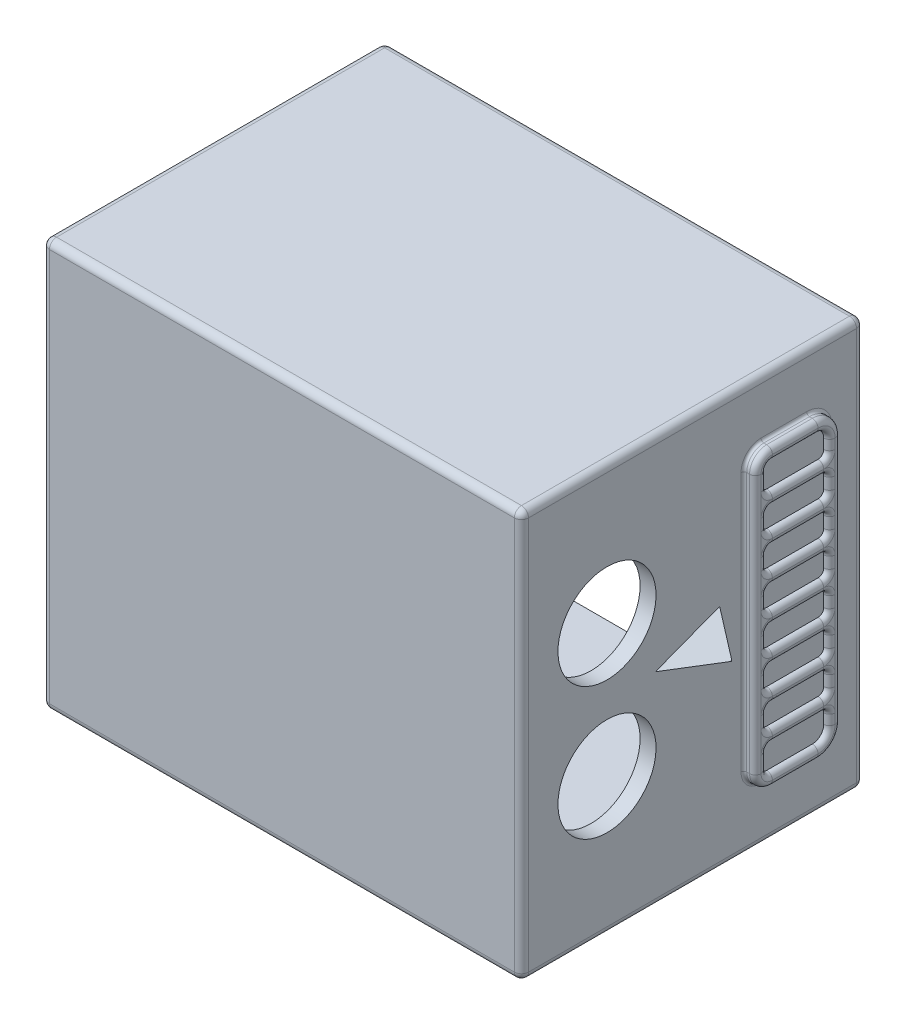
ISO-10303-21;
HEADER;
FILE_DESCRIPTION(('STEP AP214'),'2;1');
FILE_NAME('part.step','',(''),(''),'','','');
FILE_SCHEMA(('AUTOMOTIVE_DESIGN { 1 0 10303 214 1 1 1 1 }'));
ENDSEC;
DATA;
#1=APPLICATION_CONTEXT('core data for automotive mechanical design processes');
#2=APPLICATION_PROTOCOL_DEFINITION('international standard','automotive_design',2000,#1);
#3=PRODUCT_CONTEXT('',#1,'mechanical');
#4=PRODUCT('Part','Part','',(#3));
#5=PRODUCT_RELATED_PRODUCT_CATEGORY('part','',(#4));
#6=PRODUCT_DEFINITION_FORMATION('','',#4);
#7=PRODUCT_DEFINITION_CONTEXT('part definition',#1,'design');
#8=PRODUCT_DEFINITION('design','',#6,#7);
#9=PRODUCT_DEFINITION_SHAPE('','',#8);
#10=(LENGTH_UNIT() NAMED_UNIT(*) SI_UNIT(.MILLI.,.METRE.));
#11=(NAMED_UNIT(*) PLANE_ANGLE_UNIT() SI_UNIT($,.RADIAN.));
#12=(NAMED_UNIT(*) SI_UNIT($,.STERADIAN.) SOLID_ANGLE_UNIT());
#13=UNCERTAINTY_MEASURE_WITH_UNIT(LENGTH_MEASURE(1.E-05),#10,'distance_accuracy_value','');
#14=(GEOMETRIC_REPRESENTATION_CONTEXT(3) GLOBAL_UNCERTAINTY_ASSIGNED_CONTEXT((#13)) GLOBAL_UNIT_ASSIGNED_CONTEXT((#10,
#11,#12)) REPRESENTATION_CONTEXT('',''));
#15=CARTESIAN_POINT('',(0.,0.,0.));
#16=DIRECTION('',(0.,0.,1.));
#17=DIRECTION('',(1.,0.,0.));
#18=AXIS2_PLACEMENT_3D('',#15,#16,#17);
#19=CARTESIAN_POINT('',(44.,0.,0.));
#20=DIRECTION('',(1.,0.,0.));
#21=DIRECTION('',(0.,1.,0.));
#22=AXIS2_PLACEMENT_3D('',#19,#20,#21);
#23=PLANE('',#22);
#24=DIRECTION('',(0.,1.,0.));
#25=VECTOR('',#24,1.);
#26=CARTESIAN_POINT('',(44.,21.73,7.));
#27=LINE('',#26,#25);
#28=CARTESIAN_POINT('',(44.,-20.,7.));
#29=VERTEX_POINT('',#28);
#30=CARTESIAN_POINT('',(44.,-15.9999999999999,7.));
#31=VERTEX_POINT('',#30);
#32=EDGE_CURVE('E972',#29,#31,#27,.T.);
#33=ORIENTED_EDGE('',*,*,#32,.T.);
#34=CARTESIAN_POINT('',(44.,-16.,8.99999999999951));
#35=DIRECTION('',(1.,0.,0.));
#36=DIRECTION('',(0.,1.,0.));
#37=AXIS2_PLACEMENT_3D('',#34,#35,#36);
#38=CIRCLE('',#37,2.);
#39=CARTESIAN_POINT('',(44.,-17.9999999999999,9.00000000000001));
#40=VERTEX_POINT('',#39);
#41=EDGE_CURVE('E976',#31,#40,#38,.F.);
#42=ORIENTED_EDGE('',*,*,#41,.T.);
#43=CARTESIAN_POINT('',(44.,-20.,9.));
#44=DIRECTION('',(1.,0.,0.));
#45=DIRECTION('',(0.,1.,0.));
#46=AXIS2_PLACEMENT_3D('',#43,#44,#45);
#47=CIRCLE('',#46,2.00000000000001);
#48=EDGE_CURVE('E974',#40,#29,#47,.F.);
#49=ORIENTED_EDGE('',*,*,#48,.T.);
#50=EDGE_LOOP('',(#33,#42,#49));
#51=FACE_BOUND('',#50,.T.);
#52=ADVANCED_FACE('F35',(#51),#23,.T.);
#53=DIRECTION('',(0.,1.,0.));
#54=VECTOR('',#53,1.);
#55=CARTESIAN_POINT('',(44.,21.73,7.));
#56=LINE('',#55,#54);
#57=CARTESIAN_POINT('',(44.,-14.,7.));
#58=VERTEX_POINT('',#57);
#59=CARTESIAN_POINT('',(44.,-9.99999999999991,7.));
#60=VERTEX_POINT('',#59);
#61=EDGE_CURVE('E965',#58,#60,#56,.T.);
#62=ORIENTED_EDGE('',*,*,#61,.T.);
#63=CARTESIAN_POINT('',(44.,-9.99999999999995,8.99999999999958));
#64=DIRECTION('',(1.,0.,0.));
#65=DIRECTION('',(0.,1.,0.));
#66=AXIS2_PLACEMENT_3D('',#63,#64,#65);
#67=CIRCLE('',#66,2.);
#68=CARTESIAN_POINT('',(44.,-12.,8.9999999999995));
#69=VERTEX_POINT('',#68);
#70=EDGE_CURVE('E969',#60,#69,#67,.F.);
#71=ORIENTED_EDGE('',*,*,#70,.T.);
#72=CARTESIAN_POINT('',(44.,-14.,8.9999999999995));
#73=DIRECTION('',(1.,0.,0.));
#74=DIRECTION('',(0.,1.,0.));
#75=AXIS2_PLACEMENT_3D('',#72,#73,#74);
#76=CIRCLE('',#75,2.);
#77=EDGE_CURVE('E967',#69,#58,#76,.F.);
#78=ORIENTED_EDGE('',*,*,#77,.T.);
#79=EDGE_LOOP('',(#62,#71,#78));
#80=FACE_BOUND('',#79,.T.);
#81=ADVANCED_FACE('F1529',(#80),#23,.T.);
#82=DIRECTION('',(0.,1.,0.));
#83=VECTOR('',#82,1.);
#84=CARTESIAN_POINT('',(44.,21.73,7.));
#85=LINE('',#84,#83);
#86=CARTESIAN_POINT('',(44.,-7.99999999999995,7.));
#87=VERTEX_POINT('',#86);
#88=CARTESIAN_POINT('',(44.,-3.99999999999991,7.));
#89=VERTEX_POINT('',#88);
#90=EDGE_CURVE('E958',#87,#89,#85,.T.);
#91=ORIENTED_EDGE('',*,*,#90,.T.);
#92=CARTESIAN_POINT('',(44.,-3.99999999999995,8.99999999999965));
#93=DIRECTION('',(1.,0.,0.));
#94=DIRECTION('',(0.,1.,0.));
#95=AXIS2_PLACEMENT_3D('',#92,#93,#94);
#96=CIRCLE('',#95,2.);
#97=CARTESIAN_POINT('',(44.,-5.99999999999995,8.99999999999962));
#98=VERTEX_POINT('',#97);
#99=EDGE_CURVE('E962',#89,#98,#96,.F.);
#100=ORIENTED_EDGE('',*,*,#99,.T.);
#101=CARTESIAN_POINT('',(44.,-7.99999999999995,8.99999999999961));
#102=DIRECTION('',(1.,0.,0.));
#103=DIRECTION('',(0.,1.,0.));
#104=AXIS2_PLACEMENT_3D('',#101,#102,#103);
#105=CIRCLE('',#104,2.);
#106=EDGE_CURVE('E960',#98,#87,#105,.F.);
#107=ORIENTED_EDGE('',*,*,#106,.T.);
#108=EDGE_LOOP('',(#91,#100,#107));
#109=FACE_BOUND('',#108,.T.);
#110=ADVANCED_FACE('F1537',(#109),#23,.T.);
#111=DIRECTION('',(0.,1.,0.));
#112=VECTOR('',#111,1.);
#113=CARTESIAN_POINT('',(44.,21.73,7.));
#114=LINE('',#113,#112);
#115=CARTESIAN_POINT('',(44.,-1.99999999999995,7.));
#116=VERTEX_POINT('',#115);
#117=CARTESIAN_POINT('',(44.,2.00000000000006,7.));
#118=VERTEX_POINT('',#117);
#119=EDGE_CURVE('E953',#116,#118,#114,.T.);
#120=ORIENTED_EDGE('',*,*,#119,.T.);
#121=CARTESIAN_POINT('',(44.,2.00000000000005,8.9999999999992));
#122=DIRECTION('',(1.,0.,0.));
#123=DIRECTION('',(0.,1.,0.));
#124=AXIS2_PLACEMENT_3D('',#121,#122,#123);
#125=CIRCLE('',#124,2.);
#126=CARTESIAN_POINT('',(44.,0.,8.99999999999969));
#127=VERTEX_POINT('',#126);
#128=EDGE_CURVE('E620',#118,#127,#125,.F.);
#129=ORIENTED_EDGE('',*,*,#128,.T.);
#130=CARTESIAN_POINT('',(44.,-1.99999999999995,8.99999999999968));
#131=DIRECTION('',(1.,0.,0.));
#132=DIRECTION('',(0.,1.,0.));
#133=AXIS2_PLACEMENT_3D('',#130,#131,#132);
#134=CIRCLE('',#133,2.);
#135=EDGE_CURVE('E955',#127,#116,#134,.F.);
#136=ORIENTED_EDGE('',*,*,#135,.T.);
#137=EDGE_LOOP('',(#120,#129,#136));
#138=FACE_BOUND('',#137,.T.);
#139=ADVANCED_FACE('F2803',(#138),#23,.T.);
#140=DIRECTION('',(0.,1.,0.));
#141=VECTOR('',#140,1.);
#142=CARTESIAN_POINT('',(44.,21.73,7.));
#143=LINE('',#142,#141);
#144=CARTESIAN_POINT('',(44.,4.,7.));
#145=VERTEX_POINT('',#144);
#146=CARTESIAN_POINT('',(44.,8.00000000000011,7.));
#147=VERTEX_POINT('',#146);
#148=EDGE_CURVE('E946',#145,#147,#143,.T.);
#149=ORIENTED_EDGE('',*,*,#148,.T.);
#150=CARTESIAN_POINT('',(44.,8.,8.99999999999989));
#151=DIRECTION('',(1.,0.,0.));
#152=DIRECTION('',(0.,1.,0.));
#153=AXIS2_PLACEMENT_3D('',#150,#151,#152);
#154=CIRCLE('',#153,2.);
#155=CARTESIAN_POINT('',(44.,6.,8.9999999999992));
#156=VERTEX_POINT('',#155);
#157=EDGE_CURVE('E950',#147,#156,#154,.F.);
#158=ORIENTED_EDGE('',*,*,#157,.T.);
#159=CARTESIAN_POINT('',(44.,4.,8.9999999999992));
#160=DIRECTION('',(1.,0.,0.));
#161=DIRECTION('',(0.,1.,0.));
#162=AXIS2_PLACEMENT_3D('',#159,#160,#161);
#163=CIRCLE('',#162,2.);
#164=EDGE_CURVE('E948',#156,#145,#163,.F.);
#165=ORIENTED_EDGE('',*,*,#164,.T.);
#166=EDGE_LOOP('',(#149,#158,#165));
#167=FACE_BOUND('',#166,.T.);
#168=ADVANCED_FACE('F2810',(#167),#23,.T.);
#169=DIRECTION('',(0.,1.,0.));
#170=VECTOR('',#169,1.);
#171=CARTESIAN_POINT('',(44.,21.73,7.));
#172=LINE('',#171,#170);
#173=CARTESIAN_POINT('',(44.,10.,7.));
#174=VERTEX_POINT('',#173);
#175=CARTESIAN_POINT('',(44.,14.,7.));
#176=VERTEX_POINT('',#175);
#177=EDGE_CURVE('E939',#174,#176,#172,.T.);
#178=ORIENTED_EDGE('',*,*,#177,.T.);
#179=CARTESIAN_POINT('',(44.,14.,9.00000000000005));
#180=DIRECTION('',(1.,0.,0.));
#181=DIRECTION('',(0.,1.,0.));
#182=AXIS2_PLACEMENT_3D('',#179,#180,#181);
#183=CIRCLE('',#182,2.);
#184=CARTESIAN_POINT('',(44.,12.,9.));
#185=VERTEX_POINT('',#184);
#186=EDGE_CURVE('E943',#176,#185,#183,.F.);
#187=ORIENTED_EDGE('',*,*,#186,.T.);
#188=CARTESIAN_POINT('',(44.,10.,8.99999999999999));
#189=DIRECTION('',(1.,0.,0.));
#190=DIRECTION('',(0.,1.,0.));
#191=AXIS2_PLACEMENT_3D('',#188,#189,#190);
#192=CIRCLE('',#191,2.);
#193=EDGE_CURVE('E941',#185,#174,#192,.F.);
#194=ORIENTED_EDGE('',*,*,#193,.T.);
#195=EDGE_LOOP('',(#178,#187,#194));
#196=FACE_BOUND('',#195,.T.);
#197=ADVANCED_FACE('F2818',(#196),#23,.T.);
#198=DIRECTION('',(0.,1.,0.));
#199=VECTOR('',#198,1.);
#200=CARTESIAN_POINT('',(44.,21.73,7.));
#201=LINE('',#200,#199);
#202=CARTESIAN_POINT('',(44.,16.,7.));
#203=VERTEX_POINT('',#202);
#204=CARTESIAN_POINT('',(44.,20.0000000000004,7.));
#205=VERTEX_POINT('',#204);
#206=EDGE_CURVE('E932',#203,#205,#201,.T.);
#207=ORIENTED_EDGE('',*,*,#206,.T.);
#208=CARTESIAN_POINT('',(44.,20.,8.99999999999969));
#209=DIRECTION('',(1.,0.,0.));
#210=DIRECTION('',(0.,1.,0.));
#211=AXIS2_PLACEMENT_3D('',#208,#209,#210);
#212=CIRCLE('',#211,2.);
#213=CARTESIAN_POINT('',(44.,18.,9.00000000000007));
#214=VERTEX_POINT('',#213);
#215=EDGE_CURVE('E936',#205,#214,#212,.F.);
#216=ORIENTED_EDGE('',*,*,#215,.T.);
#217=CARTESIAN_POINT('',(44.,16.,9.00000000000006));
#218=DIRECTION('',(1.,0.,0.));
#219=DIRECTION('',(0.,1.,0.));
#220=AXIS2_PLACEMENT_3D('',#217,#218,#219);
#221=CIRCLE('',#220,2.);
#222=EDGE_CURVE('E934',#214,#203,#221,.F.);
#223=ORIENTED_EDGE('',*,*,#222,.T.);
#224=EDGE_LOOP('',(#207,#216,#223));
#225=FACE_BOUND('',#224,.T.);
#226=ADVANCED_FACE('F1919',(#225),#23,.T.);
#227=CARTESIAN_POINT('',(44.,16.,18.0000000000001));
#228=DIRECTION('',(1.,0.,0.));
#229=DIRECTION('',(0.,1.,0.));
#230=AXIS2_PLACEMENT_3D('',#227,#228,#229);
#231=CIRCLE('',#230,2.);
#232=CARTESIAN_POINT('',(44.,16.,20.));
#233=VERTEX_POINT('',#232);
#234=CARTESIAN_POINT('',(44.,18.,18.));
#235=VERTEX_POINT('',#234);
#236=EDGE_CURVE('E927',#233,#235,#231,.F.);
#237=ORIENTED_EDGE('',*,*,#236,.T.);
#238=CARTESIAN_POINT('',(44.,20.,18.));
#239=DIRECTION('',(1.,0.,0.));
#240=DIRECTION('',(0.,1.,0.));
#241=AXIS2_PLACEMENT_3D('',#238,#239,#240);
#242=CIRCLE('',#241,2.);
#243=CARTESIAN_POINT('',(44.,20.,20.));
#244=VERTEX_POINT('',#243);
#245=EDGE_CURVE('E929',#235,#244,#242,.F.);
#246=ORIENTED_EDGE('',*,*,#245,.T.);
#247=DIRECTION('',(0.,1.,0.));
#248=VECTOR('',#247,1.);
#249=CARTESIAN_POINT('',(44.,0.,20.));
#250=LINE('',#249,#248);
#251=EDGE_CURVE('E925',#244,#233,#250,.F.);
#252=ORIENTED_EDGE('',*,*,#251,.T.);
#253=EDGE_LOOP('',(#237,#246,#252));
#254=FACE_BOUND('',#253,.T.);
#255=ADVANCED_FACE('F1703',(#254),#23,.T.);
#256=CARTESIAN_POINT('',(44.,10.,18.));
#257=DIRECTION('',(1.,0.,0.));
#258=DIRECTION('',(0.,1.,0.));
#259=AXIS2_PLACEMENT_3D('',#256,#257,#258);
#260=CIRCLE('',#259,2.);
#261=CARTESIAN_POINT('',(44.,10.,20.));
#262=VERTEX_POINT('',#261);
#263=CARTESIAN_POINT('',(44.,12.,18.));
#264=VERTEX_POINT('',#263);
#265=EDGE_CURVE('E920',#262,#264,#260,.F.);
#266=ORIENTED_EDGE('',*,*,#265,.T.);
#267=CARTESIAN_POINT('',(44.,14.,18.));
#268=DIRECTION('',(1.,0.,0.));
#269=DIRECTION('',(0.,1.,0.));
#270=AXIS2_PLACEMENT_3D('',#267,#268,#269);
#271=CIRCLE('',#270,2.);
#272=CARTESIAN_POINT('',(44.,14.,20.));
#273=VERTEX_POINT('',#272);
#274=EDGE_CURVE('E922',#264,#273,#271,.F.);
#275=ORIENTED_EDGE('',*,*,#274,.T.);
#276=DIRECTION('',(0.,1.,0.));
#277=VECTOR('',#276,1.);
#278=CARTESIAN_POINT('',(44.,0.,20.));
#279=LINE('',#278,#277);
#280=EDGE_CURVE('E918',#273,#262,#279,.F.);
#281=ORIENTED_EDGE('',*,*,#280,.T.);
#282=EDGE_LOOP('',(#266,#275,#281));
#283=FACE_BOUND('',#282,.T.);
#284=ADVANCED_FACE('F1698',(#283),#23,.T.);
#285=CARTESIAN_POINT('',(44.,4.,17.9999999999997));
#286=DIRECTION('',(1.,0.,0.));
#287=DIRECTION('',(0.,1.,0.));
#288=AXIS2_PLACEMENT_3D('',#285,#286,#287);
#289=CIRCLE('',#288,2.);
#290=CARTESIAN_POINT('',(44.,4.,20.));
#291=VERTEX_POINT('',#290);
#292=CARTESIAN_POINT('',(44.,6.,17.9999999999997));
#293=VERTEX_POINT('',#292);
#294=EDGE_CURVE('E913',#291,#293,#289,.F.);
#295=ORIENTED_EDGE('',*,*,#294,.T.);
#296=CARTESIAN_POINT('',(44.,8.,18.));
#297=DIRECTION('',(1.,0.,0.));
#298=DIRECTION('',(0.,1.,0.));
#299=AXIS2_PLACEMENT_3D('',#296,#297,#298);
#300=CIRCLE('',#299,2.);
#301=CARTESIAN_POINT('',(44.,8.,20.));
#302=VERTEX_POINT('',#301);
#303=EDGE_CURVE('E915',#293,#302,#300,.F.);
#304=ORIENTED_EDGE('',*,*,#303,.T.);
#305=DIRECTION('',(0.,1.,0.));
#306=VECTOR('',#305,1.);
#307=CARTESIAN_POINT('',(44.,0.,20.));
#308=LINE('',#307,#306);
#309=EDGE_CURVE('E911',#302,#291,#308,.F.);
#310=ORIENTED_EDGE('',*,*,#309,.T.);
#311=EDGE_LOOP('',(#295,#304,#310));
#312=FACE_BOUND('',#311,.T.);
#313=ADVANCED_FACE('F1694',(#312),#23,.T.);
#314=CARTESIAN_POINT('',(44.,-1.99999999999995,18.0000000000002));
#315=DIRECTION('',(1.,0.,0.));
#316=DIRECTION('',(0.,1.,0.));
#317=AXIS2_PLACEMENT_3D('',#314,#315,#316);
#318=CIRCLE('',#317,2.);
#319=CARTESIAN_POINT('',(44.,-1.99999999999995,20.));
#320=VERTEX_POINT('',#319);
#321=CARTESIAN_POINT('',(44.,0.,18.0000000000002));
#322=VERTEX_POINT('',#321);
#323=EDGE_CURVE('E906',#320,#322,#318,.F.);
#324=ORIENTED_EDGE('',*,*,#323,.T.);
#325=CARTESIAN_POINT('',(44.,2.00000000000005,17.9999999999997));
#326=DIRECTION('',(1.,0.,0.));
#327=DIRECTION('',(0.,1.,0.));
#328=AXIS2_PLACEMENT_3D('',#325,#326,#327);
#329=CIRCLE('',#328,2.);
#330=CARTESIAN_POINT('',(44.,2.00000000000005,20.));
#331=VERTEX_POINT('',#330);
#332=EDGE_CURVE('E908',#322,#331,#329,.F.);
#333=ORIENTED_EDGE('',*,*,#332,.T.);
#334=DIRECTION('',(0.,1.,0.));
#335=VECTOR('',#334,1.);
#336=CARTESIAN_POINT('',(44.,0.,20.));
#337=LINE('',#336,#335);
#338=EDGE_CURVE('E904',#331,#320,#337,.F.);
#339=ORIENTED_EDGE('',*,*,#338,.T.);
#340=EDGE_LOOP('',(#324,#333,#339));
#341=FACE_BOUND('',#340,.T.);
#342=ADVANCED_FACE('F1564',(#341),#23,.T.);
#343=CARTESIAN_POINT('',(44.,-7.99999999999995,18.0000000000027));
#344=DIRECTION('',(1.,0.,0.));
#345=DIRECTION('',(0.,1.,0.));
#346=AXIS2_PLACEMENT_3D('',#343,#344,#345);
#347=CIRCLE('',#346,2.);
#348=CARTESIAN_POINT('',(44.,-7.99999999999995,20.));
#349=VERTEX_POINT('',#348);
#350=CARTESIAN_POINT('',(44.,-5.99999999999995,18.0000000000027));
#351=VERTEX_POINT('',#350);
#352=EDGE_CURVE('E899',#349,#351,#347,.F.);
#353=ORIENTED_EDGE('',*,*,#352,.T.);
#354=CARTESIAN_POINT('',(44.,-3.99999999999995,18.0000000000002));
#355=DIRECTION('',(1.,0.,0.));
#356=DIRECTION('',(0.,1.,0.));
#357=AXIS2_PLACEMENT_3D('',#354,#355,#356);
#358=CIRCLE('',#357,2.);
#359=CARTESIAN_POINT('',(44.,-3.99999999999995,20.));
#360=VERTEX_POINT('',#359);
#361=EDGE_CURVE('E901',#351,#360,#358,.F.);
#362=ORIENTED_EDGE('',*,*,#361,.T.);
#363=DIRECTION('',(0.,1.,0.));
#364=VECTOR('',#363,1.);
#365=CARTESIAN_POINT('',(44.,0.,20.));
#366=LINE('',#365,#364);
#367=EDGE_CURVE('E897',#360,#349,#366,.F.);
#368=ORIENTED_EDGE('',*,*,#367,.T.);
#369=EDGE_LOOP('',(#353,#362,#368));
#370=FACE_BOUND('',#369,.T.);
#371=ADVANCED_FACE('F1555',(#370),#23,.T.);
#372=CARTESIAN_POINT('',(44.,-14.,18.0000000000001));
#373=DIRECTION('',(1.,0.,0.));
#374=DIRECTION('',(0.,1.,0.));
#375=AXIS2_PLACEMENT_3D('',#372,#373,#374);
#376=CIRCLE('',#375,2.);
#377=CARTESIAN_POINT('',(44.,-14.,20.));
#378=VERTEX_POINT('',#377);
#379=CARTESIAN_POINT('',(44.,-12.,18.0000000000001));
#380=VERTEX_POINT('',#379);
#381=EDGE_CURVE('E892',#378,#380,#376,.F.);
#382=ORIENTED_EDGE('',*,*,#381,.T.);
#383=CARTESIAN_POINT('',(44.,-9.99999999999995,18.0000000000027));
#384=DIRECTION('',(1.,0.,0.));
#385=DIRECTION('',(0.,1.,0.));
#386=AXIS2_PLACEMENT_3D('',#383,#384,#385);
#387=CIRCLE('',#386,2.);
#388=CARTESIAN_POINT('',(44.,-9.99999999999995,20.));
#389=VERTEX_POINT('',#388);
#390=EDGE_CURVE('E894',#380,#389,#387,.F.);
#391=ORIENTED_EDGE('',*,*,#390,.T.);
#392=DIRECTION('',(0.,1.,0.));
#393=VECTOR('',#392,1.);
#394=CARTESIAN_POINT('',(44.,0.,20.));
#395=LINE('',#394,#393);
#396=EDGE_CURVE('E890',#389,#378,#395,.F.);
#397=ORIENTED_EDGE('',*,*,#396,.T.);
#398=EDGE_LOOP('',(#382,#391,#397));
#399=FACE_BOUND('',#398,.T.);
#400=ADVANCED_FACE('F1545',(#399),#23,.T.);
#401=CARTESIAN_POINT('',(42.,35.73,60.));
#402=DIRECTION('',(-1.,0.,0.));
#403=DIRECTION('',(0.,-1.,0.));
#404=AXIS2_PLACEMENT_3D('',#401,#402,#403);
#405=PLANE('',#404);
#406=DIRECTION('',(0.,1.,0.));
#407=VECTOR('',#406,1.);
#408=CARTESIAN_POINT('',(42.,-35.73,58.75));
#409=LINE('',#408,#407);
#410=CARTESIAN_POINT('',(42.,34.48,58.75));
#411=VERTEX_POINT('',#410);
#412=CARTESIAN_POINT('',(42.,-34.48,58.75));
#413=VERTEX_POINT('',#412);
#414=EDGE_CURVE('E1366',#411,#413,#409,.F.);
#415=ORIENTED_EDGE('',*,*,#414,.T.);
#416=DIRECTION('',(0.,0.,-1.));
#417=VECTOR('',#416,1.);
#418=CARTESIAN_POINT('',(42.,-34.48,60.));
#419=LINE('',#418,#417);
#420=CARTESIAN_POINT('',(42.,-34.48,1.25));
#421=VERTEX_POINT('',#420);
#422=EDGE_CURVE('E1368',#413,#421,#419,.T.);
#423=ORIENTED_EDGE('',*,*,#422,.T.);
#424=DIRECTION('',(0.,1.,0.));
#425=VECTOR('',#424,1.);
#426=CARTESIAN_POINT('',(42.,35.73,1.25));
#427=LINE('',#426,#425);
#428=CARTESIAN_POINT('',(42.,34.48,1.25));
#429=VERTEX_POINT('',#428);
#430=EDGE_CURVE('E1362',#421,#429,#427,.T.);
#431=ORIENTED_EDGE('',*,*,#430,.T.);
#432=DIRECTION('',(0.,0.,-1.));
#433=VECTOR('',#432,1.);
#434=CARTESIAN_POINT('',(42.,34.48,60.));
#435=LINE('',#434,#433);
#436=EDGE_CURVE('E1364',#429,#411,#435,.F.);
#437=ORIENTED_EDGE('',*,*,#436,.T.);
#438=EDGE_LOOP('',(#415,#423,#431,#437));
#439=FACE_BOUND('',#438,.T.);
#440=DIRECTION('',(0.,0.,-1.));
#441=VECTOR('',#440,1.);
#442=CARTESIAN_POINT('',(42.,-26.23,18.));
#443=LINE('',#442,#441);
#444=CARTESIAN_POINT('',(42.,-26.23,10.));
#445=VERTEX_POINT('',#444);
#446=CARTESIAN_POINT('',(42.,-26.23,18.));
#447=VERTEX_POINT('',#446);
#448=EDGE_CURVE('E1295',#445,#447,#443,.F.);
#449=ORIENTED_EDGE('',*,*,#448,.T.);
#450=CARTESIAN_POINT('',(42.,-22.73,18.));
#451=DIRECTION('',(-1.,0.,0.));
#452=DIRECTION('',(0.,-1.,0.));
#453=AXIS2_PLACEMENT_3D('',#450,#451,#452);
#454=CIRCLE('',#453,3.5);
#455=CARTESIAN_POINT('',(42.,-22.73,21.5));
#456=VERTEX_POINT('',#455);
#457=EDGE_CURVE('E1297',#447,#456,#454,.T.);
#458=ORIENTED_EDGE('',*,*,#457,.T.);
#459=DIRECTION('',(0.,1.,0.));
#460=VECTOR('',#459,1.);
#461=CARTESIAN_POINT('',(42.,35.73,21.5));
#462=LINE('',#461,#460);
#463=CARTESIAN_POINT('',(42.,22.73,21.5));
#464=VERTEX_POINT('',#463);
#465=EDGE_CURVE('E1283',#456,#464,#462,.T.);
#466=ORIENTED_EDGE('',*,*,#465,.T.);
#467=CARTESIAN_POINT('',(42.,22.73,18.));
#468=DIRECTION('',(-1.,0.,0.));
#469=DIRECTION('',(0.,-1.,0.));
#470=AXIS2_PLACEMENT_3D('',#467,#468,#469);
#471=CIRCLE('',#470,3.5);
#472=CARTESIAN_POINT('',(42.,26.23,18.));
#473=VERTEX_POINT('',#472);
#474=EDGE_CURVE('E1285',#464,#473,#471,.T.);
#475=ORIENTED_EDGE('',*,*,#474,.T.);
#476=DIRECTION('',(0.,0.,-1.));
#477=VECTOR('',#476,1.);
#478=CARTESIAN_POINT('',(42.,26.23,60.));
#479=LINE('',#478,#477);
#480=CARTESIAN_POINT('',(42.,26.23,10.));
#481=VERTEX_POINT('',#480);
#482=EDGE_CURVE('E1287',#473,#481,#479,.T.);
#483=ORIENTED_EDGE('',*,*,#482,.T.);
#484=CARTESIAN_POINT('',(42.,21.73,10.));
#485=DIRECTION('',(-1.,0.,0.));
#486=DIRECTION('',(0.,-1.,0.));
#487=AXIS2_PLACEMENT_3D('',#484,#485,#486);
#488=CIRCLE('',#487,4.5);
#489=CARTESIAN_POINT('',(42.,21.73,5.5));
#490=VERTEX_POINT('',#489);
#491=EDGE_CURVE('E1289',#481,#490,#488,.T.);
#492=ORIENTED_EDGE('',*,*,#491,.T.);
#493=DIRECTION('',(0.,1.,0.));
#494=VECTOR('',#493,1.);
#495=CARTESIAN_POINT('',(42.,-21.73,5.5));
#496=LINE('',#495,#494);
#497=CARTESIAN_POINT('',(42.,-21.73,5.5));
#498=VERTEX_POINT('',#497);
#499=EDGE_CURVE('E1291',#490,#498,#496,.F.);
#500=ORIENTED_EDGE('',*,*,#499,.T.);
#501=CARTESIAN_POINT('',(42.,-21.73,10.));
#502=DIRECTION('',(-1.,0.,0.));
#503=DIRECTION('',(0.,-1.,0.));
#504=AXIS2_PLACEMENT_3D('',#501,#502,#503);
#505=CIRCLE('',#504,4.5);
#506=EDGE_CURVE('E1293',#498,#445,#505,.T.);
#507=ORIENTED_EDGE('',*,*,#506,.T.);
#508=EDGE_LOOP('',(#449,#458,#466,#475,#483,#492,#500,#507));
#509=FACE_BOUND('',#508,.T.);
#510=CARTESIAN_POINT('',(42.,11.6,45.));
#511=DIRECTION('',(1.,0.,0.));
#512=DIRECTION('',(0.,1.,0.));
#513=AXIS2_PLACEMENT_3D('',#510,#511,#512);
#514=CIRCLE('',#513,8.6);
#515=CARTESIAN_POINT('',(42.,20.2,45.));
#516=VERTEX_POINT('',#515);
#517=EDGE_CURVE('E843',#516,#516,#514,.T.);
#518=ORIENTED_EDGE('',*,*,#517,.F.);
#519=EDGE_LOOP('',(#518));
#520=FACE_BOUND('',#519,.T.);
#521=CARTESIAN_POINT('',(42.,-11.6,45.));
#522=DIRECTION('',(1.,0.,0.));
#523=DIRECTION('',(0.,1.,0.));
#524=AXIS2_PLACEMENT_3D('',#521,#522,#523);
#525=CIRCLE('',#524,8.6);
#526=CARTESIAN_POINT('',(42.,-3.00000000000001,45.));
#527=VERTEX_POINT('',#526);
#528=EDGE_CURVE('E846',#527,#527,#525,.T.);
#529=ORIENTED_EDGE('',*,*,#528,.F.);
#530=EDGE_LOOP('',(#529));
#531=FACE_BOUND('',#530,.T.);
#532=DIRECTION('',(0.,1.,0.));
#533=VECTOR('',#532,1.);
#534=CARTESIAN_POINT('',(42.,0.,25.25));
#535=LINE('',#534,#533);
#536=CARTESIAN_POINT('',(42.,-4.29999999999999,25.25));
#537=VERTEX_POINT('',#536);
#538=CARTESIAN_POINT('',(42.,4.30000000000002,25.25));
#539=VERTEX_POINT('',#538);
#540=EDGE_CURVE('E787',#537,#539,#535,.T.);
#541=ORIENTED_EDGE('',*,*,#540,.F.);
#542=DIRECTION('',(0.,-0.357030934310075,-0.934092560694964));
#543=VECTOR('',#542,1.);
#544=CARTESIAN_POINT('',(42.,-12.172747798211,4.65269471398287));
#545=LINE('',#544,#543);
#546=CARTESIAN_POINT('',(42.,0.,36.5));
#547=VERTEX_POINT('',#546);
#548=EDGE_CURVE('E793',#547,#537,#545,.T.);
#549=ORIENTED_EDGE('',*,*,#548,.F.);
#550=DIRECTION('',(0.,-0.357030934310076,0.934092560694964));
#551=VECTOR('',#550,1.);
#552=CARTESIAN_POINT('',(42.,12.172747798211,4.65269471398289));
#553=LINE('',#552,#551);
#554=EDGE_CURVE('E790',#539,#547,#553,.T.);
#555=ORIENTED_EDGE('',*,*,#554,.F.);
#556=EDGE_LOOP('',(#541,#549,#555));
#557=FACE_BOUND('',#556,.T.);
#558=ADVANCED_FACE('F1510',(#439,#509,#520,#531,#557),#405,.F.);
#559=CARTESIAN_POINT('',(-42.,32.93,60.));
#560=DIRECTION('',(0.,-1.,0.));
#561=DIRECTION('',(0.,0.,-1.));
#562=AXIS2_PLACEMENT_3D('',#559,#560,#561);
#563=PLANE('',#562);
#564=DIRECTION('',(-1.,0.,0.));
#565=VECTOR('',#564,1.);
#566=CARTESIAN_POINT('',(0.,32.93,2.75));
#567=LINE('',#566,#565);
#568=CARTESIAN_POINT('',(-30.1,32.93,2.75));
#569=VERTEX_POINT('',#568);
#570=CARTESIAN_POINT('',(-39.2,32.93,2.75));
#571=VERTEX_POINT('',#570);
#572=EDGE_CURVE('E819',#569,#571,#567,.T.);
#573=ORIENTED_EDGE('',*,*,#572,.F.);
#574=DIRECTION('',(0.,0.,-1.));
#575=VECTOR('',#574,1.);
#576=CARTESIAN_POINT('',(-30.1,32.93,2.75));
#577=LINE('',#576,#575);
#578=CARTESIAN_POINT('',(-30.1,32.93,0.));
#579=VERTEX_POINT('',#578);
#580=EDGE_CURVE('E823',#569,#579,#577,.T.);
#581=ORIENTED_EDGE('',*,*,#580,.T.);
#582=DIRECTION('',(-1.,0.,0.));
#583=VECTOR('',#582,1.);
#584=CARTESIAN_POINT('',(-42.,32.93,0.));
#585=LINE('',#584,#583);
#586=CARTESIAN_POINT('',(30.1,32.93,0.));
#587=VERTEX_POINT('',#586);
#588=EDGE_CURVE('E876',#587,#579,#585,.T.);
#589=ORIENTED_EDGE('',*,*,#588,.F.);
#590=DIRECTION('',(0.,0.,-1.));
#591=VECTOR('',#590,1.);
#592=CARTESIAN_POINT('',(30.1,32.93,2.75));
#593=LINE('',#592,#591);
#594=CARTESIAN_POINT('',(30.1,32.93,2.75));
#595=VERTEX_POINT('',#594);
#596=EDGE_CURVE('E841',#595,#587,#593,.T.);
#597=ORIENTED_EDGE('',*,*,#596,.F.);
#598=DIRECTION('',(-1.,0.,0.));
#599=VECTOR('',#598,1.);
#600=CARTESIAN_POINT('',(0.,32.93,2.75));
#601=LINE('',#600,#599);
#602=CARTESIAN_POINT('',(39.2,32.93,2.75));
#603=VERTEX_POINT('',#602);
#604=EDGE_CURVE('E834',#603,#595,#601,.T.);
#605=ORIENTED_EDGE('',*,*,#604,.F.);
#606=DIRECTION('',(0.,0.,-1.));
#607=VECTOR('',#606,1.);
#608=CARTESIAN_POINT('',(39.2,32.93,60.));
#609=LINE('',#608,#607);
#610=CARTESIAN_POINT('',(39.2,32.93,57.2));
#611=VERTEX_POINT('',#610);
#612=EDGE_CURVE('E852',#611,#603,#609,.T.);
#613=ORIENTED_EDGE('',*,*,#612,.F.);
#614=DIRECTION('',(-1.,0.,0.));
#615=VECTOR('',#614,1.);
#616=CARTESIAN_POINT('',(-42.,32.93,57.2));
#617=LINE('',#616,#615);
#618=CARTESIAN_POINT('',(-39.2,32.93,57.2));
#619=VERTEX_POINT('',#618);
#620=EDGE_CURVE('E860',#611,#619,#617,.T.);
#621=ORIENTED_EDGE('',*,*,#620,.T.);
#622=DIRECTION('',(0.,0.,-1.));
#623=VECTOR('',#622,1.);
#624=CARTESIAN_POINT('',(-39.2,32.93,60.));
#625=LINE('',#624,#623);
#626=EDGE_CURVE('E856',#619,#571,#625,.T.);
#627=ORIENTED_EDGE('',*,*,#626,.T.);
#628=EDGE_LOOP('',(#573,#581,#589,#597,#605,#613,#621,#627));
#629=FACE_BOUND('',#628,.T.);
#630=ADVANCED_FACE('F1562',(#629),#563,.T.);
#631=CARTESIAN_POINT('',(-39.2,35.73,60.));
#632=DIRECTION('',(1.,0.,0.));
#633=DIRECTION('',(0.,1.,0.));
#634=AXIS2_PLACEMENT_3D('',#631,#632,#633);
#635=PLANE('',#634);
#636=DIRECTION('',(0.,0.,-1.));
#637=VECTOR('',#636,1.);
#638=CARTESIAN_POINT('',(-39.2,-32.93,60.));
#639=LINE('',#638,#637);
#640=CARTESIAN_POINT('',(-39.2,-32.93,57.2));
#641=VERTEX_POINT('',#640);
#642=CARTESIAN_POINT('',(-39.2,-32.93,2.75));
#643=VERTEX_POINT('',#642);
#644=EDGE_CURVE('E865',#641,#643,#639,.T.);
#645=ORIENTED_EDGE('',*,*,#644,.T.);
#646=DIRECTION('',(0.,-1.,0.));
#647=VECTOR('',#646,1.);
#648=CARTESIAN_POINT('',(-39.2,0.,2.75));
#649=LINE('',#648,#647);
#650=EDGE_CURVE('E817',#571,#643,#649,.T.);
#651=ORIENTED_EDGE('',*,*,#650,.F.);
#652=ORIENTED_EDGE('',*,*,#626,.F.);
#653=DIRECTION('',(0.,-1.,0.));
#654=VECTOR('',#653,1.);
#655=CARTESIAN_POINT('',(-39.2,35.73,57.2));
#656=LINE('',#655,#654);
#657=EDGE_CURVE('E870',#619,#641,#656,.T.);
#658=ORIENTED_EDGE('',*,*,#657,.T.);
#659=EDGE_LOOP('',(#645,#651,#652,#658));
#660=FACE_BOUND('',#659,.T.);
#661=ADVANCED_FACE('F2188',(#660),#635,.T.);
#662=CARTESIAN_POINT('',(-42.,-32.93,60.));
#663=DIRECTION('',(0.,1.,0.));
#664=DIRECTION('',(0.,0.,1.));
#665=AXIS2_PLACEMENT_3D('',#662,#663,#664);
#666=PLANE('',#665);
#667=DIRECTION('',(1.,0.,0.));
#668=VECTOR('',#667,1.);
#669=CARTESIAN_POINT('',(-42.,-32.93,0.));
#670=LINE('',#669,#668);
#671=CARTESIAN_POINT('',(-30.1,-32.93,0.));
#672=VERTEX_POINT('',#671);
#673=CARTESIAN_POINT('',(30.1,-32.93,0.));
#674=VERTEX_POINT('',#673);
#675=EDGE_CURVE('E861',#672,#674,#670,.T.);
#676=ORIENTED_EDGE('',*,*,#675,.F.);
#677=DIRECTION('',(0.,0.,-1.));
#678=VECTOR('',#677,1.);
#679=CARTESIAN_POINT('',(-30.1,-32.93,2.75));
#680=LINE('',#679,#678);
#681=CARTESIAN_POINT('',(-30.1,-32.93,2.75));
#682=VERTEX_POINT('',#681);
#683=EDGE_CURVE('E821',#682,#672,#680,.T.);
#684=ORIENTED_EDGE('',*,*,#683,.F.);
#685=DIRECTION('',(1.,0.,0.));
#686=VECTOR('',#685,1.);
#687=CARTESIAN_POINT('',(0.,-32.93,2.75));
#688=LINE('',#687,#686);
#689=EDGE_CURVE('E815',#643,#682,#688,.T.);
#690=ORIENTED_EDGE('',*,*,#689,.F.);
#691=ORIENTED_EDGE('',*,*,#644,.F.);
#692=DIRECTION('',(1.,0.,0.));
#693=VECTOR('',#692,1.);
#694=CARTESIAN_POINT('',(-42.,-32.93,57.2));
#695=LINE('',#694,#693);
#696=CARTESIAN_POINT('',(39.2,-32.93,57.2));
#697=VERTEX_POINT('',#696);
#698=EDGE_CURVE('E866',#641,#697,#695,.T.);
#699=ORIENTED_EDGE('',*,*,#698,.T.);
#700=DIRECTION('',(0.,0.,-1.));
#701=VECTOR('',#700,1.);
#702=CARTESIAN_POINT('',(39.2,-32.93,60.));
#703=LINE('',#702,#701);
#704=CARTESIAN_POINT('',(39.2,-32.93,2.75));
#705=VERTEX_POINT('',#704);
#706=EDGE_CURVE('E862',#697,#705,#703,.T.);
#707=ORIENTED_EDGE('',*,*,#706,.T.);
#708=DIRECTION('',(1.,0.,0.));
#709=VECTOR('',#708,1.);
#710=CARTESIAN_POINT('',(0.,-32.93,2.75));
#711=LINE('',#710,#709);
#712=CARTESIAN_POINT('',(30.1,-32.93,2.75));
#713=VERTEX_POINT('',#712);
#714=EDGE_CURVE('E829',#713,#705,#711,.T.);
#715=ORIENTED_EDGE('',*,*,#714,.F.);
#716=DIRECTION('',(0.,0.,-1.));
#717=VECTOR('',#716,1.);
#718=CARTESIAN_POINT('',(30.1,-32.93,2.75));
#719=LINE('',#718,#717);
#720=EDGE_CURVE('E838',#713,#674,#719,.T.);
#721=ORIENTED_EDGE('',*,*,#720,.T.);
#722=EDGE_LOOP('',(#676,#684,#690,#691,#699,#707,#715,#721));
#723=FACE_BOUND('',#722,.T.);
#724=ADVANCED_FACE('F2170',(#723),#666,.T.);
#725=CARTESIAN_POINT('',(39.2,35.73,60.));
#726=DIRECTION('',(-1.,0.,0.));
#727=DIRECTION('',(0.,-1.,0.));
#728=AXIS2_PLACEMENT_3D('',#725,#726,#727);
#729=PLANE('',#728);
#730=CARTESIAN_POINT('',(39.2,-11.6,45.));
#731=DIRECTION('',(-1.,0.,0.));
#732=DIRECTION('',(0.,-1.,0.));
#733=AXIS2_PLACEMENT_3D('',#730,#731,#732);
#734=CIRCLE('',#733,8.6);
#735=CARTESIAN_POINT('',(39.2,-20.2,45.));
#736=VERTEX_POINT('',#735);
#737=EDGE_CURVE('E879',#736,#736,#734,.T.);
#738=ORIENTED_EDGE('',*,*,#737,.F.);
#739=EDGE_LOOP('',(#738));
#740=FACE_BOUND('',#739,.T.);
#741=CARTESIAN_POINT('',(39.2,11.6,45.));
#742=DIRECTION('',(-1.,0.,0.));
#743=DIRECTION('',(0.,-1.,0.));
#744=AXIS2_PLACEMENT_3D('',#741,#742,#743);
#745=CIRCLE('',#744,8.6);
#746=CARTESIAN_POINT('',(39.2,2.99999999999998,45.));
#747=VERTEX_POINT('',#746);
#748=EDGE_CURVE('E849',#747,#747,#745,.T.);
#749=ORIENTED_EDGE('',*,*,#748,.F.);
#750=EDGE_LOOP('',(#749));
#751=FACE_BOUND('',#750,.T.);
#752=ORIENTED_EDGE('',*,*,#612,.T.);
#753=DIRECTION('',(0.,1.,0.));
#754=VECTOR('',#753,1.);
#755=CARTESIAN_POINT('',(39.2,0.,2.75));
#756=LINE('',#755,#754);
#757=EDGE_CURVE('E836',#705,#603,#756,.T.);
#758=ORIENTED_EDGE('',*,*,#757,.F.);
#759=ORIENTED_EDGE('',*,*,#706,.F.);
#760=DIRECTION('',(0.,1.,0.));
#761=VECTOR('',#760,1.);
#762=CARTESIAN_POINT('',(39.2,35.73,57.2));
#763=LINE('',#762,#761);
#764=EDGE_CURVE('E857',#697,#611,#763,.T.);
#765=ORIENTED_EDGE('',*,*,#764,.T.);
#766=EDGE_LOOP('',(#752,#758,#759,#765));
#767=FACE_BOUND('',#766,.T.);
#768=ADVANCED_FACE('F2179',(#740,#751,#767),#729,.T.);
#769=CARTESIAN_POINT('',(-42.,35.73,60.));
#770=DIRECTION('',(0.,-1.,0.));
#771=DIRECTION('',(0.,0.,-1.));
#772=AXIS2_PLACEMENT_3D('',#769,#770,#771);
#773=PLANE('',#772);
#774=DIRECTION('',(-1.,0.,0.));
#775=VECTOR('',#774,1.);
#776=CARTESIAN_POINT('',(42.,35.73,58.75));
#777=LINE('',#776,#775);
#778=CARTESIAN_POINT('',(-40.75,35.73,58.75));
#779=VERTEX_POINT('',#778);
#780=CARTESIAN_POINT('',(40.75,35.73,58.75));
#781=VERTEX_POINT('',#780);
#782=EDGE_CURVE('E44',#779,#781,#777,.F.);
#783=ORIENTED_EDGE('',*,*,#782,.T.);
#784=DIRECTION('',(0.,0.,-1.));
#785=VECTOR('',#784,1.);
#786=CARTESIAN_POINT('',(40.75,35.73,60.));
#787=LINE('',#786,#785);
#788=CARTESIAN_POINT('',(40.75,35.73,1.25));
#789=VERTEX_POINT('',#788);
#790=EDGE_CURVE('E11',#781,#789,#787,.T.);
#791=ORIENTED_EDGE('',*,*,#790,.T.);
#792=DIRECTION('',(-1.,0.,0.));
#793=VECTOR('',#792,1.);
#794=CARTESIAN_POINT('',(-42.,35.73,1.25));
#795=LINE('',#794,#793);
#796=CARTESIAN_POINT('',(-40.75,35.73,1.25));
#797=VERTEX_POINT('',#796);
#798=EDGE_CURVE('E1380',#789,#797,#795,.T.);
#799=ORIENTED_EDGE('',*,*,#798,.T.);
#800=DIRECTION('',(0.,0.,-1.));
#801=VECTOR('',#800,1.);
#802=CARTESIAN_POINT('',(-40.75,35.73,60.));
#803=LINE('',#802,#801);
#804=EDGE_CURVE('E55',#797,#779,#803,.F.);
#805=ORIENTED_EDGE('',*,*,#804,.T.);
#806=EDGE_LOOP('',(#783,#791,#799,#805));
#807=FACE_BOUND('',#806,.T.);
#808=ADVANCED_FACE('F1465',(#807),#773,.F.);
#809=CARTESIAN_POINT('',(-42.,35.73,60.));
#810=DIRECTION('',(1.,0.,0.));
#811=DIRECTION('',(0.,1.,0.));
#812=AXIS2_PLACEMENT_3D('',#809,#810,#811);
#813=PLANE('',#812);
#814=DIRECTION('',(0.,0.,-1.));
#815=VECTOR('',#814,1.);
#816=CARTESIAN_POINT('',(-42.,34.48,60.));
#817=LINE('',#816,#815);
#818=CARTESIAN_POINT('',(-42.,34.48,58.75));
#819=VERTEX_POINT('',#818);
#820=CARTESIAN_POINT('',(-42.,34.48,1.25));
#821=VERTEX_POINT('',#820);
#822=EDGE_CURVE('E1314',#819,#821,#817,.T.);
#823=ORIENTED_EDGE('',*,*,#822,.T.);
#824=DIRECTION('',(0.,-1.,0.));
#825=VECTOR('',#824,1.);
#826=CARTESIAN_POINT('',(-42.,35.73,1.25));
#827=LINE('',#826,#825);
#828=CARTESIAN_POINT('',(-42.,-34.48,1.25));
#829=VERTEX_POINT('',#828);
#830=EDGE_CURVE('E1341',#821,#829,#827,.T.);
#831=ORIENTED_EDGE('',*,*,#830,.T.);
#832=DIRECTION('',(0.,0.,-1.));
#833=VECTOR('',#832,1.);
#834=CARTESIAN_POINT('',(-42.,-34.48,60.));
#835=LINE('',#834,#833);
#836=CARTESIAN_POINT('',(-42.,-34.48,58.75));
#837=VERTEX_POINT('',#836);
#838=EDGE_CURVE('E1339',#829,#837,#835,.F.);
#839=ORIENTED_EDGE('',*,*,#838,.T.);
#840=DIRECTION('',(0.,-1.,0.));
#841=VECTOR('',#840,1.);
#842=CARTESIAN_POINT('',(-42.,35.73,58.75));
#843=LINE('',#842,#841);
#844=EDGE_CURVE('E1337',#837,#819,#843,.F.);
#845=ORIENTED_EDGE('',*,*,#844,.T.);
#846=EDGE_LOOP('',(#823,#831,#839,#845));
#847=FACE_BOUND('',#846,.T.);
#848=ADVANCED_FACE('F1485',(#847),#813,.F.);
#849=CARTESIAN_POINT('',(-42.,-35.73,60.));
#850=DIRECTION('',(0.,1.,0.));
#851=DIRECTION('',(0.,0.,1.));
#852=AXIS2_PLACEMENT_3D('',#849,#850,#851);
#853=PLANE('',#852);
#854=DIRECTION('',(0.,0.,-1.));
#855=VECTOR('',#854,1.);
#856=CARTESIAN_POINT('',(-40.75,-35.73,60.));
#857=LINE('',#856,#855);
#858=CARTESIAN_POINT('',(-40.75,-35.73,58.75));
#859=VERTEX_POINT('',#858);
#860=CARTESIAN_POINT('',(-40.75,-35.73,1.25));
#861=VERTEX_POINT('',#860);
#862=EDGE_CURVE('E1357',#859,#861,#857,.T.);
#863=ORIENTED_EDGE('',*,*,#862,.T.);
#864=DIRECTION('',(1.,0.,0.));
#865=VECTOR('',#864,1.);
#866=CARTESIAN_POINT('',(-42.,-35.73,1.25));
#867=LINE('',#866,#865);
#868=CARTESIAN_POINT('',(40.75,-35.73,1.25));
#869=VERTEX_POINT('',#868);
#870=EDGE_CURVE('E1360',#861,#869,#867,.T.);
#871=ORIENTED_EDGE('',*,*,#870,.T.);
#872=DIRECTION('',(0.,0.,-1.));
#873=VECTOR('',#872,1.);
#874=CARTESIAN_POINT('',(40.75,-35.73,60.));
#875=LINE('',#874,#873);
#876=CARTESIAN_POINT('',(40.75,-35.73,58.75));
#877=VERTEX_POINT('',#876);
#878=EDGE_CURVE('E1355',#869,#877,#875,.F.);
#879=ORIENTED_EDGE('',*,*,#878,.T.);
#880=DIRECTION('',(1.,0.,0.));
#881=VECTOR('',#880,1.);
#882=CARTESIAN_POINT('',(-42.,-35.73,58.75));
#883=LINE('',#882,#881);
#884=EDGE_CURVE('E1353',#877,#859,#883,.F.);
#885=ORIENTED_EDGE('',*,*,#884,.T.);
#886=EDGE_LOOP('',(#863,#871,#879,#885));
#887=FACE_BOUND('',#886,.T.);
#888=ADVANCED_FACE('F2144',(#887),#853,.F.);
#889=CARTESIAN_POINT('',(0.,0.,60.));
#890=DIRECTION('',(0.,0.,1.));
#891=DIRECTION('',(1.,0.,0.));
#892=AXIS2_PLACEMENT_3D('',#889,#890,#891);
#893=PLANE('',#892);
#894=DIRECTION('',(0.,-1.,0.));
#895=VECTOR('',#894,1.);
#896=CARTESIAN_POINT('',(-40.75,-35.73,60.));
#897=LINE('',#896,#895);
#898=CARTESIAN_POINT('',(-40.75,34.48,60.));
#899=VERTEX_POINT('',#898);
#900=CARTESIAN_POINT('',(-40.75,-34.48,60.));
#901=VERTEX_POINT('',#900);
#902=EDGE_CURVE('E1375',#899,#901,#897,.T.);
#903=ORIENTED_EDGE('',*,*,#902,.T.);
#904=DIRECTION('',(1.,0.,0.));
#905=VECTOR('',#904,1.);
#906=CARTESIAN_POINT('',(42.,-34.48,60.));
#907=LINE('',#906,#905);
#908=CARTESIAN_POINT('',(40.75,-34.48,60.));
#909=VERTEX_POINT('',#908);
#910=EDGE_CURVE('E1377',#901,#909,#907,.T.);
#911=ORIENTED_EDGE('',*,*,#910,.T.);
#912=DIRECTION('',(0.,1.,0.));
#913=VECTOR('',#912,1.);
#914=CARTESIAN_POINT('',(40.75,35.73,60.));
#915=LINE('',#914,#913);
#916=CARTESIAN_POINT('',(40.75,34.48,60.));
#917=VERTEX_POINT('',#916);
#918=EDGE_CURVE('E1373',#909,#917,#915,.T.);
#919=ORIENTED_EDGE('',*,*,#918,.T.);
#920=DIRECTION('',(-1.,0.,0.));
#921=VECTOR('',#920,1.);
#922=CARTESIAN_POINT('',(-42.,34.48,60.));
#923=LINE('',#922,#921);
#924=EDGE_CURVE('E1371',#917,#899,#923,.T.);
#925=ORIENTED_EDGE('',*,*,#924,.T.);
#926=EDGE_LOOP('',(#903,#911,#919,#925));
#927=FACE_BOUND('',#926,.T.);
#928=ADVANCED_FACE('F1499',(#927),#893,.T.);
#929=CARTESIAN_POINT('',(0.,0.,0.));
#930=DIRECTION('',(0.,0.,1.));
#931=DIRECTION('',(1.,0.,0.));
#932=AXIS2_PLACEMENT_3D('',#929,#930,#931);
#933=PLANE('',#932);
#934=DIRECTION('',(1.,0.,0.));
#935=VECTOR('',#934,1.);
#936=CARTESIAN_POINT('',(0.,-34.48,0.));
#937=LINE('',#936,#935);
#938=CARTESIAN_POINT('',(40.75,-34.48,0.));
#939=VERTEX_POINT('',#938);
#940=CARTESIAN_POINT('',(-40.75,-34.48,0.));
#941=VERTEX_POINT('',#940);
#942=EDGE_CURVE('E1348',#939,#941,#937,.F.);
#943=ORIENTED_EDGE('',*,*,#942,.T.);
#944=DIRECTION('',(0.,-1.,0.));
#945=VECTOR('',#944,1.);
#946=CARTESIAN_POINT('',(-40.75,0.,0.));
#947=LINE('',#946,#945);
#948=CARTESIAN_POINT('',(-40.75,34.48,0.));
#949=VERTEX_POINT('',#948);
#950=EDGE_CURVE('E1350',#941,#949,#947,.F.);
#951=ORIENTED_EDGE('',*,*,#950,.T.);
#952=DIRECTION('',(-1.,0.,0.));
#953=VECTOR('',#952,1.);
#954=CARTESIAN_POINT('',(0.,34.48,0.));
#955=LINE('',#954,#953);
#956=CARTESIAN_POINT('',(40.75,34.48,0.));
#957=VERTEX_POINT('',#956);
#958=EDGE_CURVE('E1346',#949,#957,#955,.F.);
#959=ORIENTED_EDGE('',*,*,#958,.T.);
#960=DIRECTION('',(0.,1.,0.));
#961=VECTOR('',#960,1.);
#962=CARTESIAN_POINT('',(40.75,0.,0.));
#963=LINE('',#962,#961);
#964=EDGE_CURVE('E1344',#957,#939,#963,.F.);
#965=ORIENTED_EDGE('',*,*,#964,.T.);
#966=EDGE_LOOP('',(#943,#951,#959,#965));
#967=FACE_BOUND('',#966,.T.);
#968=DIRECTION('',(0.,1.,0.));
#969=VECTOR('',#968,1.);
#970=CARTESIAN_POINT('',(30.1,0.,0.));
#971=LINE('',#970,#969);
#972=EDGE_CURVE('E826',#674,#587,#971,.T.);
#973=ORIENTED_EDGE('',*,*,#972,.T.);
#974=ORIENTED_EDGE('',*,*,#588,.T.);
#975=DIRECTION('',(0.,1.,0.));
#976=VECTOR('',#975,1.);
#977=CARTESIAN_POINT('',(-30.1,0.,0.));
#978=LINE('',#977,#976);
#979=EDGE_CURVE('E800',#672,#579,#978,.T.);
#980=ORIENTED_EDGE('',*,*,#979,.F.);
#981=ORIENTED_EDGE('',*,*,#675,.T.);
#982=EDGE_LOOP('',(#973,#974,#980,#981));
#983=FACE_BOUND('',#982,.T.);
#984=ADVANCED_FACE('F2149',(#967,#983),#933,.F.);
#985=CARTESIAN_POINT('',(0.,0.,57.2));
#986=DIRECTION('',(0.,0.,1.));
#987=DIRECTION('',(1.,0.,0.));
#988=AXIS2_PLACEMENT_3D('',#985,#986,#987);
#989=PLANE('',#988);
#990=ORIENTED_EDGE('',*,*,#764,.F.);
#991=ORIENTED_EDGE('',*,*,#698,.F.);
#992=ORIENTED_EDGE('',*,*,#657,.F.);
#993=ORIENTED_EDGE('',*,*,#620,.F.);
#994=EDGE_LOOP('',(#990,#991,#992,#993));
#995=FACE_BOUND('',#994,.T.);
#996=ADVANCED_FACE('F2153',(#995),#989,.F.);
#997=CARTESIAN_POINT('',(39.,11.6,45.));
#998=DIRECTION('',(1.,0.,0.));
#999=DIRECTION('',(0.,1.,0.));
#1000=AXIS2_PLACEMENT_3D('',#997,#998,#999);
#1001=CYLINDRICAL_SURFACE('',#1000,8.6);
#1002=ORIENTED_EDGE('',*,*,#748,.T.);
#1003=EDGE_LOOP('',(#1002));
#1004=FACE_BOUND('',#1003,.T.);
#1005=ORIENTED_EDGE('',*,*,#517,.T.);
#1006=EDGE_LOOP('',(#1005));
#1007=FACE_BOUND('',#1006,.T.);
#1008=ADVANCED_FACE('F2212',(#1004,#1007),#1001,.F.);
#1009=CARTESIAN_POINT('',(39.,-11.6,45.));
#1010=DIRECTION('',(1.,0.,0.));
#1011=DIRECTION('',(0.,1.,0.));
#1012=AXIS2_PLACEMENT_3D('',#1009,#1010,#1011);
#1013=CYLINDRICAL_SURFACE('',#1012,8.6);
#1014=ORIENTED_EDGE('',*,*,#737,.T.);
#1015=EDGE_LOOP('',(#1014));
#1016=FACE_BOUND('',#1015,.T.);
#1017=ORIENTED_EDGE('',*,*,#528,.T.);
#1018=EDGE_LOOP('',(#1017));
#1019=FACE_BOUND('',#1018,.T.);
#1020=ADVANCED_FACE('F2209',(#1016,#1019),#1013,.F.);
#1021=CARTESIAN_POINT('',(30.1,0.,2.75));
#1022=DIRECTION('',(-1.,0.,0.));
#1023=DIRECTION('',(0.,0.,1.));
#1024=AXIS2_PLACEMENT_3D('',#1021,#1022,#1023);
#1025=PLANE('',#1024);
#1026=ORIENTED_EDGE('',*,*,#972,.F.);
#1027=ORIENTED_EDGE('',*,*,#720,.F.);
#1028=DIRECTION('',(0.,1.,0.));
#1029=VECTOR('',#1028,1.);
#1030=CARTESIAN_POINT('',(30.1,0.,2.75));
#1031=LINE('',#1030,#1029);
#1032=EDGE_CURVE('E831',#713,#595,#1031,.T.);
#1033=ORIENTED_EDGE('',*,*,#1032,.T.);
#1034=ORIENTED_EDGE('',*,*,#596,.T.);
#1035=EDGE_LOOP('',(#1026,#1027,#1033,#1034));
#1036=FACE_BOUND('',#1035,.T.);
#1037=ADVANCED_FACE('F2173',(#1036),#1025,.T.);
#1038=CARTESIAN_POINT('',(0.,0.,2.75));
#1039=DIRECTION('',(0.,0.,-1.));
#1040=DIRECTION('',(-1.,0.,0.));
#1041=AXIS2_PLACEMENT_3D('',#1038,#1039,#1040);
#1042=PLANE('',#1041);
#1043=ORIENTED_EDGE('',*,*,#714,.T.);
#1044=ORIENTED_EDGE('',*,*,#757,.T.);
#1045=ORIENTED_EDGE('',*,*,#604,.T.);
#1046=ORIENTED_EDGE('',*,*,#1032,.F.);
#1047=EDGE_LOOP('',(#1043,#1044,#1045,#1046));
#1048=FACE_BOUND('',#1047,.T.);
#1049=ADVANCED_FACE('F2175',(#1048),#1042,.F.);
#1050=CARTESIAN_POINT('',(-30.1,0.,2.75));
#1051=DIRECTION('',(-1.,0.,0.));
#1052=DIRECTION('',(0.,0.,1.));
#1053=AXIS2_PLACEMENT_3D('',#1050,#1051,#1052);
#1054=PLANE('',#1053);
#1055=ORIENTED_EDGE('',*,*,#979,.T.);
#1056=ORIENTED_EDGE('',*,*,#580,.F.);
#1057=DIRECTION('',(0.,1.,0.));
#1058=VECTOR('',#1057,1.);
#1059=CARTESIAN_POINT('',(-30.1,0.,2.75));
#1060=LINE('',#1059,#1058);
#1061=EDGE_CURVE('E813',#682,#569,#1060,.T.);
#1062=ORIENTED_EDGE('',*,*,#1061,.F.);
#1063=ORIENTED_EDGE('',*,*,#683,.T.);
#1064=EDGE_LOOP('',(#1055,#1056,#1062,#1063));
#1065=FACE_BOUND('',#1064,.T.);
#1066=ADVANCED_FACE('F2166',(#1065),#1054,.F.);
#1067=CARTESIAN_POINT('',(0.,0.,2.75));
#1068=DIRECTION('',(0.,0.,-1.));
#1069=DIRECTION('',(-1.,0.,0.));
#1070=AXIS2_PLACEMENT_3D('',#1067,#1068,#1069);
#1071=PLANE('',#1070);
#1072=ORIENTED_EDGE('',*,*,#1061,.T.);
#1073=ORIENTED_EDGE('',*,*,#572,.T.);
#1074=ORIENTED_EDGE('',*,*,#650,.T.);
#1075=ORIENTED_EDGE('',*,*,#689,.T.);
#1076=EDGE_LOOP('',(#1072,#1073,#1074,#1075));
#1077=FACE_BOUND('',#1076,.T.);
#1078=ADVANCED_FACE('F2191',(#1077),#1071,.F.);
#1079=CARTESIAN_POINT('',(42.,0.,25.25));
#1080=DIRECTION('',(0.500000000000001,0.,-0.866025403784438));
#1081=DIRECTION('',(-0.866025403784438,0.,-0.500000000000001));
#1082=AXIS2_PLACEMENT_3D('',#1079,#1080,#1081);
#1083=PLANE('',#1082);
#1084=ORIENTED_EDGE('',*,*,#540,.T.);
#1085=DIRECTION('',(-0.700680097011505,0.587704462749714,-0.404537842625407));
#1086=VECTOR('',#1085,1.);
#1087=CARTESIAN_POINT('',(32.9197195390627,11.9162022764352,20.0074976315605));
#1088=LINE('',#1087,#1086);
#1089=CARTESIAN_POINT('',(47.,0.10618555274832,28.1367513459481));
#1090=VERTEX_POINT('',#1089);
#1091=EDGE_CURVE('E797',#1090,#539,#1088,.T.);
#1092=ORIENTED_EDGE('',*,*,#1091,.F.);
#1093=DIRECTION('',(0.,-1.,0.));
#1094=VECTOR('',#1093,1.);
#1095=CARTESIAN_POINT('',(47.,0.,28.1367513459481));
#1096=LINE('',#1095,#1094);
#1097=CARTESIAN_POINT('',(47.,-0.106185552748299,28.1367513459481));
#1098=VERTEX_POINT('',#1097);
#1099=EDGE_CURVE('E796',#1098,#1090,#1096,.F.);
#1100=ORIENTED_EDGE('',*,*,#1099,.F.);
#1101=DIRECTION('',(-0.700680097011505,-0.587704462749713,-0.404537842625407));
#1102=VECTOR('',#1101,1.);
#1103=CARTESIAN_POINT('',(43.7707091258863,-2.81479489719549,26.272319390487));
#1104=LINE('',#1103,#1102);
#1105=EDGE_CURVE('E802',#1098,#537,#1104,.T.);
#1106=ORIENTED_EDGE('',*,*,#1105,.T.);
#1107=EDGE_LOOP('',(#1084,#1092,#1100,#1106));
#1108=FACE_BOUND('',#1107,.T.);
#1109=ADVANCED_FACE('F2193',(#1108),#1083,.T.);
#1110=CARTESIAN_POINT('',(42.,12.172747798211,4.65269471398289));
#1111=DIRECTION('',(0.500000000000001,0.808947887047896,0.309197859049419));
#1112=DIRECTION('',(-0.85063072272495,0.525763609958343,0.));
#1113=AXIS2_PLACEMENT_3D('',#1110,#1111,#1112);
#1114=PLANE('',#1113);
#1115=ORIENTED_EDGE('',*,*,#554,.T.);
#1116=DIRECTION('',(-0.525953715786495,0.,0.850513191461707));
#1117=VECTOR('',#1116,1.);
#1118=CARTESIAN_POINT('',(56.2462733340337,0.,13.4625291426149));
#1119=LINE('',#1118,#1117);
#1120=CARTESIAN_POINT('',(47.,0.,28.4145623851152));
#1121=VERTEX_POINT('',#1120);
#1122=EDGE_CURVE('E801',#1121,#547,#1119,.T.);
#1123=ORIENTED_EDGE('',*,*,#1122,.F.);
#1124=DIRECTION('',(0.,0.357030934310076,-0.934092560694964));
#1125=VECTOR('',#1124,1.);
#1126=CARTESIAN_POINT('',(47.,9.4762548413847,3.62203518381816));
#1127=LINE('',#1126,#1125);
#1128=EDGE_CURVE('E810',#1090,#1121,#1127,.F.);
#1129=ORIENTED_EDGE('',*,*,#1128,.F.);
#1130=ORIENTED_EDGE('',*,*,#1091,.T.);
#1131=EDGE_LOOP('',(#1115,#1123,#1129,#1130));
#1132=FACE_BOUND('',#1131,.T.);
#1133=ADVANCED_FACE('F2198',(#1132),#1114,.T.);
#1134=CARTESIAN_POINT('',(42.,-12.172747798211,4.65269471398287));
#1135=DIRECTION('',(0.500000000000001,-0.808947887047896,0.309197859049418));
#1136=DIRECTION('',(0.85063072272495,0.525763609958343,0.));
#1137=AXIS2_PLACEMENT_3D('',#1134,#1135,#1136);
#1138=PLANE('',#1137);
#1139=ORIENTED_EDGE('',*,*,#548,.T.);
#1140=ORIENTED_EDGE('',*,*,#1105,.F.);
#1141=DIRECTION('',(0.,0.357030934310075,0.934092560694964));
#1142=VECTOR('',#1141,1.);
#1143=CARTESIAN_POINT('',(47.,-9.47625484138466,3.62203518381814));
#1144=LINE('',#1143,#1142);
#1145=EDGE_CURVE('E805',#1121,#1098,#1144,.F.);
#1146=ORIENTED_EDGE('',*,*,#1145,.F.);
#1147=ORIENTED_EDGE('',*,*,#1122,.T.);
#1148=EDGE_LOOP('',(#1139,#1140,#1146,#1147));
#1149=FACE_BOUND('',#1148,.T.);
#1150=ADVANCED_FACE('F2980',(#1149),#1138,.T.);
#1151=CARTESIAN_POINT('',(47.,0.,0.));
#1152=DIRECTION('',(1.,0.,0.));
#1153=DIRECTION('',(0.,1.,0.));
#1154=AXIS2_PLACEMENT_3D('',#1151,#1152,#1153);
#1155=PLANE('',#1154);
#1156=ORIENTED_EDGE('',*,*,#1099,.T.);
#1157=ORIENTED_EDGE('',*,*,#1128,.T.);
#1158=ORIENTED_EDGE('',*,*,#1145,.T.);
#1159=EDGE_LOOP('',(#1156,#1157,#1158));
#1160=FACE_BOUND('',#1159,.T.);
#1161=ADVANCED_FACE('F2973',(#1160),#1155,.T.);
#1162=CARTESIAN_POINT('',(44.,-21.73,10.));
#1163=DIRECTION('',(-1.,0.,0.));
#1164=DIRECTION('',(0.,-1.,0.));
#1165=AXIS2_PLACEMENT_3D('',#1162,#1163,#1164);
#1166=CYLINDRICAL_SURFACE('',#1165,4.);
#1167=DIRECTION('',(-1.,0.,0.));
#1168=VECTOR('',#1167,1.);
#1169=CARTESIAN_POINT('',(44.,-25.73,10.));
#1170=LINE('',#1169,#1168);
#1171=CARTESIAN_POINT('',(43.,-25.73,10.));
#1172=VERTEX_POINT('',#1171);
#1173=CARTESIAN_POINT('',(42.5,-25.73,10.));
#1174=VERTEX_POINT('',#1173);
#1175=EDGE_CURVE('E763',#1172,#1174,#1170,.T.);
#1176=ORIENTED_EDGE('',*,*,#1175,.T.);
#1177=CARTESIAN_POINT('',(42.5,-21.73,10.));
#1178=DIRECTION('',(-1.,0.,0.));
#1179=DIRECTION('',(0.,-1.,0.));
#1180=AXIS2_PLACEMENT_3D('',#1177,#1178,#1179);
#1181=CIRCLE('',#1180,4.);
#1182=CARTESIAN_POINT('',(42.5,-21.73,6.));
#1183=VERTEX_POINT('',#1182);
#1184=EDGE_CURVE('E1302',#1174,#1183,#1181,.F.);
#1185=ORIENTED_EDGE('',*,*,#1184,.T.);
#1186=DIRECTION('',(-1.,0.,0.));
#1187=VECTOR('',#1186,1.);
#1188=CARTESIAN_POINT('',(44.,-21.73,6.));
#1189=LINE('',#1188,#1187);
#1190=CARTESIAN_POINT('',(43.,-21.73,6.));
#1191=VERTEX_POINT('',#1190);
#1192=EDGE_CURVE('E784',#1191,#1183,#1189,.T.);
#1193=ORIENTED_EDGE('',*,*,#1192,.F.);
#1194=CARTESIAN_POINT('',(43.,-21.73,10.));
#1195=DIRECTION('',(1.,0.,0.));
#1196=DIRECTION('',(0.,1.,0.));
#1197=AXIS2_PLACEMENT_3D('',#1194,#1195,#1196);
#1198=CIRCLE('',#1197,4.);
#1199=EDGE_CURVE('E984',#1191,#1172,#1198,.F.);
#1200=ORIENTED_EDGE('',*,*,#1199,.T.);
#1201=EDGE_LOOP('',(#1176,#1185,#1193,#1200));
#1202=FACE_BOUND('',#1201,.T.);
#1203=ADVANCED_FACE('F1877',(#1202),#1166,.T.);
#1204=CARTESIAN_POINT('',(44.,0.,6.));
#1205=DIRECTION('',(0.,0.,1.));
#1206=DIRECTION('',(0.,-1.,0.));
#1207=AXIS2_PLACEMENT_3D('',#1204,#1205,#1206);
#1208=PLANE('',#1207);
#1209=ORIENTED_EDGE('',*,*,#1192,.T.);
#1210=DIRECTION('',(0.,1.,0.));
#1211=VECTOR('',#1210,1.);
#1212=CARTESIAN_POINT('',(42.5,21.73,6.));
#1213=LINE('',#1212,#1211);
#1214=CARTESIAN_POINT('',(42.5,21.73,6.));
#1215=VERTEX_POINT('',#1214);
#1216=EDGE_CURVE('E1304',#1183,#1215,#1213,.T.);
#1217=ORIENTED_EDGE('',*,*,#1216,.T.);
#1218=DIRECTION('',(-1.,0.,0.));
#1219=VECTOR('',#1218,1.);
#1220=CARTESIAN_POINT('',(44.,21.73,6.));
#1221=LINE('',#1220,#1219);
#1222=CARTESIAN_POINT('',(43.,21.73,6.));
#1223=VERTEX_POINT('',#1222);
#1224=EDGE_CURVE('E781',#1223,#1215,#1221,.T.);
#1225=ORIENTED_EDGE('',*,*,#1224,.F.);
#1226=DIRECTION('',(0.,1.,0.));
#1227=VECTOR('',#1226,1.);
#1228=CARTESIAN_POINT('',(43.,-21.73,6.));
#1229=LINE('',#1228,#1227);
#1230=EDGE_CURVE('E986',#1223,#1191,#1229,.F.);
#1231=ORIENTED_EDGE('',*,*,#1230,.T.);
#1232=EDGE_LOOP('',(#1209,#1217,#1225,#1231));
#1233=FACE_BOUND('',#1232,.T.);
#1234=ADVANCED_FACE('F1891',(#1233),#1208,.F.);
#1235=CARTESIAN_POINT('',(44.,21.73,10.));
#1236=DIRECTION('',(-1.,0.,0.));
#1237=DIRECTION('',(0.,-1.,0.));
#1238=AXIS2_PLACEMENT_3D('',#1235,#1236,#1237);
#1239=CYLINDRICAL_SURFACE('',#1238,4.);
#1240=ORIENTED_EDGE('',*,*,#1224,.T.);
#1241=CARTESIAN_POINT('',(42.5,21.73,10.));
#1242=DIRECTION('',(-1.,0.,0.));
#1243=DIRECTION('',(0.,-1.,0.));
#1244=AXIS2_PLACEMENT_3D('',#1241,#1242,#1243);
#1245=CIRCLE('',#1244,4.);
#1246=CARTESIAN_POINT('',(42.5,25.73,10.));
#1247=VERTEX_POINT('',#1246);
#1248=EDGE_CURVE('E1306',#1215,#1247,#1245,.F.);
#1249=ORIENTED_EDGE('',*,*,#1248,.T.);
#1250=DIRECTION('',(-1.,0.,0.));
#1251=VECTOR('',#1250,1.);
#1252=CARTESIAN_POINT('',(44.,25.73,10.));
#1253=LINE('',#1252,#1251);
#1254=CARTESIAN_POINT('',(43.,25.73,10.));
#1255=VERTEX_POINT('',#1254);
#1256=EDGE_CURVE('E778',#1255,#1247,#1253,.T.);
#1257=ORIENTED_EDGE('',*,*,#1256,.F.);
#1258=CARTESIAN_POINT('',(43.,21.73,10.));
#1259=DIRECTION('',(1.,0.,0.));
#1260=DIRECTION('',(0.,1.,0.));
#1261=AXIS2_PLACEMENT_3D('',#1258,#1259,#1260);
#1262=CIRCLE('',#1261,4.);
#1263=EDGE_CURVE('E988',#1255,#1223,#1262,.F.);
#1264=ORIENTED_EDGE('',*,*,#1263,.T.);
#1265=EDGE_LOOP('',(#1240,#1249,#1257,#1264));
#1266=FACE_BOUND('',#1265,.T.);
#1267=ADVANCED_FACE('F1902',(#1266),#1239,.T.);
#1268=CARTESIAN_POINT('',(44.,25.73,0.));
#1269=DIRECTION('',(0.,1.,0.));
#1270=DIRECTION('',(0.,0.,1.));
#1271=AXIS2_PLACEMENT_3D('',#1268,#1269,#1270);
#1272=PLANE('',#1271);
#1273=ORIENTED_EDGE('',*,*,#1256,.T.);
#1274=DIRECTION('',(0.,0.,-1.));
#1275=VECTOR('',#1274,1.);
#1276=CARTESIAN_POINT('',(42.5,25.73,0.));
#1277=LINE('',#1276,#1275);
#1278=CARTESIAN_POINT('',(42.5,25.73,18.));
#1279=VERTEX_POINT('',#1278);
#1280=EDGE_CURVE('E1308',#1247,#1279,#1277,.F.);
#1281=ORIENTED_EDGE('',*,*,#1280,.T.);
#1282=DIRECTION('',(-1.,0.,0.));
#1283=VECTOR('',#1282,1.);
#1284=CARTESIAN_POINT('',(44.,25.73,18.));
#1285=LINE('',#1284,#1283);
#1286=CARTESIAN_POINT('',(43.,25.73,18.));
#1287=VERTEX_POINT('',#1286);
#1288=EDGE_CURVE('E775',#1287,#1279,#1285,.T.);
#1289=ORIENTED_EDGE('',*,*,#1288,.F.);
#1290=DIRECTION('',(0.,0.,-1.));
#1291=VECTOR('',#1290,1.);
#1292=CARTESIAN_POINT('',(43.,25.73,0.));
#1293=LINE('',#1292,#1291);
#1294=EDGE_CURVE('E990',#1287,#1255,#1293,.T.);
#1295=ORIENTED_EDGE('',*,*,#1294,.T.);
#1296=EDGE_LOOP('',(#1273,#1281,#1289,#1295));
#1297=FACE_BOUND('',#1296,.T.);
#1298=ADVANCED_FACE('F1815',(#1297),#1272,.T.);
#1299=CARTESIAN_POINT('',(44.,22.73,18.));
#1300=DIRECTION('',(-1.,0.,0.));
#1301=DIRECTION('',(0.,-1.,0.));
#1302=AXIS2_PLACEMENT_3D('',#1299,#1300,#1301);
#1303=CYLINDRICAL_SURFACE('',#1302,3.);
#1304=ORIENTED_EDGE('',*,*,#1288,.T.);
#1305=CARTESIAN_POINT('',(42.5,22.73,18.));
#1306=DIRECTION('',(-1.,0.,0.));
#1307=DIRECTION('',(0.,-1.,0.));
#1308=AXIS2_PLACEMENT_3D('',#1305,#1306,#1307);
#1309=CIRCLE('',#1308,3.);
#1310=CARTESIAN_POINT('',(42.5,22.73,21.));
#1311=VERTEX_POINT('',#1310);
#1312=EDGE_CURVE('E1310',#1279,#1311,#1309,.F.);
#1313=ORIENTED_EDGE('',*,*,#1312,.T.);
#1314=DIRECTION('',(-1.,0.,0.));
#1315=VECTOR('',#1314,1.);
#1316=CARTESIAN_POINT('',(44.,22.73,21.));
#1317=LINE('',#1316,#1315);
#1318=CARTESIAN_POINT('',(43.,22.73,21.));
#1319=VERTEX_POINT('',#1318);
#1320=EDGE_CURVE('E772',#1319,#1311,#1317,.T.);
#1321=ORIENTED_EDGE('',*,*,#1320,.F.);
#1322=CARTESIAN_POINT('',(43.,22.73,18.));
#1323=DIRECTION('',(1.,0.,0.));
#1324=DIRECTION('',(0.,1.,0.));
#1325=AXIS2_PLACEMENT_3D('',#1322,#1323,#1324);
#1326=CIRCLE('',#1325,3.);
#1327=EDGE_CURVE('E992',#1319,#1287,#1326,.F.);
#1328=ORIENTED_EDGE('',*,*,#1327,.T.);
#1329=EDGE_LOOP('',(#1304,#1313,#1321,#1328));
#1330=FACE_BOUND('',#1329,.T.);
#1331=ADVANCED_FACE('F1812',(#1330),#1303,.T.);
#1332=CARTESIAN_POINT('',(44.,0.,21.));
#1333=DIRECTION('',(0.,0.,1.));
#1334=DIRECTION('',(1.,0.,0.));
#1335=AXIS2_PLACEMENT_3D('',#1332,#1333,#1334);
#1336=PLANE('',#1335);
#1337=ORIENTED_EDGE('',*,*,#1320,.T.);
#1338=DIRECTION('',(0.,1.,0.));
#1339=VECTOR('',#1338,1.);
#1340=CARTESIAN_POINT('',(42.5,0.,21.));
#1341=LINE('',#1340,#1339);
#1342=CARTESIAN_POINT('',(42.5,-22.73,21.));
#1343=VERTEX_POINT('',#1342);
#1344=EDGE_CURVE('E1312',#1311,#1343,#1341,.F.);
#1345=ORIENTED_EDGE('',*,*,#1344,.T.);
#1346=DIRECTION('',(-1.,0.,0.));
#1347=VECTOR('',#1346,1.);
#1348=CARTESIAN_POINT('',(44.,-22.73,21.));
#1349=LINE('',#1348,#1347);
#1350=CARTESIAN_POINT('',(43.,-22.73,21.));
#1351=VERTEX_POINT('',#1350);
#1352=EDGE_CURVE('E769',#1351,#1343,#1349,.T.);
#1353=ORIENTED_EDGE('',*,*,#1352,.F.);
#1354=DIRECTION('',(0.,1.,0.));
#1355=VECTOR('',#1354,1.);
#1356=CARTESIAN_POINT('',(43.,0.,21.));
#1357=LINE('',#1356,#1355);
#1358=EDGE_CURVE('E994',#1351,#1319,#1357,.T.);
#1359=ORIENTED_EDGE('',*,*,#1358,.T.);
#1360=EDGE_LOOP('',(#1337,#1345,#1353,#1359));
#1361=FACE_BOUND('',#1360,.T.);
#1362=ADVANCED_FACE('F1829',(#1361),#1336,.T.);
#1363=CARTESIAN_POINT('',(44.,-22.73,18.));
#1364=DIRECTION('',(-1.,0.,0.));
#1365=DIRECTION('',(0.,-1.,0.));
#1366=AXIS2_PLACEMENT_3D('',#1363,#1364,#1365);
#1367=CYLINDRICAL_SURFACE('',#1366,3.);
#1368=ORIENTED_EDGE('',*,*,#1352,.T.);
#1369=CARTESIAN_POINT('',(42.5,-22.73,18.));
#1370=DIRECTION('',(-1.,0.,0.));
#1371=DIRECTION('',(0.,-1.,0.));
#1372=AXIS2_PLACEMENT_3D('',#1369,#1370,#1371);
#1373=CIRCLE('',#1372,3.);
#1374=CARTESIAN_POINT('',(42.5,-25.73,18.));
#1375=VERTEX_POINT('',#1374);
#1376=EDGE_CURVE('E996',#1343,#1375,#1373,.F.);
#1377=ORIENTED_EDGE('',*,*,#1376,.T.);
#1378=DIRECTION('',(-1.,0.,0.));
#1379=VECTOR('',#1378,1.);
#1380=CARTESIAN_POINT('',(44.,-25.73,18.));
#1381=LINE('',#1380,#1379);
#1382=CARTESIAN_POINT('',(43.,-25.73,18.));
#1383=VERTEX_POINT('',#1382);
#1384=EDGE_CURVE('E766',#1383,#1375,#1381,.T.);
#1385=ORIENTED_EDGE('',*,*,#1384,.F.);
#1386=CARTESIAN_POINT('',(43.,-22.73,18.));
#1387=DIRECTION('',(1.,0.,0.));
#1388=DIRECTION('',(0.,1.,0.));
#1389=AXIS2_PLACEMENT_3D('',#1386,#1387,#1388);
#1390=CIRCLE('',#1389,3.);
#1391=EDGE_CURVE('E979',#1383,#1351,#1390,.F.);
#1392=ORIENTED_EDGE('',*,*,#1391,.T.);
#1393=EDGE_LOOP('',(#1368,#1377,#1385,#1392));
#1394=FACE_BOUND('',#1393,.T.);
#1395=ADVANCED_FACE('F1552',(#1394),#1367,.T.);
#1396=CARTESIAN_POINT('',(44.,-25.73,0.));
#1397=DIRECTION('',(0.,1.,0.));
#1398=DIRECTION('',(0.,0.,1.));
#1399=AXIS2_PLACEMENT_3D('',#1396,#1397,#1398);
#1400=PLANE('',#1399);
#1401=ORIENTED_EDGE('',*,*,#1384,.T.);
#1402=DIRECTION('',(0.,0.,-1.));
#1403=VECTOR('',#1402,1.);
#1404=CARTESIAN_POINT('',(42.5,-25.73,10.));
#1405=LINE('',#1404,#1403);
#1406=EDGE_CURVE('E1300',#1375,#1174,#1405,.T.);
#1407=ORIENTED_EDGE('',*,*,#1406,.T.);
#1408=ORIENTED_EDGE('',*,*,#1175,.F.);
#1409=DIRECTION('',(0.,0.,-1.));
#1410=VECTOR('',#1409,1.);
#1411=CARTESIAN_POINT('',(43.,-25.73,18.));
#1412=LINE('',#1411,#1410);
#1413=EDGE_CURVE('E982',#1172,#1383,#1412,.F.);
#1414=ORIENTED_EDGE('',*,*,#1413,.T.);
#1415=EDGE_LOOP('',(#1401,#1407,#1408,#1414));
#1416=FACE_BOUND('',#1415,.T.);
#1417=ADVANCED_FACE('F1543',(#1416),#1400,.F.);
#1418=CARTESIAN_POINT('',(44.,-20.,18.));
#1419=DIRECTION('',(1.,0.,0.));
#1420=DIRECTION('',(0.,1.,0.));
#1421=AXIS2_PLACEMENT_3D('',#1418,#1419,#1420);
#1422=CIRCLE('',#1421,2.);
#1423=CARTESIAN_POINT('',(44.,-20.,20.));
#1424=VERTEX_POINT('',#1423);
#1425=CARTESIAN_POINT('',(44.,-18.,18.));
#1426=VERTEX_POINT('',#1425);
#1427=EDGE_CURVE('E885',#1424,#1426,#1422,.F.);
#1428=ORIENTED_EDGE('',*,*,#1427,.T.);
#1429=CARTESIAN_POINT('',(44.,-16.,18.0000000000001));
#1430=DIRECTION('',(1.,0.,0.));
#1431=DIRECTION('',(0.,1.,0.));
#1432=AXIS2_PLACEMENT_3D('',#1429,#1430,#1431);
#1433=CIRCLE('',#1432,2.);
#1434=CARTESIAN_POINT('',(44.,-16.,20.));
#1435=VERTEX_POINT('',#1434);
#1436=EDGE_CURVE('E887',#1426,#1435,#1433,.F.);
#1437=ORIENTED_EDGE('',*,*,#1436,.T.);
#1438=DIRECTION('',(0.,1.,0.));
#1439=VECTOR('',#1438,1.);
#1440=CARTESIAN_POINT('',(44.,0.,20.));
#1441=LINE('',#1440,#1439);
#1442=EDGE_CURVE('E855',#1435,#1424,#1441,.F.);
#1443=ORIENTED_EDGE('',*,*,#1442,.T.);
#1444=EDGE_LOOP('',(#1428,#1437,#1443));
#1445=FACE_BOUND('',#1444,.T.);
#1446=ADVANCED_FACE('F1532',(#1445),#23,.T.);
#1447=CARTESIAN_POINT('',(43.,-14.,18.0000000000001));
#1448=DIRECTION('',(-1.,0.,0.));
#1449=DIRECTION('',(0.,-1.,0.));
#1450=AXIS2_PLACEMENT_3D('',#1447,#1448,#1449);
#1451=PLANE('',#1450);
#1452=CARTESIAN_POINT('',(43.,-14.,18.0000000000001));
#1453=DIRECTION('',(1.,0.,0.));
#1454=DIRECTION('',(0.,-1.,0.));
#1455=AXIS2_PLACEMENT_3D('',#1452,#1453,#1454);
#1456=CIRCLE('',#1455,1.);
#1457=CARTESIAN_POINT('',(43.,-13.,18.0000000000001));
#1458=VERTEX_POINT('',#1457);
#1459=CARTESIAN_POINT('',(43.,-14.,19.0000000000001));
#1460=VERTEX_POINT('',#1459);
#1461=EDGE_CURVE('E731',#1458,#1460,#1456,.T.);
#1462=ORIENTED_EDGE('',*,*,#1461,.T.);
#1463=DIRECTION('',(0.,-1.,0.));
#1464=VECTOR('',#1463,1.);
#1465=CARTESIAN_POINT('',(43.,-15.9999999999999,19.0000000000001));
#1466=LINE('',#1465,#1464);
#1467=CARTESIAN_POINT('',(43.,-15.9999999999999,19.0000000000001));
#1468=VERTEX_POINT('',#1467);
#1469=EDGE_CURVE('E749',#1460,#1468,#1466,.T.);
#1470=ORIENTED_EDGE('',*,*,#1469,.T.);
#1471=CARTESIAN_POINT('',(43.,-16.,18.0000000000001));
#1472=DIRECTION('',(1.,0.,0.));
#1473=DIRECTION('',(0.,1.,0.));
#1474=AXIS2_PLACEMENT_3D('',#1471,#1472,#1473);
#1475=CIRCLE('',#1474,1.);
#1476=CARTESIAN_POINT('',(43.,-17.,18.0000000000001));
#1477=VERTEX_POINT('',#1476);
#1478=EDGE_CURVE('E751',#1468,#1477,#1475,.T.);
#1479=ORIENTED_EDGE('',*,*,#1478,.T.);
#1480=DIRECTION('',(0.,0.,-1.));
#1481=VECTOR('',#1480,1.);
#1482=CARTESIAN_POINT('',(43.,-17.,8.99999999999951));
#1483=LINE('',#1482,#1481);
#1484=CARTESIAN_POINT('',(43.,-17.,8.99999999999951));
#1485=VERTEX_POINT('',#1484);
#1486=EDGE_CURVE('E753',#1477,#1485,#1483,.T.);
#1487=ORIENTED_EDGE('',*,*,#1486,.T.);
#1488=CARTESIAN_POINT('',(43.,-16.,8.99999999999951));
#1489=DIRECTION('',(1.,0.,0.));
#1490=DIRECTION('',(0.,-1.,0.));
#1491=AXIS2_PLACEMENT_3D('',#1488,#1489,#1490);
#1492=CIRCLE('',#1491,1.);
#1493=CARTESIAN_POINT('',(43.,-16.,7.99999999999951));
#1494=VERTEX_POINT('',#1493);
#1495=EDGE_CURVE('E755',#1485,#1494,#1492,.T.);
#1496=ORIENTED_EDGE('',*,*,#1495,.T.);
#1497=DIRECTION('',(0.,1.,0.));
#1498=VECTOR('',#1497,1.);
#1499=CARTESIAN_POINT('',(43.,-14.,7.99999999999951));
#1500=LINE('',#1499,#1498);
#1501=CARTESIAN_POINT('',(43.,-14.,7.99999999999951));
#1502=VERTEX_POINT('',#1501);
#1503=EDGE_CURVE('E757',#1494,#1502,#1500,.T.);
#1504=ORIENTED_EDGE('',*,*,#1503,.T.);
#1505=CARTESIAN_POINT('',(43.,-14.,8.9999999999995));
#1506=DIRECTION('',(1.,0.,0.));
#1507=DIRECTION('',(0.,-1.,0.));
#1508=AXIS2_PLACEMENT_3D('',#1505,#1506,#1507);
#1509=CIRCLE('',#1508,0.999999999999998);
#1510=CARTESIAN_POINT('',(43.,-13.,8.9999999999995));
#1511=VERTEX_POINT('',#1510);
#1512=EDGE_CURVE('E759',#1502,#1511,#1509,.T.);
#1513=ORIENTED_EDGE('',*,*,#1512,.T.);
#1514=DIRECTION('',(0.,0.,1.));
#1515=VECTOR('',#1514,1.);
#1516=CARTESIAN_POINT('',(43.,-13.,8.9999999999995));
#1517=LINE('',#1516,#1515);
#1518=EDGE_CURVE('E761',#1511,#1458,#1517,.T.);
#1519=ORIENTED_EDGE('',*,*,#1518,.T.);
#1520=EDGE_LOOP('',(#1462,#1470,#1479,#1487,#1496,#1504,#1513,#1519));
#1521=FACE_BOUND('',#1520,.T.);
#1522=ADVANCED_FACE('F1542',(#1521),#1451,.F.);
#1523=CARTESIAN_POINT('',(43.,14.,9.00000000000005));
#1524=DIRECTION('',(1.,0.,0.));
#1525=DIRECTION('',(0.,1.,0.));
#1526=AXIS2_PLACEMENT_3D('',#1523,#1524,#1525);
#1527=PLANE('',#1526);
#1528=CARTESIAN_POINT('',(43.,14.,9.00000000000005));
#1529=DIRECTION('',(1.,0.,0.));
#1530=DIRECTION('',(0.,1.,0.));
#1531=AXIS2_PLACEMENT_3D('',#1528,#1529,#1530);
#1532=CIRCLE('',#1531,1.);
#1533=CARTESIAN_POINT('',(43.,13.,9.00000000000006));
#1534=VERTEX_POINT('',#1533);
#1535=CARTESIAN_POINT('',(43.,14.,8.00000000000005));
#1536=VERTEX_POINT('',#1535);
#1537=EDGE_CURVE('E662',#1534,#1536,#1532,.T.);
#1538=ORIENTED_EDGE('',*,*,#1537,.T.);
#1539=DIRECTION('',(0.,1.,0.));
#1540=VECTOR('',#1539,1.);
#1541=CARTESIAN_POINT('',(43.,16.,8.00000000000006));
#1542=LINE('',#1541,#1540);
#1543=CARTESIAN_POINT('',(43.,16.,8.00000000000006));
#1544=VERTEX_POINT('',#1543);
#1545=EDGE_CURVE('E664',#1536,#1544,#1542,.T.);
#1546=ORIENTED_EDGE('',*,*,#1545,.T.);
#1547=CARTESIAN_POINT('',(43.,16.,9.00000000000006));
#1548=DIRECTION('',(1.,0.,0.));
#1549=DIRECTION('',(0.,-1.,0.));
#1550=AXIS2_PLACEMENT_3D('',#1547,#1548,#1549);
#1551=CIRCLE('',#1550,1.);
#1552=CARTESIAN_POINT('',(43.,17.,9.00000000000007));
#1553=VERTEX_POINT('',#1552);
#1554=EDGE_CURVE('E667',#1544,#1553,#1551,.T.);
#1555=ORIENTED_EDGE('',*,*,#1554,.T.);
#1556=DIRECTION('',(0.,0.,1.));
#1557=VECTOR('',#1556,1.);
#1558=CARTESIAN_POINT('',(43.,17.,9.00000000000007));
#1559=LINE('',#1558,#1557);
#1560=CARTESIAN_POINT('',(43.,17.,18.));
#1561=VERTEX_POINT('',#1560);
#1562=EDGE_CURVE('E669',#1553,#1561,#1559,.T.);
#1563=ORIENTED_EDGE('',*,*,#1562,.T.);
#1564=CARTESIAN_POINT('',(43.,16.,18.0000000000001));
#1565=DIRECTION('',(1.,0.,0.));
#1566=DIRECTION('',(0.,1.,0.));
#1567=AXIS2_PLACEMENT_3D('',#1564,#1565,#1566);
#1568=CIRCLE('',#1567,0.999999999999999);
#1569=CARTESIAN_POINT('',(43.,16.,19.0000000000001));
#1570=VERTEX_POINT('',#1569);
#1571=EDGE_CURVE('E671',#1561,#1570,#1568,.T.);
#1572=ORIENTED_EDGE('',*,*,#1571,.T.);
#1573=DIRECTION('',(0.,-1.,0.));
#1574=VECTOR('',#1573,1.);
#1575=CARTESIAN_POINT('',(43.,16.,19.0000000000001));
#1576=LINE('',#1575,#1574);
#1577=CARTESIAN_POINT('',(43.,14.,19.));
#1578=VERTEX_POINT('',#1577);
#1579=EDGE_CURVE('E674',#1570,#1578,#1576,.T.);
#1580=ORIENTED_EDGE('',*,*,#1579,.T.);
#1581=CARTESIAN_POINT('',(43.,14.,18.));
#1582=DIRECTION('',(1.,0.,0.));
#1583=DIRECTION('',(0.,-1.,0.));
#1584=AXIS2_PLACEMENT_3D('',#1581,#1582,#1583);
#1585=CIRCLE('',#1584,0.999999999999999);
#1586=CARTESIAN_POINT('',(43.,13.,18.));
#1587=VERTEX_POINT('',#1586);
#1588=EDGE_CURVE('E676',#1578,#1587,#1585,.T.);
#1589=ORIENTED_EDGE('',*,*,#1588,.T.);
#1590=DIRECTION('',(0.,0.,-1.));
#1591=VECTOR('',#1590,1.);
#1592=CARTESIAN_POINT('',(43.,13.,9.00000000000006));
#1593=LINE('',#1592,#1591);
#1594=EDGE_CURVE('E648',#1587,#1534,#1593,.T.);
#1595=ORIENTED_EDGE('',*,*,#1594,.T.);
#1596=EDGE_LOOP('',(#1538,#1546,#1555,#1563,#1572,#1580,#1589,#1595));
#1597=FACE_BOUND('',#1596,.T.);
#1598=ADVANCED_FACE('F1550',(#1597),#1527,.T.);
#1599=CARTESIAN_POINT('',(43.,8.,8.99999999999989));
#1600=DIRECTION('',(1.,0.,0.));
#1601=DIRECTION('',(0.,1.,0.));
#1602=AXIS2_PLACEMENT_3D('',#1599,#1600,#1601);
#1603=PLANE('',#1602);
#1604=CARTESIAN_POINT('',(43.,8.,8.99999999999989));
#1605=DIRECTION('',(1.,0.,0.));
#1606=DIRECTION('',(0.,1.,0.));
#1607=AXIS2_PLACEMENT_3D('',#1604,#1605,#1606);
#1608=CIRCLE('',#1607,1.);
#1609=CARTESIAN_POINT('',(43.,7.,8.99999999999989));
#1610=VERTEX_POINT('',#1609);
#1611=CARTESIAN_POINT('',(43.,8.00000000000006,7.99999999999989));
#1612=VERTEX_POINT('',#1611);
#1613=EDGE_CURVE('E645',#1610,#1612,#1608,.T.);
#1614=ORIENTED_EDGE('',*,*,#1613,.T.);
#1615=DIRECTION('',(0.,1.,0.));
#1616=VECTOR('',#1615,1.);
#1617=CARTESIAN_POINT('',(43.,10.,7.99999999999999));
#1618=LINE('',#1617,#1616);
#1619=CARTESIAN_POINT('',(43.,10.,7.99999999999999));
#1620=VERTEX_POINT('',#1619);
#1621=EDGE_CURVE('E647',#1612,#1620,#1618,.T.);
#1622=ORIENTED_EDGE('',*,*,#1621,.T.);
#1623=CARTESIAN_POINT('',(43.,10.,8.99999999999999));
#1624=DIRECTION('',(1.,0.,0.));
#1625=DIRECTION('',(0.,-1.,0.));
#1626=AXIS2_PLACEMENT_3D('',#1623,#1624,#1625);
#1627=CIRCLE('',#1626,0.999999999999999);
#1628=CARTESIAN_POINT('',(43.,11.,9.));
#1629=VERTEX_POINT('',#1628);
#1630=EDGE_CURVE('E650',#1620,#1629,#1627,.T.);
#1631=ORIENTED_EDGE('',*,*,#1630,.T.);
#1632=DIRECTION('',(0.,0.,1.));
#1633=VECTOR('',#1632,1.);
#1634=CARTESIAN_POINT('',(43.,11.,9.));
#1635=LINE('',#1634,#1633);
#1636=CARTESIAN_POINT('',(43.,11.,18.));
#1637=VERTEX_POINT('',#1636);
#1638=EDGE_CURVE('E652',#1629,#1637,#1635,.T.);
#1639=ORIENTED_EDGE('',*,*,#1638,.T.);
#1640=CARTESIAN_POINT('',(43.,10.,18.));
#1641=DIRECTION('',(1.,0.,0.));
#1642=DIRECTION('',(0.,1.,0.));
#1643=AXIS2_PLACEMENT_3D('',#1640,#1641,#1642);
#1644=CIRCLE('',#1643,0.999999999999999);
#1645=CARTESIAN_POINT('',(43.,9.99999999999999,19.));
#1646=VERTEX_POINT('',#1645);
#1647=EDGE_CURVE('E654',#1637,#1646,#1644,.T.);
#1648=ORIENTED_EDGE('',*,*,#1647,.T.);
#1649=DIRECTION('',(0.,-1.,0.));
#1650=VECTOR('',#1649,1.);
#1651=CARTESIAN_POINT('',(43.,8.,19.));
#1652=LINE('',#1651,#1650);
#1653=CARTESIAN_POINT('',(43.,8.,19.));
#1654=VERTEX_POINT('',#1653);
#1655=EDGE_CURVE('E657',#1646,#1654,#1652,.T.);
#1656=ORIENTED_EDGE('',*,*,#1655,.T.);
#1657=CARTESIAN_POINT('',(43.,8.,18.));
#1658=DIRECTION('',(1.,0.,0.));
#1659=DIRECTION('',(0.,-1.,0.));
#1660=AXIS2_PLACEMENT_3D('',#1657,#1658,#1659);
#1661=CIRCLE('',#1660,0.999999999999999);
#1662=CARTESIAN_POINT('',(43.,7.,18.));
#1663=VERTEX_POINT('',#1662);
#1664=EDGE_CURVE('E659',#1654,#1663,#1661,.T.);
#1665=ORIENTED_EDGE('',*,*,#1664,.T.);
#1666=DIRECTION('',(0.,0.,-1.));
#1667=VECTOR('',#1666,1.);
#1668=CARTESIAN_POINT('',(43.,7.,8.99999999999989));
#1669=LINE('',#1668,#1667);
#1670=EDGE_CURVE('E613',#1663,#1610,#1669,.T.);
#1671=ORIENTED_EDGE('',*,*,#1670,.T.);
#1672=EDGE_LOOP('',(#1614,#1622,#1631,#1639,#1648,#1656,#1665,#1671));
#1673=FACE_BOUND('',#1672,.T.);
#1674=ADVANCED_FACE('F2896',(#1673),#1603,.T.);
#1675=CARTESIAN_POINT('',(43.,2.00000000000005,8.9999999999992));
#1676=DIRECTION('',(1.,0.,0.));
#1677=DIRECTION('',(0.,1.,0.));
#1678=AXIS2_PLACEMENT_3D('',#1675,#1676,#1677);
#1679=PLANE('',#1678);
#1680=CARTESIAN_POINT('',(43.,2.00000000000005,8.9999999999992));
#1681=DIRECTION('',(1.,0.,0.));
#1682=DIRECTION('',(0.,1.,0.));
#1683=AXIS2_PLACEMENT_3D('',#1680,#1681,#1682);
#1684=CIRCLE('',#1683,1.);
#1685=CARTESIAN_POINT('',(43.,1.00000000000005,8.9999999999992));
#1686=VERTEX_POINT('',#1685);
#1687=CARTESIAN_POINT('',(43.,2.00000000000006,7.9999999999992));
#1688=VERTEX_POINT('',#1687);
#1689=EDGE_CURVE('E602',#1686,#1688,#1684,.T.);
#1690=ORIENTED_EDGE('',*,*,#1689,.T.);
#1691=DIRECTION('',(0.,1.,0.));
#1692=VECTOR('',#1691,1.);
#1693=CARTESIAN_POINT('',(43.,2.00000000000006,7.9999999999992));
#1694=LINE('',#1693,#1692);
#1695=CARTESIAN_POINT('',(43.,3.99999999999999,7.9999999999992));
#1696=VERTEX_POINT('',#1695);
#1697=EDGE_CURVE('E606',#1688,#1696,#1694,.T.);
#1698=ORIENTED_EDGE('',*,*,#1697,.T.);
#1699=CARTESIAN_POINT('',(43.,4.,8.9999999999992));
#1700=DIRECTION('',(1.,0.,0.));
#1701=DIRECTION('',(0.,-1.,0.));
#1702=AXIS2_PLACEMENT_3D('',#1699,#1700,#1701);
#1703=CIRCLE('',#1702,1.);
#1704=CARTESIAN_POINT('',(43.,5.,8.9999999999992));
#1705=VERTEX_POINT('',#1704);
#1706=EDGE_CURVE('E630',#1696,#1705,#1703,.T.);
#1707=ORIENTED_EDGE('',*,*,#1706,.T.);
#1708=DIRECTION('',(0.,0.,1.));
#1709=VECTOR('',#1708,1.);
#1710=CARTESIAN_POINT('',(43.,5.,8.9999999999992));
#1711=LINE('',#1710,#1709);
#1712=CARTESIAN_POINT('',(43.,5.,17.9999999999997));
#1713=VERTEX_POINT('',#1712);
#1714=EDGE_CURVE('E632',#1705,#1713,#1711,.T.);
#1715=ORIENTED_EDGE('',*,*,#1714,.T.);
#1716=CARTESIAN_POINT('',(43.,4.,17.9999999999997));
#1717=DIRECTION('',(1.,0.,0.));
#1718=DIRECTION('',(0.,1.,0.));
#1719=AXIS2_PLACEMENT_3D('',#1716,#1717,#1718);
#1720=CIRCLE('',#1719,1.);
#1721=CARTESIAN_POINT('',(43.,3.99999999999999,18.9999999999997));
#1722=VERTEX_POINT('',#1721);
#1723=EDGE_CURVE('E636',#1713,#1722,#1720,.T.);
#1724=ORIENTED_EDGE('',*,*,#1723,.T.);
#1725=DIRECTION('',(0.,-1.,0.));
#1726=VECTOR('',#1725,1.);
#1727=CARTESIAN_POINT('',(43.,3.99999999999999,18.9999999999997));
#1728=LINE('',#1727,#1726);
#1729=CARTESIAN_POINT('',(43.,2.00000000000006,18.9999999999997));
#1730=VERTEX_POINT('',#1729);
#1731=EDGE_CURVE('E639',#1722,#1730,#1728,.T.);
#1732=ORIENTED_EDGE('',*,*,#1731,.T.);
#1733=CARTESIAN_POINT('',(43.,2.00000000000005,17.9999999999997));
#1734=DIRECTION('',(1.,0.,0.));
#1735=DIRECTION('',(0.,-1.,0.));
#1736=AXIS2_PLACEMENT_3D('',#1733,#1734,#1735);
#1737=CIRCLE('',#1736,1.);
#1738=CARTESIAN_POINT('',(43.,1.00000000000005,17.9999999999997));
#1739=VERTEX_POINT('',#1738);
#1740=EDGE_CURVE('E641',#1730,#1739,#1737,.T.);
#1741=ORIENTED_EDGE('',*,*,#1740,.T.);
#1742=DIRECTION('',(0.,0.,-1.));
#1743=VECTOR('',#1742,1.);
#1744=CARTESIAN_POINT('',(43.,1.00000000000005,8.9999999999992));
#1745=LINE('',#1744,#1743);
#1746=EDGE_CURVE('E609',#1739,#1686,#1745,.T.);
#1747=ORIENTED_EDGE('',*,*,#1746,.T.);
#1748=EDGE_LOOP('',(#1690,#1698,#1707,#1715,#1724,#1732,#1741,#1747));
#1749=FACE_BOUND('',#1748,.T.);
#1750=ADVANCED_FACE('F604',(#1749),#1679,.T.);
#1751=CARTESIAN_POINT('',(43.,-21.73,10.));
#1752=DIRECTION('',(1.,0.,0.));
#1753=DIRECTION('',(0.,1.,0.));
#1754=AXIS2_PLACEMENT_3D('',#1751,#1752,#1753);
#1755=PLANE('',#1754);
#1756=CARTESIAN_POINT('',(43.,-21.73,10.));
#1757=DIRECTION('',(1.,0.,0.));
#1758=DIRECTION('',(0.,1.,0.));
#1759=AXIS2_PLACEMENT_3D('',#1756,#1757,#1758);
#1760=CIRCLE('',#1759,2.);
#1761=CARTESIAN_POINT('',(43.,-23.73,10.));
#1762=VERTEX_POINT('',#1761);
#1763=CARTESIAN_POINT('',(43.,-21.73,8.));
#1764=VERTEX_POINT('',#1763);
#1765=EDGE_CURVE('E713',#1762,#1764,#1760,.T.);
#1766=ORIENTED_EDGE('',*,*,#1765,.T.);
#1767=DIRECTION('',(0.,1.,0.));
#1768=VECTOR('',#1767,1.);
#1769=CARTESIAN_POINT('',(43.,-21.73,8.));
#1770=LINE('',#1769,#1768);
#1771=CARTESIAN_POINT('',(43.,-19.9999999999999,7.99999999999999));
#1772=VERTEX_POINT('',#1771);
#1773=EDGE_CURVE('E715',#1764,#1772,#1770,.T.);
#1774=ORIENTED_EDGE('',*,*,#1773,.T.);
#1775=CARTESIAN_POINT('',(43.,-20.,9.));
#1776=DIRECTION('',(1.,0.,0.));
#1777=DIRECTION('',(0.,-1.,0.));
#1778=AXIS2_PLACEMENT_3D('',#1775,#1776,#1777);
#1779=CIRCLE('',#1778,1.00000000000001);
#1780=CARTESIAN_POINT('',(43.,-18.9999999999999,9.));
#1781=VERTEX_POINT('',#1780);
#1782=EDGE_CURVE('E718',#1772,#1781,#1779,.T.);
#1783=ORIENTED_EDGE('',*,*,#1782,.T.);
#1784=DIRECTION('',(0.,0.,1.));
#1785=VECTOR('',#1784,1.);
#1786=CARTESIAN_POINT('',(43.,-18.9999999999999,9.));
#1787=LINE('',#1786,#1785);
#1788=CARTESIAN_POINT('',(43.,-19.,18.));
#1789=VERTEX_POINT('',#1788);
#1790=EDGE_CURVE('E720',#1781,#1789,#1787,.T.);
#1791=ORIENTED_EDGE('',*,*,#1790,.T.);
#1792=CARTESIAN_POINT('',(43.,-20.,18.));
#1793=DIRECTION('',(1.,0.,0.));
#1794=DIRECTION('',(0.,1.,0.));
#1795=AXIS2_PLACEMENT_3D('',#1792,#1793,#1794);
#1796=CIRCLE('',#1795,0.999999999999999);
#1797=CARTESIAN_POINT('',(43.,-20.,19.));
#1798=VERTEX_POINT('',#1797);
#1799=EDGE_CURVE('E722',#1789,#1798,#1796,.T.);
#1800=ORIENTED_EDGE('',*,*,#1799,.T.);
#1801=DIRECTION('',(0.,-1.,0.));
#1802=VECTOR('',#1801,1.);
#1803=CARTESIAN_POINT('',(43.,-20.,19.));
#1804=LINE('',#1803,#1802);
#1805=CARTESIAN_POINT('',(43.,-22.73,19.));
#1806=VERTEX_POINT('',#1805);
#1807=EDGE_CURVE('E725',#1798,#1806,#1804,.T.);
#1808=ORIENTED_EDGE('',*,*,#1807,.T.);
#1809=CARTESIAN_POINT('',(43.,-22.73,18.));
#1810=DIRECTION('',(1.,0.,0.));
#1811=DIRECTION('',(0.,1.,0.));
#1812=AXIS2_PLACEMENT_3D('',#1809,#1810,#1811);
#1813=CIRCLE('',#1812,0.999999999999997);
#1814=CARTESIAN_POINT('',(43.,-23.73,18.));
#1815=VERTEX_POINT('',#1814);
#1816=EDGE_CURVE('E727',#1806,#1815,#1813,.T.);
#1817=ORIENTED_EDGE('',*,*,#1816,.T.);
#1818=DIRECTION('',(0.,0.,-1.));
#1819=VECTOR('',#1818,1.);
#1820=CARTESIAN_POINT('',(43.,-23.73,18.));
#1821=LINE('',#1820,#1819);
#1822=EDGE_CURVE('E729',#1815,#1762,#1821,.T.);
#1823=ORIENTED_EDGE('',*,*,#1822,.T.);
#1824=EDGE_LOOP('',(#1766,#1774,#1783,#1791,#1800,#1808,#1817,#1823));
#1825=FACE_BOUND('',#1824,.T.);
#1826=ADVANCED_FACE('F1854',(#1825),#1755,.T.);
#1827=CARTESIAN_POINT('',(43.,21.73,10.));
#1828=DIRECTION('',(1.,0.,0.));
#1829=DIRECTION('',(0.,1.,0.));
#1830=AXIS2_PLACEMENT_3D('',#1827,#1828,#1829);
#1831=PLANE('',#1830);
#1832=CARTESIAN_POINT('',(43.,21.73,10.));
#1833=DIRECTION('',(1.,0.,0.));
#1834=DIRECTION('',(0.,1.,0.));
#1835=AXIS2_PLACEMENT_3D('',#1832,#1833,#1834);
#1836=CIRCLE('',#1835,2.);
#1837=CARTESIAN_POINT('',(43.,21.73,8.));
#1838=VERTEX_POINT('',#1837);
#1839=CARTESIAN_POINT('',(43.,23.73,10.));
#1840=VERTEX_POINT('',#1839);
#1841=EDGE_CURVE('E697',#1838,#1840,#1836,.T.);
#1842=ORIENTED_EDGE('',*,*,#1841,.T.);
#1843=DIRECTION('',(0.,0.,1.));
#1844=VECTOR('',#1843,1.);
#1845=CARTESIAN_POINT('',(43.,23.73,10.));
#1846=LINE('',#1845,#1844);
#1847=CARTESIAN_POINT('',(43.,23.73,18.));
#1848=VERTEX_POINT('',#1847);
#1849=EDGE_CURVE('E733',#1840,#1848,#1846,.T.);
#1850=ORIENTED_EDGE('',*,*,#1849,.T.);
#1851=CARTESIAN_POINT('',(43.,22.73,18.));
#1852=DIRECTION('',(1.,0.,0.));
#1853=DIRECTION('',(0.,1.,0.));
#1854=AXIS2_PLACEMENT_3D('',#1851,#1852,#1853);
#1855=CIRCLE('',#1854,0.999999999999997);
#1856=CARTESIAN_POINT('',(43.,22.73,19.));
#1857=VERTEX_POINT('',#1856);
#1858=EDGE_CURVE('E735',#1848,#1857,#1855,.T.);
#1859=ORIENTED_EDGE('',*,*,#1858,.T.);
#1860=DIRECTION('',(0.,-1.,0.));
#1861=VECTOR('',#1860,1.);
#1862=CARTESIAN_POINT('',(43.,20.,19.));
#1863=LINE('',#1862,#1861);
#1864=CARTESIAN_POINT('',(43.,20.,19.));
#1865=VERTEX_POINT('',#1864);
#1866=EDGE_CURVE('E738',#1857,#1865,#1863,.T.);
#1867=ORIENTED_EDGE('',*,*,#1866,.T.);
#1868=CARTESIAN_POINT('',(43.,20.,18.));
#1869=DIRECTION('',(1.,0.,0.));
#1870=DIRECTION('',(0.,-1.,0.));
#1871=AXIS2_PLACEMENT_3D('',#1868,#1869,#1870);
#1872=CIRCLE('',#1871,1.);
#1873=CARTESIAN_POINT('',(43.,19.,18.));
#1874=VERTEX_POINT('',#1873);
#1875=EDGE_CURVE('E740',#1865,#1874,#1872,.T.);
#1876=ORIENTED_EDGE('',*,*,#1875,.T.);
#1877=DIRECTION('',(0.,0.,-1.));
#1878=VECTOR('',#1877,1.);
#1879=CARTESIAN_POINT('',(43.,19.,8.9999999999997));
#1880=LINE('',#1879,#1878);
#1881=CARTESIAN_POINT('',(43.,19.,8.9999999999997));
#1882=VERTEX_POINT('',#1881);
#1883=EDGE_CURVE('E742',#1874,#1882,#1880,.T.);
#1884=ORIENTED_EDGE('',*,*,#1883,.T.);
#1885=CARTESIAN_POINT('',(43.,20.,8.99999999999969));
#1886=DIRECTION('',(1.,0.,0.));
#1887=DIRECTION('',(0.,1.,0.));
#1888=AXIS2_PLACEMENT_3D('',#1885,#1886,#1887);
#1889=CIRCLE('',#1888,1.);
#1890=CARTESIAN_POINT('',(43.,20.0000000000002,7.99999999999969));
#1891=VERTEX_POINT('',#1890);
#1892=EDGE_CURVE('E744',#1882,#1891,#1889,.T.);
#1893=ORIENTED_EDGE('',*,*,#1892,.T.);
#1894=DIRECTION('',(0.,1.,1.80491459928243E-13));
#1895=VECTOR('',#1894,1.);
#1896=CARTESIAN_POINT('',(43.,21.73,8.));
#1897=LINE('',#1896,#1895);
#1898=EDGE_CURVE('E716',#1891,#1838,#1897,.T.);
#1899=ORIENTED_EDGE('',*,*,#1898,.T.);
#1900=EDGE_LOOP('',(#1842,#1850,#1859,#1867,#1876,#1884,#1893,#1899));
#1901=FACE_BOUND('',#1900,.T.);
#1902=ADVANCED_FACE('F1798',(#1901),#1831,.T.);
#1903=CARTESIAN_POINT('',(43.,-7.99999999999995,8.99999999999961));
#1904=DIRECTION('',(-1.,0.,0.));
#1905=DIRECTION('',(0.,-1.,0.));
#1906=AXIS2_PLACEMENT_3D('',#1903,#1904,#1905);
#1907=PLANE('',#1906);
#1908=CARTESIAN_POINT('',(43.,-7.99999999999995,8.99999999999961));
#1909=DIRECTION('',(1.,0.,0.));
#1910=DIRECTION('',(0.,-1.,0.));
#1911=AXIS2_PLACEMENT_3D('',#1908,#1909,#1910);
#1912=CIRCLE('',#1911,0.999999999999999);
#1913=CARTESIAN_POINT('',(43.,-7.99999999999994,7.99999999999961));
#1914=VERTEX_POINT('',#1913);
#1915=CARTESIAN_POINT('',(43.,-6.99999999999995,8.99999999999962));
#1916=VERTEX_POINT('',#1915);
#1917=EDGE_CURVE('E679',#1914,#1916,#1912,.T.);
#1918=ORIENTED_EDGE('',*,*,#1917,.T.);
#1919=DIRECTION('',(0.,0.,1.));
#1920=VECTOR('',#1919,1.);
#1921=CARTESIAN_POINT('',(43.,-6.99999999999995,8.99999999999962));
#1922=LINE('',#1921,#1920);
#1923=CARTESIAN_POINT('',(43.,-6.99999999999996,18.0000000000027));
#1924=VERTEX_POINT('',#1923);
#1925=EDGE_CURVE('E681',#1916,#1924,#1922,.T.);
#1926=ORIENTED_EDGE('',*,*,#1925,.T.);
#1927=CARTESIAN_POINT('',(43.,-7.99999999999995,18.0000000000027));
#1928=DIRECTION('',(1.,0.,0.));
#1929=DIRECTION('',(0.,1.,0.));
#1930=AXIS2_PLACEMENT_3D('',#1927,#1928,#1929);
#1931=CIRCLE('',#1930,1.);
#1932=CARTESIAN_POINT('',(43.,-7.99999999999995,19.0000000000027));
#1933=VERTEX_POINT('',#1932);
#1934=EDGE_CURVE('E684',#1924,#1933,#1931,.T.);
#1935=ORIENTED_EDGE('',*,*,#1934,.T.);
#1936=DIRECTION('',(0.,-1.,0.));
#1937=VECTOR('',#1936,1.);
#1938=CARTESIAN_POINT('',(43.,-7.99999999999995,19.0000000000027));
#1939=LINE('',#1938,#1937);
#1940=CARTESIAN_POINT('',(43.,-9.99999999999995,19.0000000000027));
#1941=VERTEX_POINT('',#1940);
#1942=EDGE_CURVE('E687',#1933,#1941,#1939,.T.);
#1943=ORIENTED_EDGE('',*,*,#1942,.T.);
#1944=CARTESIAN_POINT('',(43.,-9.99999999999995,18.0000000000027));
#1945=DIRECTION('',(1.,0.,0.));
#1946=DIRECTION('',(0.,-1.,0.));
#1947=AXIS2_PLACEMENT_3D('',#1944,#1945,#1946);
#1948=CIRCLE('',#1947,0.999999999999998);
#1949=CARTESIAN_POINT('',(43.,-11.,18.0000000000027));
#1950=VERTEX_POINT('',#1949);
#1951=EDGE_CURVE('E689',#1941,#1950,#1948,.T.);
#1952=ORIENTED_EDGE('',*,*,#1951,.T.);
#1953=DIRECTION('',(0.,0.,-1.));
#1954=VECTOR('',#1953,1.);
#1955=CARTESIAN_POINT('',(43.,-11.,8.99999999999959));
#1956=LINE('',#1955,#1954);
#1957=CARTESIAN_POINT('',(43.,-11.,8.99999999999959));
#1958=VERTEX_POINT('',#1957);
#1959=EDGE_CURVE('E691',#1950,#1958,#1956,.T.);
#1960=ORIENTED_EDGE('',*,*,#1959,.T.);
#1961=CARTESIAN_POINT('',(43.,-9.99999999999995,8.99999999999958));
#1962=DIRECTION('',(1.,0.,0.));
#1963=DIRECTION('',(0.,1.,0.));
#1964=AXIS2_PLACEMENT_3D('',#1961,#1962,#1963);
#1965=CIRCLE('',#1964,1.);
#1966=CARTESIAN_POINT('',(43.,-9.99999999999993,7.99999999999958));
#1967=VERTEX_POINT('',#1966);
#1968=EDGE_CURVE('E693',#1958,#1967,#1965,.T.);
#1969=ORIENTED_EDGE('',*,*,#1968,.T.);
#1970=DIRECTION('',(0.,1.,0.));
#1971=VECTOR('',#1970,1.);
#1972=CARTESIAN_POINT('',(43.,-9.99999999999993,7.99999999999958));
#1973=LINE('',#1972,#1971);
#1974=EDGE_CURVE('E695',#1967,#1914,#1973,.T.);
#1975=ORIENTED_EDGE('',*,*,#1974,.T.);
#1976=EDGE_LOOP('',(#1918,#1926,#1935,#1943,#1952,#1960,#1969,#1975));
#1977=FACE_BOUND('',#1976,.T.);
#1978=ADVANCED_FACE('F2866',(#1977),#1907,.F.);
#1979=CARTESIAN_POINT('',(43.,-3.99999999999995,8.99999999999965));
#1980=DIRECTION('',(1.,0.,0.));
#1981=DIRECTION('',(0.,1.,0.));
#1982=AXIS2_PLACEMENT_3D('',#1979,#1980,#1981);
#1983=PLANE('',#1982);
#1984=CARTESIAN_POINT('',(43.,-3.99999999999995,8.99999999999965));
#1985=DIRECTION('',(1.,0.,0.));
#1986=DIRECTION('',(0.,1.,0.));
#1987=AXIS2_PLACEMENT_3D('',#1984,#1985,#1986);
#1988=CIRCLE('',#1987,1.);
#1989=CARTESIAN_POINT('',(43.,-4.99999999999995,8.99999999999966));
#1990=VERTEX_POINT('',#1989);
#1991=CARTESIAN_POINT('',(43.,-3.99999999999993,7.99999999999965));
#1992=VERTEX_POINT('',#1991);
#1993=EDGE_CURVE('E644',#1990,#1992,#1988,.T.);
#1994=ORIENTED_EDGE('',*,*,#1993,.T.);
#1995=DIRECTION('',(0.,1.,0.));
#1996=VECTOR('',#1995,1.);
#1997=CARTESIAN_POINT('',(43.,-3.99999999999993,7.99999999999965));
#1998=LINE('',#1997,#1996);
#1999=CARTESIAN_POINT('',(43.,-1.99999999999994,7.99999999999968));
#2000=VERTEX_POINT('',#1999);
#2001=EDGE_CURVE('E699',#1992,#2000,#1998,.T.);
#2002=ORIENTED_EDGE('',*,*,#2001,.T.);
#2003=CARTESIAN_POINT('',(43.,-1.99999999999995,8.99999999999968));
#2004=DIRECTION('',(1.,0.,0.));
#2005=DIRECTION('',(0.,-1.,0.));
#2006=AXIS2_PLACEMENT_3D('',#2003,#2004,#2005);
#2007=CIRCLE('',#2006,1.);
#2008=CARTESIAN_POINT('',(43.,-0.999999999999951,8.99999999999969));
#2009=VERTEX_POINT('',#2008);
#2010=EDGE_CURVE('E701',#2000,#2009,#2007,.T.);
#2011=ORIENTED_EDGE('',*,*,#2010,.T.);
#2012=DIRECTION('',(0.,0.,1.));
#2013=VECTOR('',#2012,1.);
#2014=CARTESIAN_POINT('',(43.,-0.999999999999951,8.99999999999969));
#2015=LINE('',#2014,#2013);
#2016=CARTESIAN_POINT('',(43.,-0.999999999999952,18.0000000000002));
#2017=VERTEX_POINT('',#2016);
#2018=EDGE_CURVE('E703',#2009,#2017,#2015,.T.);
#2019=ORIENTED_EDGE('',*,*,#2018,.T.);
#2020=CARTESIAN_POINT('',(43.,-1.99999999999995,18.0000000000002));
#2021=DIRECTION('',(1.,0.,0.));
#2022=DIRECTION('',(0.,1.,0.));
#2023=AXIS2_PLACEMENT_3D('',#2020,#2021,#2022);
#2024=CIRCLE('',#2023,0.999999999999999);
#2025=CARTESIAN_POINT('',(43.,-1.99999999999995,19.0000000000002));
#2026=VERTEX_POINT('',#2025);
#2027=EDGE_CURVE('E705',#2017,#2026,#2024,.T.);
#2028=ORIENTED_EDGE('',*,*,#2027,.T.);
#2029=DIRECTION('',(0.,-1.,0.));
#2030=VECTOR('',#2029,1.);
#2031=CARTESIAN_POINT('',(43.,-1.99999999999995,19.0000000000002));
#2032=LINE('',#2031,#2030);
#2033=CARTESIAN_POINT('',(43.,-3.99999999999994,19.0000000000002));
#2034=VERTEX_POINT('',#2033);
#2035=EDGE_CURVE('E708',#2026,#2034,#2032,.T.);
#2036=ORIENTED_EDGE('',*,*,#2035,.T.);
#2037=CARTESIAN_POINT('',(43.,-3.99999999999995,18.0000000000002));
#2038=DIRECTION('',(1.,0.,0.));
#2039=DIRECTION('',(0.,-1.,0.));
#2040=AXIS2_PLACEMENT_3D('',#2037,#2038,#2039);
#2041=CIRCLE('',#2040,1.);
#2042=CARTESIAN_POINT('',(43.,-4.99999999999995,18.0000000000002));
#2043=VERTEX_POINT('',#2042);
#2044=EDGE_CURVE('E710',#2034,#2043,#2041,.T.);
#2045=ORIENTED_EDGE('',*,*,#2044,.T.);
#2046=DIRECTION('',(0.,0.,-1.));
#2047=VECTOR('',#2046,1.);
#2048=CARTESIAN_POINT('',(43.,-4.99999999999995,8.99999999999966));
#2049=LINE('',#2048,#2047);
#2050=EDGE_CURVE('E682',#2043,#1990,#2049,.T.);
#2051=ORIENTED_EDGE('',*,*,#2050,.T.);
#2052=EDGE_LOOP('',(#1994,#2002,#2011,#2019,#2028,#2036,#2045,#2051));
#2053=FACE_BOUND('',#2052,.T.);
#2054=ADVANCED_FACE('F1664',(#2053),#1983,.T.);
#2055=CARTESIAN_POINT('',(43.,14.,9.00000000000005));
#2056=DIRECTION('',(1.,0.,0.));
#2057=DIRECTION('',(0.,1.,0.));
#2058=AXIS2_PLACEMENT_3D('',#2055,#2056,#2057);
#2059=TOROIDAL_SURFACE('',#2058,2.,1.);
#2060=CARTESIAN_POINT('',(43.,12.,9.00000000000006));
#2061=DIRECTION('',(0.,0.,1.));
#2062=DIRECTION('',(0.,-1.,0.));
#2063=AXIS2_PLACEMENT_3D('',#2060,#2061,#2062);
#2064=CIRCLE('',#2063,1.);
#2065=EDGE_CURVE('E1244',#185,#1534,#2064,.T.);
#2066=ORIENTED_EDGE('',*,*,#2065,.F.);
#2067=ORIENTED_EDGE('',*,*,#186,.F.);
#2068=CARTESIAN_POINT('',(43.,14.,7.00000000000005));
#2069=DIRECTION('',(0.,1.,0.));
#2070=DIRECTION('',(0.,0.,1.));
#2071=AXIS2_PLACEMENT_3D('',#2068,#2069,#2070);
#2072=CIRCLE('',#2071,1.);
#2073=EDGE_CURVE('E1250',#1536,#176,#2072,.T.);
#2074=ORIENTED_EDGE('',*,*,#2073,.F.);
#2075=ORIENTED_EDGE('',*,*,#1537,.F.);
#2076=EDGE_LOOP('',(#2066,#2067,#2074,#2075));
#2077=FACE_BOUND('',#2076,.T.);
#2078=ADVANCED_FACE('F1758',(#2077),#2059,.T.);
#2079=CARTESIAN_POINT('',(43.,10.,8.99999999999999));
#2080=DIRECTION('',(1.,0.,0.));
#2081=DIRECTION('',(0.,1.,0.));
#2082=AXIS2_PLACEMENT_3D('',#2079,#2080,#2081);
#2083=TOROIDAL_SURFACE('',#2082,2.,1.);
#2084=CARTESIAN_POINT('',(43.,12.,9.00000000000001));
#2085=DIRECTION('',(0.,0.,1.));
#2086=DIRECTION('',(0.,-1.,0.));
#2087=AXIS2_PLACEMENT_3D('',#2084,#2085,#2086);
#2088=CIRCLE('',#2087,1.);
#2089=EDGE_CURVE('E1239',#1629,#185,#2088,.T.);
#2090=ORIENTED_EDGE('',*,*,#2089,.F.);
#2091=ORIENTED_EDGE('',*,*,#1630,.F.);
#2092=CARTESIAN_POINT('',(43.,10.0000000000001,6.99999999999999));
#2093=DIRECTION('',(0.,-1.,0.));
#2094=DIRECTION('',(0.,0.,-1.));
#2095=AXIS2_PLACEMENT_3D('',#2092,#2093,#2094);
#2096=CIRCLE('',#2095,1.);
#2097=EDGE_CURVE('E1253',#174,#1620,#2096,.T.);
#2098=ORIENTED_EDGE('',*,*,#2097,.F.);
#2099=ORIENTED_EDGE('',*,*,#193,.F.);
#2100=EDGE_LOOP('',(#2090,#2091,#2098,#2099));
#2101=FACE_BOUND('',#2100,.T.);
#2102=ADVANCED_FACE('F2083',(#2101),#2083,.T.);
#2103=CARTESIAN_POINT('',(43.,8.,8.99999999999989));
#2104=DIRECTION('',(1.,0.,0.));
#2105=DIRECTION('',(0.,1.,0.));
#2106=AXIS2_PLACEMENT_3D('',#2103,#2104,#2105);
#2107=TOROIDAL_SURFACE('',#2106,2.,1.);
#2108=CARTESIAN_POINT('',(43.,6.,8.9999999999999));
#2109=DIRECTION('',(0.,0.,1.));
#2110=DIRECTION('',(0.,-1.,0.));
#2111=AXIS2_PLACEMENT_3D('',#2108,#2109,#2110);
#2112=CIRCLE('',#2111,1.);
#2113=EDGE_CURVE('E1236',#156,#1610,#2112,.T.);
#2114=ORIENTED_EDGE('',*,*,#2113,.F.);
#2115=ORIENTED_EDGE('',*,*,#157,.F.);
#2116=CARTESIAN_POINT('',(43.,8.00000000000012,6.99999999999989));
#2117=DIRECTION('',(0.,1.,0.));
#2118=DIRECTION('',(0.,0.,1.));
#2119=AXIS2_PLACEMENT_3D('',#2116,#2117,#2118);
#2120=CIRCLE('',#2119,1.);
#2121=EDGE_CURVE('E1256',#1612,#147,#2120,.T.);
#2122=ORIENTED_EDGE('',*,*,#2121,.F.);
#2123=ORIENTED_EDGE('',*,*,#1613,.F.);
#2124=EDGE_LOOP('',(#2114,#2115,#2122,#2123));
#2125=FACE_BOUND('',#2124,.T.);
#2126=ADVANCED_FACE('F2079',(#2125),#2107,.T.);
#2127=CARTESIAN_POINT('',(43.,4.,8.9999999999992));
#2128=DIRECTION('',(1.,0.,0.));
#2129=DIRECTION('',(0.,1.,0.));
#2130=AXIS2_PLACEMENT_3D('',#2127,#2128,#2129);
#2131=TOROIDAL_SURFACE('',#2130,2.,1.);
#2132=CARTESIAN_POINT('',(43.,6.,8.99999999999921));
#2133=DIRECTION('',(0.,0.,1.));
#2134=DIRECTION('',(0.,-1.,0.));
#2135=AXIS2_PLACEMENT_3D('',#2132,#2133,#2134);
#2136=CIRCLE('',#2135,1.);
#2137=EDGE_CURVE('E1231',#1705,#156,#2136,.T.);
#2138=ORIENTED_EDGE('',*,*,#2137,.F.);
#2139=ORIENTED_EDGE('',*,*,#1706,.F.);
#2140=CARTESIAN_POINT('',(43.,3.99999999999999,6.9999999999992));
#2141=DIRECTION('',(0.,-1.,0.));
#2142=DIRECTION('',(0.,0.,-1.));
#2143=AXIS2_PLACEMENT_3D('',#2140,#2141,#2142);
#2144=CIRCLE('',#2143,1.);
#2145=EDGE_CURVE('E625',#145,#1696,#2144,.T.);
#2146=ORIENTED_EDGE('',*,*,#2145,.F.);
#2147=ORIENTED_EDGE('',*,*,#164,.F.);
#2148=EDGE_LOOP('',(#2138,#2139,#2146,#2147));
#2149=FACE_BOUND('',#2148,.T.);
#2150=ADVANCED_FACE('F2076',(#2149),#2131,.T.);
#2151=CARTESIAN_POINT('',(43.,2.00000000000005,8.9999999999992));
#2152=DIRECTION('',(1.,0.,0.));
#2153=DIRECTION('',(0.,1.,0.));
#2154=AXIS2_PLACEMENT_3D('',#2151,#2152,#2153);
#2155=TOROIDAL_SURFACE('',#2154,2.,1.);
#2156=CARTESIAN_POINT('',(43.,0.,8.99999999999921));
#2157=DIRECTION('',(0.,0.,1.));
#2158=DIRECTION('',(0.,-1.,0.));
#2159=AXIS2_PLACEMENT_3D('',#2156,#2157,#2158);
#2160=CIRCLE('',#2159,1.);
#2161=EDGE_CURVE('E1229',#127,#1686,#2160,.T.);
#2162=ORIENTED_EDGE('',*,*,#2161,.F.);
#2163=ORIENTED_EDGE('',*,*,#128,.F.);
#2164=CARTESIAN_POINT('',(43.,2.00000000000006,6.9999999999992));
#2165=DIRECTION('',(0.,1.,0.));
#2166=DIRECTION('',(0.,0.,1.));
#2167=AXIS2_PLACEMENT_3D('',#2164,#2165,#2166);
#2168=CIRCLE('',#2167,1.);
#2169=EDGE_CURVE('E617',#1688,#118,#2168,.T.);
#2170=ORIENTED_EDGE('',*,*,#2169,.F.);
#2171=ORIENTED_EDGE('',*,*,#1689,.F.);
#2172=EDGE_LOOP('',(#2162,#2163,#2170,#2171));
#2173=FACE_BOUND('',#2172,.T.);
#2174=ADVANCED_FACE('F618',(#2173),#2155,.T.);
#2175=CARTESIAN_POINT('',(43.,-1.99999999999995,8.99999999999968));
#2176=DIRECTION('',(1.,0.,0.));
#2177=DIRECTION('',(0.,1.,0.));
#2178=AXIS2_PLACEMENT_3D('',#2175,#2176,#2177);
#2179=TOROIDAL_SURFACE('',#2178,2.,1.);
#2180=CARTESIAN_POINT('',(43.,0.,8.99999999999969));
#2181=DIRECTION('',(0.,0.,1.));
#2182=DIRECTION('',(0.,-1.,0.));
#2183=AXIS2_PLACEMENT_3D('',#2180,#2181,#2182);
#2184=CIRCLE('',#2183,1.);
#2185=EDGE_CURVE('E1224',#2009,#127,#2184,.T.);
#2186=ORIENTED_EDGE('',*,*,#2185,.F.);
#2187=ORIENTED_EDGE('',*,*,#2010,.F.);
#2188=CARTESIAN_POINT('',(43.,-1.99999999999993,6.99999999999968));
#2189=DIRECTION('',(0.,-1.,0.));
#2190=DIRECTION('',(0.,0.,-1.));
#2191=AXIS2_PLACEMENT_3D('',#2188,#2189,#2190);
#2192=CIRCLE('',#2191,1.);
#2193=EDGE_CURVE('E624',#116,#2000,#2192,.T.);
#2194=ORIENTED_EDGE('',*,*,#2193,.F.);
#2195=ORIENTED_EDGE('',*,*,#135,.F.);
#2196=EDGE_LOOP('',(#2186,#2187,#2194,#2195));
#2197=FACE_BOUND('',#2196,.T.);
#2198=ADVANCED_FACE('F1667',(#2197),#2179,.T.);
#2199=CARTESIAN_POINT('',(43.,-3.99999999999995,8.99999999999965));
#2200=DIRECTION('',(1.,0.,0.));
#2201=DIRECTION('',(0.,1.,0.));
#2202=AXIS2_PLACEMENT_3D('',#2199,#2200,#2201);
#2203=TOROIDAL_SURFACE('',#2202,2.,1.);
#2204=CARTESIAN_POINT('',(43.,-5.99999999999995,8.99999999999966));
#2205=DIRECTION('',(0.,0.,1.));
#2206=DIRECTION('',(0.,-1.,0.));
#2207=AXIS2_PLACEMENT_3D('',#2204,#2205,#2206);
#2208=CIRCLE('',#2207,1.);
#2209=EDGE_CURVE('E1221',#98,#1990,#2208,.T.);
#2210=ORIENTED_EDGE('',*,*,#2209,.F.);
#2211=ORIENTED_EDGE('',*,*,#99,.F.);
#2212=CARTESIAN_POINT('',(43.,-3.9999999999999,6.99999999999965));
#2213=DIRECTION('',(0.,1.,0.));
#2214=DIRECTION('',(0.,0.,1.));
#2215=AXIS2_PLACEMENT_3D('',#2212,#2213,#2214);
#2216=CIRCLE('',#2215,1.);
#2217=EDGE_CURVE('E1262',#1992,#89,#2216,.T.);
#2218=ORIENTED_EDGE('',*,*,#2217,.F.);
#2219=ORIENTED_EDGE('',*,*,#1993,.F.);
#2220=EDGE_LOOP('',(#2210,#2211,#2218,#2219));
#2221=FACE_BOUND('',#2220,.T.);
#2222=ADVANCED_FACE('F1656',(#2221),#2203,.T.);
#2223=CARTESIAN_POINT('',(43.,-7.99999999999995,8.99999999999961));
#2224=DIRECTION('',(1.,0.,0.));
#2225=DIRECTION('',(0.,1.,0.));
#2226=AXIS2_PLACEMENT_3D('',#2223,#2224,#2225);
#2227=TOROIDAL_SURFACE('',#2226,2.,1.);
#2228=CARTESIAN_POINT('',(43.,-5.99999999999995,8.99999999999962));
#2229=DIRECTION('',(0.,0.,1.));
#2230=DIRECTION('',(0.,-1.,0.));
#2231=AXIS2_PLACEMENT_3D('',#2228,#2229,#2230);
#2232=CIRCLE('',#2231,1.);
#2233=EDGE_CURVE('E1216',#1916,#98,#2232,.T.);
#2234=ORIENTED_EDGE('',*,*,#2233,.F.);
#2235=ORIENTED_EDGE('',*,*,#1917,.F.);
#2236=CARTESIAN_POINT('',(43.,-7.99999999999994,6.99999999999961));
#2237=DIRECTION('',(0.,-1.,0.));
#2238=DIRECTION('',(0.,0.,-1.));
#2239=AXIS2_PLACEMENT_3D('',#2236,#2237,#2238);
#2240=CIRCLE('',#2239,1.);
#2241=EDGE_CURVE('E1265',#87,#1914,#2240,.T.);
#2242=ORIENTED_EDGE('',*,*,#2241,.F.);
#2243=ORIENTED_EDGE('',*,*,#106,.F.);
#2244=EDGE_LOOP('',(#2234,#2235,#2242,#2243));
#2245=FACE_BOUND('',#2244,.T.);
#2246=ADVANCED_FACE('F2066',(#2245),#2227,.T.);
#2247=CARTESIAN_POINT('',(43.,-9.99999999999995,8.99999999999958));
#2248=DIRECTION('',(1.,0.,0.));
#2249=DIRECTION('',(0.,1.,0.));
#2250=AXIS2_PLACEMENT_3D('',#2247,#2248,#2249);
#2251=TOROIDAL_SURFACE('',#2250,2.,1.);
#2252=CARTESIAN_POINT('',(43.,-12.,8.9999999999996));
#2253=DIRECTION('',(0.,0.,1.));
#2254=DIRECTION('',(0.,-1.,0.));
#2255=AXIS2_PLACEMENT_3D('',#2252,#2253,#2254);
#2256=CIRCLE('',#2255,1.);
#2257=EDGE_CURVE('E1213',#69,#1958,#2256,.T.);
#2258=ORIENTED_EDGE('',*,*,#2257,.F.);
#2259=ORIENTED_EDGE('',*,*,#70,.F.);
#2260=CARTESIAN_POINT('',(43.,-9.99999999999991,6.99999999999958));
#2261=DIRECTION('',(0.,1.,0.));
#2262=DIRECTION('',(0.,0.,1.));
#2263=AXIS2_PLACEMENT_3D('',#2260,#2261,#2262);
#2264=CIRCLE('',#2263,1.);
#2265=EDGE_CURVE('E1268',#1967,#60,#2264,.T.);
#2266=ORIENTED_EDGE('',*,*,#2265,.F.);
#2267=ORIENTED_EDGE('',*,*,#1968,.F.);
#2268=EDGE_LOOP('',(#2258,#2259,#2266,#2267));
#2269=FACE_BOUND('',#2268,.T.);
#2270=ADVANCED_FACE('F1638',(#2269),#2251,.T.);
#2271=CARTESIAN_POINT('',(43.,-14.,8.9999999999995));
#2272=DIRECTION('',(1.,0.,0.));
#2273=DIRECTION('',(0.,1.,0.));
#2274=AXIS2_PLACEMENT_3D('',#2271,#2272,#2273);
#2275=TOROIDAL_SURFACE('',#2274,2.,1.);
#2276=CARTESIAN_POINT('',(43.,-12.,8.9999999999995));
#2277=DIRECTION('',(0.,0.,1.));
#2278=DIRECTION('',(1.,0.,0.));
#2279=AXIS2_PLACEMENT_3D('',#2276,#2277,#2278);
#2280=CIRCLE('',#2279,1.);
#2281=EDGE_CURVE('E1208',#1511,#69,#2280,.T.);
#2282=ORIENTED_EDGE('',*,*,#2281,.F.);
#2283=ORIENTED_EDGE('',*,*,#1512,.F.);
#2284=CARTESIAN_POINT('',(43.,-14.,6.99999999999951));
#2285=DIRECTION('',(0.,-1.,0.));
#2286=DIRECTION('',(0.,0.,-1.));
#2287=AXIS2_PLACEMENT_3D('',#2284,#2285,#2286);
#2288=CIRCLE('',#2287,1.);
#2289=EDGE_CURVE('E1271',#58,#1502,#2288,.T.);
#2290=ORIENTED_EDGE('',*,*,#2289,.F.);
#2291=ORIENTED_EDGE('',*,*,#77,.F.);
#2292=EDGE_LOOP('',(#2282,#2283,#2290,#2291));
#2293=FACE_BOUND('',#2292,.T.);
#2294=ADVANCED_FACE('F1632',(#2293),#2275,.T.);
#2295=CARTESIAN_POINT('',(43.,-16.,8.99999999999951));
#2296=DIRECTION('',(1.,0.,0.));
#2297=DIRECTION('',(0.,1.,0.));
#2298=AXIS2_PLACEMENT_3D('',#2295,#2296,#2297);
#2299=TOROIDAL_SURFACE('',#2298,2.,1.);
#2300=CARTESIAN_POINT('',(43.,-18.,8.99999999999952));
#2301=DIRECTION('',(0.,0.,1.));
#2302=DIRECTION('',(0.,-1.,0.));
#2303=AXIS2_PLACEMENT_3D('',#2300,#2301,#2302);
#2304=CIRCLE('',#2303,1.);
#2305=EDGE_CURVE('E1205',#40,#1485,#2304,.T.);
#2306=ORIENTED_EDGE('',*,*,#2305,.F.);
#2307=ORIENTED_EDGE('',*,*,#41,.F.);
#2308=CARTESIAN_POINT('',(43.,-16.,6.99999999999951));
#2309=DIRECTION('',(0.,1.,0.));
#2310=DIRECTION('',(0.,0.,1.));
#2311=AXIS2_PLACEMENT_3D('',#2308,#2309,#2310);
#2312=CIRCLE('',#2311,1.);
#2313=EDGE_CURVE('E1274',#1494,#31,#2312,.T.);
#2314=ORIENTED_EDGE('',*,*,#2313,.F.);
#2315=ORIENTED_EDGE('',*,*,#1495,.F.);
#2316=EDGE_LOOP('',(#2306,#2307,#2314,#2315));
#2317=FACE_BOUND('',#2316,.T.);
#2318=ADVANCED_FACE('F1622',(#2317),#2299,.T.);
#2319=CARTESIAN_POINT('',(43.,-20.,9.));
#2320=DIRECTION('',(1.,0.,0.));
#2321=DIRECTION('',(0.,1.,0.));
#2322=AXIS2_PLACEMENT_3D('',#2319,#2320,#2321);
#2323=TOROIDAL_SURFACE('',#2322,2.00000000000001,1.);
#2324=CARTESIAN_POINT('',(43.,-17.9999999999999,9.00000000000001));
#2325=DIRECTION('',(0.,0.,1.));
#2326=DIRECTION('',(0.,-1.,0.));
#2327=AXIS2_PLACEMENT_3D('',#2324,#2325,#2326);
#2328=CIRCLE('',#2327,1.);
#2329=EDGE_CURVE('E1200',#1781,#40,#2328,.T.);
#2330=ORIENTED_EDGE('',*,*,#2329,.F.);
#2331=ORIENTED_EDGE('',*,*,#1782,.F.);
#2332=CARTESIAN_POINT('',(43.,-19.9999999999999,6.99999999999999));
#2333=DIRECTION('',(0.,-1.,0.));
#2334=DIRECTION('',(0.,0.,-1.));
#2335=AXIS2_PLACEMENT_3D('',#2332,#2333,#2334);
#2336=CIRCLE('',#2335,1.);
#2337=EDGE_CURVE('E1277',#29,#1772,#2336,.T.);
#2338=ORIENTED_EDGE('',*,*,#2337,.F.);
#2339=ORIENTED_EDGE('',*,*,#48,.F.);
#2340=EDGE_LOOP('',(#2330,#2331,#2338,#2339));
#2341=FACE_BOUND('',#2340,.T.);
#2342=ADVANCED_FACE('F1859',(#2341),#2323,.T.);
#2343=CARTESIAN_POINT('',(43.,-21.73,10.));
#2344=DIRECTION('',(1.,0.,0.));
#2345=DIRECTION('',(0.,1.,0.));
#2346=AXIS2_PLACEMENT_3D('',#2343,#2344,#2345);
#2347=TOROIDAL_SURFACE('',#2346,3.,1.);
#2348=CARTESIAN_POINT('',(43.,-21.73,7.));
#2349=DIRECTION('',(0.,1.,0.));
#2350=DIRECTION('',(0.,0.,1.));
#2351=AXIS2_PLACEMENT_3D('',#2348,#2349,#2350);
#2352=CIRCLE('',#2351,1.);
#2353=CARTESIAN_POINT('',(44.,-21.73,7.));
#2354=VERTEX_POINT('',#2353);
#2355=EDGE_CURVE('E665',#1764,#2354,#2352,.T.);
#2356=ORIENTED_EDGE('',*,*,#2355,.F.);
#2357=ORIENTED_EDGE('',*,*,#1765,.F.);
#2358=CARTESIAN_POINT('',(43.,-24.73,10.));
#2359=DIRECTION('',(0.,0.,1.));
#2360=DIRECTION('',(1.,0.,0.));
#2361=AXIS2_PLACEMENT_3D('',#2358,#2359,#2360);
#2362=CIRCLE('',#2361,1.);
#2363=CARTESIAN_POINT('',(44.,-24.73,10.));
#2364=VERTEX_POINT('',#2363);
#2365=EDGE_CURVE('E1197',#2364,#1762,#2362,.T.);
#2366=ORIENTED_EDGE('',*,*,#2365,.F.);
#2367=CARTESIAN_POINT('',(44.,-21.73,10.));
#2368=DIRECTION('',(1.,0.,0.));
#2369=DIRECTION('',(0.,1.,0.));
#2370=AXIS2_PLACEMENT_3D('',#2367,#2368,#2369);
#2371=CIRCLE('',#2370,3.);
#2372=EDGE_CURVE('E1194',#2354,#2364,#2371,.F.);
#2373=ORIENTED_EDGE('',*,*,#2372,.F.);
#2374=EDGE_LOOP('',(#2356,#2357,#2366,#2373));
#2375=FACE_BOUND('',#2374,.T.);
#2376=ADVANCED_FACE('F1870',(#2375),#2347,.T.);
#2377=CARTESIAN_POINT('',(43.,-21.73,7.));
#2378=DIRECTION('',(0.,-1.,0.));
#2379=DIRECTION('',(1.,0.,0.));
#2380=AXIS2_PLACEMENT_3D('',#2377,#2378,#2379);
#2381=CYLINDRICAL_SURFACE('',#2380,1.);
#2382=ORIENTED_EDGE('',*,*,#1773,.F.);
#2383=ORIENTED_EDGE('',*,*,#2355,.T.);
#2384=DIRECTION('',(0.,1.,0.));
#2385=VECTOR('',#2384,1.);
#2386=CARTESIAN_POINT('',(44.,-21.73,7.));
#2387=LINE('',#2386,#2385);
#2388=EDGE_CURVE('E1188',#29,#2354,#2387,.F.);
#2389=ORIENTED_EDGE('',*,*,#2388,.F.);
#2390=ORIENTED_EDGE('',*,*,#2337,.T.);
#2391=EDGE_LOOP('',(#2382,#2383,#2389,#2390));
#2392=FACE_BOUND('',#2391,.T.);
#2393=ADVANCED_FACE('F1865',(#2392),#2381,.T.);
#2394=CARTESIAN_POINT('',(43.,-14.,6.99999999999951));
#2395=DIRECTION('',(0.,-1.,0.));
#2396=DIRECTION('',(0.,0.,-1.));
#2397=AXIS2_PLACEMENT_3D('',#2394,#2395,#2396);
#2398=CYLINDRICAL_SURFACE('',#2397,1.);
#2399=ORIENTED_EDGE('',*,*,#1503,.F.);
#2400=ORIENTED_EDGE('',*,*,#2313,.T.);
#2401=DIRECTION('',(0.,1.,0.));
#2402=VECTOR('',#2401,1.);
#2403=CARTESIAN_POINT('',(44.,-16.,6.99999999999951));
#2404=LINE('',#2403,#2402);
#2405=EDGE_CURVE('E1185',#58,#31,#2404,.F.);
#2406=ORIENTED_EDGE('',*,*,#2405,.F.);
#2407=ORIENTED_EDGE('',*,*,#2289,.T.);
#2408=EDGE_LOOP('',(#2399,#2400,#2406,#2407));
#2409=FACE_BOUND('',#2408,.T.);
#2410=ADVANCED_FACE('F1628',(#2409),#2398,.T.);
#2411=CARTESIAN_POINT('',(43.,-9.99999999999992,6.99999999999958));
#2412=DIRECTION('',(0.,-1.,0.));
#2413=DIRECTION('',(0.,0.,-1.));
#2414=AXIS2_PLACEMENT_3D('',#2411,#2412,#2413);
#2415=CYLINDRICAL_SURFACE('',#2414,1.);
#2416=ORIENTED_EDGE('',*,*,#1974,.F.);
#2417=ORIENTED_EDGE('',*,*,#2265,.T.);
#2418=DIRECTION('',(0.,1.,0.));
#2419=VECTOR('',#2418,1.);
#2420=CARTESIAN_POINT('',(44.,-9.99999999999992,6.99999999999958));
#2421=LINE('',#2420,#2419);
#2422=EDGE_CURVE('E1182',#87,#60,#2421,.F.);
#2423=ORIENTED_EDGE('',*,*,#2422,.F.);
#2424=ORIENTED_EDGE('',*,*,#2241,.T.);
#2425=EDGE_LOOP('',(#2416,#2417,#2423,#2424));
#2426=FACE_BOUND('',#2425,.T.);
#2427=ADVANCED_FACE('F1643',(#2426),#2415,.T.);
#2428=CARTESIAN_POINT('',(43.,-3.99999999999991,6.99999999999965));
#2429=DIRECTION('',(0.,-1.,0.));
#2430=DIRECTION('',(0.,0.,-1.));
#2431=AXIS2_PLACEMENT_3D('',#2428,#2429,#2430);
#2432=CYLINDRICAL_SURFACE('',#2431,1.);
#2433=ORIENTED_EDGE('',*,*,#2001,.F.);
#2434=ORIENTED_EDGE('',*,*,#2217,.T.);
#2435=DIRECTION('',(0.,1.,0.));
#2436=VECTOR('',#2435,1.);
#2437=CARTESIAN_POINT('',(44.,-3.99999999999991,6.99999999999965));
#2438=LINE('',#2437,#2436);
#2439=EDGE_CURVE('E1179',#116,#89,#2438,.F.);
#2440=ORIENTED_EDGE('',*,*,#2439,.F.);
#2441=ORIENTED_EDGE('',*,*,#2193,.T.);
#2442=EDGE_LOOP('',(#2433,#2434,#2440,#2441));
#2443=FACE_BOUND('',#2442,.T.);
#2444=ADVANCED_FACE('F1660',(#2443),#2432,.T.);
#2445=CARTESIAN_POINT('',(43.,2.00000000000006,6.9999999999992));
#2446=DIRECTION('',(0.,-1.,0.));
#2447=DIRECTION('',(1.,0.,0.));
#2448=AXIS2_PLACEMENT_3D('',#2445,#2446,#2447);
#2449=CYLINDRICAL_SURFACE('',#2448,1.);
#2450=ORIENTED_EDGE('',*,*,#1697,.F.);
#2451=ORIENTED_EDGE('',*,*,#2169,.T.);
#2452=DIRECTION('',(0.,1.,0.));
#2453=VECTOR('',#2452,1.);
#2454=CARTESIAN_POINT('',(44.,2.00000000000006,6.9999999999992));
#2455=LINE('',#2454,#2453);
#2456=EDGE_CURVE('E1177',#145,#118,#2455,.F.);
#2457=ORIENTED_EDGE('',*,*,#2456,.F.);
#2458=ORIENTED_EDGE('',*,*,#2145,.T.);
#2459=EDGE_LOOP('',(#2450,#2451,#2457,#2458));
#2460=FACE_BOUND('',#2459,.T.);
#2461=ADVANCED_FACE('F628',(#2460),#2449,.T.);
#2462=CARTESIAN_POINT('',(43.,10.0000000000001,6.99999999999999));
#2463=DIRECTION('',(0.,-1.,0.));
#2464=DIRECTION('',(0.,0.,-1.));
#2465=AXIS2_PLACEMENT_3D('',#2462,#2463,#2464);
#2466=CYLINDRICAL_SURFACE('',#2465,1.);
#2467=ORIENTED_EDGE('',*,*,#1621,.F.);
#2468=ORIENTED_EDGE('',*,*,#2121,.T.);
#2469=DIRECTION('',(0.,1.,0.));
#2470=VECTOR('',#2469,1.);
#2471=CARTESIAN_POINT('',(44.,8.00000000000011,6.99999999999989));
#2472=LINE('',#2471,#2470);
#2473=EDGE_CURVE('E1174',#174,#147,#2472,.F.);
#2474=ORIENTED_EDGE('',*,*,#2473,.F.);
#2475=ORIENTED_EDGE('',*,*,#2097,.T.);
#2476=EDGE_LOOP('',(#2467,#2468,#2474,#2475));
#2477=FACE_BOUND('',#2476,.T.);
#2478=ADVANCED_FACE('F2042',(#2477),#2466,.T.);
#2479=CARTESIAN_POINT('',(43.,16.,7.00000000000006));
#2480=DIRECTION('',(0.,-1.,0.));
#2481=DIRECTION('',(0.,0.,-1.));
#2482=AXIS2_PLACEMENT_3D('',#2479,#2480,#2481);
#2483=CYLINDRICAL_SURFACE('',#2482,1.);
#2484=DIRECTION('',(0.,1.,0.));
#2485=VECTOR('',#2484,1.);
#2486=CARTESIAN_POINT('',(44.,14.,7.00000000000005));
#2487=LINE('',#2486,#2485);
#2488=EDGE_CURVE('E1171',#203,#176,#2487,.F.);
#2489=ORIENTED_EDGE('',*,*,#2488,.F.);
#2490=CARTESIAN_POINT('',(43.,16.,7.00000000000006));
#2491=DIRECTION('',(0.,1.,0.));
#2492=DIRECTION('',(0.,0.,1.));
#2493=AXIS2_PLACEMENT_3D('',#2490,#2491,#2492);
#2494=CIRCLE('',#2493,1.);
#2495=EDGE_CURVE('E1247',#1544,#203,#2494,.T.);
#2496=ORIENTED_EDGE('',*,*,#2495,.F.);
#2497=ORIENTED_EDGE('',*,*,#1545,.F.);
#2498=ORIENTED_EDGE('',*,*,#2073,.T.);
#2499=EDGE_LOOP('',(#2489,#2496,#2497,#2498));
#2500=FACE_BOUND('',#2499,.T.);
#2501=ADVANCED_FACE('F1765',(#2500),#2483,.T.);
#2502=CARTESIAN_POINT('',(43.,16.,9.00000000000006));
#2503=DIRECTION('',(1.,0.,0.));
#2504=DIRECTION('',(0.,1.,0.));
#2505=AXIS2_PLACEMENT_3D('',#2502,#2503,#2504);
#2506=TOROIDAL_SURFACE('',#2505,2.,1.);
#2507=ORIENTED_EDGE('',*,*,#2495,.T.);
#2508=ORIENTED_EDGE('',*,*,#222,.F.);
#2509=CARTESIAN_POINT('',(43.,18.,9.00000000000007));
#2510=DIRECTION('',(0.,0.,1.));
#2511=DIRECTION('',(1.,0.,0.));
#2512=AXIS2_PLACEMENT_3D('',#2509,#2510,#2511);
#2513=CIRCLE('',#2512,1.);
#2514=EDGE_CURVE('E1168',#1553,#214,#2513,.T.);
#2515=ORIENTED_EDGE('',*,*,#2514,.F.);
#2516=ORIENTED_EDGE('',*,*,#1554,.F.);
#2517=EDGE_LOOP('',(#2507,#2508,#2515,#2516));
#2518=FACE_BOUND('',#2517,.T.);
#2519=ADVANCED_FACE('F1772',(#2518),#2506,.T.);
#2520=CARTESIAN_POINT('',(43.,12.,9.00000000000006));
#2521=DIRECTION('',(0.,0.,1.));
#2522=DIRECTION('',(1.,0.,0.));
#2523=AXIS2_PLACEMENT_3D('',#2520,#2521,#2522);
#2524=CYLINDRICAL_SURFACE('',#2523,1.);
#2525=DIRECTION('',(0.,0.,-1.));
#2526=VECTOR('',#2525,1.);
#2527=CARTESIAN_POINT('',(44.,12.,18.));
#2528=LINE('',#2527,#2526);
#2529=EDGE_CURVE('E1241',#185,#264,#2528,.F.);
#2530=ORIENTED_EDGE('',*,*,#2529,.F.);
#2531=ORIENTED_EDGE('',*,*,#2065,.T.);
#2532=ORIENTED_EDGE('',*,*,#1594,.F.);
#2533=CARTESIAN_POINT('',(43.,12.,18.));
#2534=DIRECTION('',(0.,0.,1.));
#2535=DIRECTION('',(1.,0.,0.));
#2536=AXIS2_PLACEMENT_3D('',#2533,#2534,#2535);
#2537=CIRCLE('',#2536,1.);
#2538=EDGE_CURVE('E1162',#264,#1587,#2537,.T.);
#2539=ORIENTED_EDGE('',*,*,#2538,.F.);
#2540=EDGE_LOOP('',(#2530,#2531,#2532,#2539));
#2541=FACE_BOUND('',#2540,.T.);
#2542=ADVANCED_FACE('F1753',(#2541),#2524,.T.);
#2543=CARTESIAN_POINT('',(43.,12.,9.));
#2544=DIRECTION('',(0.,0.,-1.));
#2545=DIRECTION('',(-1.,0.,0.));
#2546=AXIS2_PLACEMENT_3D('',#2543,#2544,#2545);
#2547=CYLINDRICAL_SURFACE('',#2546,1.);
#2548=ORIENTED_EDGE('',*,*,#2089,.T.);
#2549=ORIENTED_EDGE('',*,*,#2529,.T.);
#2550=CARTESIAN_POINT('',(43.,12.,18.));
#2551=DIRECTION('',(0.,0.,1.));
#2552=DIRECTION('',(1.,0.,0.));
#2553=AXIS2_PLACEMENT_3D('',#2550,#2551,#2552);
#2554=CIRCLE('',#2553,1.);
#2555=EDGE_CURVE('E1159',#1637,#264,#2554,.T.);
#2556=ORIENTED_EDGE('',*,*,#2555,.F.);
#2557=ORIENTED_EDGE('',*,*,#1638,.F.);
#2558=EDGE_LOOP('',(#2548,#2549,#2556,#2557));
#2559=FACE_BOUND('',#2558,.T.);
#2560=ADVANCED_FACE('F1748',(#2559),#2547,.T.);
#2561=CARTESIAN_POINT('',(43.,6.,8.99999999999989));
#2562=DIRECTION('',(0.,0.,1.));
#2563=DIRECTION('',(1.,0.,0.));
#2564=AXIS2_PLACEMENT_3D('',#2561,#2562,#2563);
#2565=CYLINDRICAL_SURFACE('',#2564,1.);
#2566=DIRECTION('',(0.,0.,-1.));
#2567=VECTOR('',#2566,1.);
#2568=CARTESIAN_POINT('',(44.,6.,18.));
#2569=LINE('',#2568,#2567);
#2570=EDGE_CURVE('E1233',#156,#293,#2569,.F.);
#2571=ORIENTED_EDGE('',*,*,#2570,.F.);
#2572=ORIENTED_EDGE('',*,*,#2113,.T.);
#2573=ORIENTED_EDGE('',*,*,#1670,.F.);
#2574=CARTESIAN_POINT('',(43.,6.,18.));
#2575=DIRECTION('',(0.,0.,1.));
#2576=DIRECTION('',(1.,0.,0.));
#2577=AXIS2_PLACEMENT_3D('',#2574,#2575,#2576);
#2578=CIRCLE('',#2577,1.);
#2579=EDGE_CURVE('E1156',#293,#1663,#2578,.T.);
#2580=ORIENTED_EDGE('',*,*,#2579,.F.);
#2581=EDGE_LOOP('',(#2571,#2572,#2573,#2580));
#2582=FACE_BOUND('',#2581,.T.);
#2583=ADVANCED_FACE('F1720',(#2582),#2565,.T.);
#2584=CARTESIAN_POINT('',(43.,6.,8.9999999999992));
#2585=DIRECTION('',(0.,0.,-1.));
#2586=DIRECTION('',(-1.,0.,0.));
#2587=AXIS2_PLACEMENT_3D('',#2584,#2585,#2586);
#2588=CYLINDRICAL_SURFACE('',#2587,1.);
#2589=ORIENTED_EDGE('',*,*,#2137,.T.);
#2590=ORIENTED_EDGE('',*,*,#2570,.T.);
#2591=CARTESIAN_POINT('',(43.,6.,17.9999999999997));
#2592=DIRECTION('',(0.,0.,1.));
#2593=DIRECTION('',(1.,0.,0.));
#2594=AXIS2_PLACEMENT_3D('',#2591,#2592,#2593);
#2595=CIRCLE('',#2594,1.);
#2596=EDGE_CURVE('E1153',#1713,#293,#2595,.T.);
#2597=ORIENTED_EDGE('',*,*,#2596,.F.);
#2598=ORIENTED_EDGE('',*,*,#1714,.F.);
#2599=EDGE_LOOP('',(#2589,#2590,#2597,#2598));
#2600=FACE_BOUND('',#2599,.T.);
#2601=ADVANCED_FACE('F1715',(#2600),#2588,.T.);
#2602=CARTESIAN_POINT('',(43.,0.,8.9999999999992));
#2603=DIRECTION('',(0.,0.,1.));
#2604=DIRECTION('',(1.,0.,0.));
#2605=AXIS2_PLACEMENT_3D('',#2602,#2603,#2604);
#2606=CYLINDRICAL_SURFACE('',#2605,1.);
#2607=DIRECTION('',(0.,0.,-1.));
#2608=VECTOR('',#2607,1.);
#2609=CARTESIAN_POINT('',(44.,0.,17.9999999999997));
#2610=LINE('',#2609,#2608);
#2611=EDGE_CURVE('E1226',#127,#322,#2610,.F.);
#2612=ORIENTED_EDGE('',*,*,#2611,.F.);
#2613=ORIENTED_EDGE('',*,*,#2161,.T.);
#2614=ORIENTED_EDGE('',*,*,#1746,.F.);
#2615=CARTESIAN_POINT('',(43.,0.,17.9999999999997));
#2616=DIRECTION('',(0.,0.,1.));
#2617=DIRECTION('',(1.,0.,0.));
#2618=AXIS2_PLACEMENT_3D('',#2615,#2616,#2617);
#2619=CIRCLE('',#2618,1.);
#2620=EDGE_CURVE('E1150',#322,#1739,#2619,.T.);
#2621=ORIENTED_EDGE('',*,*,#2620,.F.);
#2622=EDGE_LOOP('',(#2612,#2613,#2614,#2621));
#2623=FACE_BOUND('',#2622,.T.);
#2624=ADVANCED_FACE('F2026',(#2623),#2606,.T.);
#2625=CARTESIAN_POINT('',(43.,0.,8.99999999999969));
#2626=DIRECTION('',(0.,0.,-1.));
#2627=DIRECTION('',(-1.,0.,0.));
#2628=AXIS2_PLACEMENT_3D('',#2625,#2626,#2627);
#2629=CYLINDRICAL_SURFACE('',#2628,1.);
#2630=ORIENTED_EDGE('',*,*,#2185,.T.);
#2631=ORIENTED_EDGE('',*,*,#2611,.T.);
#2632=CARTESIAN_POINT('',(43.,0.,18.0000000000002));
#2633=DIRECTION('',(0.,0.,1.));
#2634=DIRECTION('',(1.,0.,0.));
#2635=AXIS2_PLACEMENT_3D('',#2632,#2633,#2634);
#2636=CIRCLE('',#2635,1.);
#2637=EDGE_CURVE('E1147',#2017,#322,#2636,.T.);
#2638=ORIENTED_EDGE('',*,*,#2637,.F.);
#2639=ORIENTED_EDGE('',*,*,#2018,.F.);
#2640=EDGE_LOOP('',(#2630,#2631,#2638,#2639));
#2641=FACE_BOUND('',#2640,.T.);
#2642=ADVANCED_FACE('F1673',(#2641),#2629,.T.);
#2643=CARTESIAN_POINT('',(43.,-5.99999999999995,8.99999999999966));
#2644=DIRECTION('',(0.,0.,1.));
#2645=DIRECTION('',(1.,0.,0.));
#2646=AXIS2_PLACEMENT_3D('',#2643,#2644,#2645);
#2647=CYLINDRICAL_SURFACE('',#2646,1.);
#2648=DIRECTION('',(0.,0.,-1.));
#2649=VECTOR('',#2648,1.);
#2650=CARTESIAN_POINT('',(44.,-5.99999999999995,18.0000000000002));
#2651=LINE('',#2650,#2649);
#2652=EDGE_CURVE('E1218',#98,#351,#2651,.F.);
#2653=ORIENTED_EDGE('',*,*,#2652,.F.);
#2654=ORIENTED_EDGE('',*,*,#2209,.T.);
#2655=ORIENTED_EDGE('',*,*,#2050,.F.);
#2656=CARTESIAN_POINT('',(43.,-5.99999999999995,18.0000000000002));
#2657=DIRECTION('',(0.,0.,1.));
#2658=DIRECTION('',(1.,0.,0.));
#2659=AXIS2_PLACEMENT_3D('',#2656,#2657,#2658);
#2660=CIRCLE('',#2659,1.);
#2661=EDGE_CURVE('E1144',#351,#2043,#2660,.T.);
#2662=ORIENTED_EDGE('',*,*,#2661,.F.);
#2663=EDGE_LOOP('',(#2653,#2654,#2655,#2662));
#2664=FACE_BOUND('',#2663,.T.);
#2665=ADVANCED_FACE('F2019',(#2664),#2647,.T.);
#2666=CARTESIAN_POINT('',(43.,-5.99999999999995,8.99999999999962));
#2667=DIRECTION('',(0.,0.,-1.));
#2668=DIRECTION('',(0.,1.,0.));
#2669=AXIS2_PLACEMENT_3D('',#2666,#2667,#2668);
#2670=CYLINDRICAL_SURFACE('',#2669,1.);
#2671=ORIENTED_EDGE('',*,*,#2233,.T.);
#2672=ORIENTED_EDGE('',*,*,#2652,.T.);
#2673=CARTESIAN_POINT('',(43.,-5.99999999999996,18.0000000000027));
#2674=DIRECTION('',(0.,0.,1.));
#2675=DIRECTION('',(1.,0.,0.));
#2676=AXIS2_PLACEMENT_3D('',#2673,#2674,#2675);
#2677=CIRCLE('',#2676,1.);
#2678=EDGE_CURVE('E1141',#1924,#351,#2677,.T.);
#2679=ORIENTED_EDGE('',*,*,#2678,.F.);
#2680=ORIENTED_EDGE('',*,*,#1925,.F.);
#2681=EDGE_LOOP('',(#2671,#2672,#2679,#2680));
#2682=FACE_BOUND('',#2681,.T.);
#2683=ADVANCED_FACE('F2016',(#2682),#2670,.T.);
#2684=CARTESIAN_POINT('',(43.,-12.,8.99999999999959));
#2685=DIRECTION('',(0.,0.,1.));
#2686=DIRECTION('',(0.,-1.,0.));
#2687=AXIS2_PLACEMENT_3D('',#2684,#2685,#2686);
#2688=CYLINDRICAL_SURFACE('',#2687,1.);
#2689=DIRECTION('',(0.,0.,-1.));
#2690=VECTOR('',#2689,1.);
#2691=CARTESIAN_POINT('',(44.,-12.,18.0000000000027));
#2692=LINE('',#2691,#2690);
#2693=EDGE_CURVE('E1210',#69,#380,#2692,.F.);
#2694=ORIENTED_EDGE('',*,*,#2693,.F.);
#2695=ORIENTED_EDGE('',*,*,#2257,.T.);
#2696=ORIENTED_EDGE('',*,*,#1959,.F.);
#2697=CARTESIAN_POINT('',(43.,-12.,18.0000000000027));
#2698=DIRECTION('',(0.,0.,1.));
#2699=DIRECTION('',(1.,0.,0.));
#2700=AXIS2_PLACEMENT_3D('',#2697,#2698,#2699);
#2701=CIRCLE('',#2700,1.);
#2702=EDGE_CURVE('E1138',#380,#1950,#2701,.T.);
#2703=ORIENTED_EDGE('',*,*,#2702,.F.);
#2704=EDGE_LOOP('',(#2694,#2695,#2696,#2703));
#2705=FACE_BOUND('',#2704,.T.);
#2706=ADVANCED_FACE('F1582',(#2705),#2688,.T.);
#2707=CARTESIAN_POINT('',(43.,-12.,8.9999999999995));
#2708=DIRECTION('',(0.,0.,-1.));
#2709=DIRECTION('',(0.,1.,0.));
#2710=AXIS2_PLACEMENT_3D('',#2707,#2708,#2709);
#2711=CYLINDRICAL_SURFACE('',#2710,1.);
#2712=ORIENTED_EDGE('',*,*,#2281,.T.);
#2713=ORIENTED_EDGE('',*,*,#2693,.T.);
#2714=CARTESIAN_POINT('',(43.,-12.,18.0000000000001));
#2715=DIRECTION('',(0.,0.,1.));
#2716=DIRECTION('',(1.,0.,0.));
#2717=AXIS2_PLACEMENT_3D('',#2714,#2715,#2716);
#2718=CIRCLE('',#2717,1.);
#2719=EDGE_CURVE('E1135',#1458,#380,#2718,.T.);
#2720=ORIENTED_EDGE('',*,*,#2719,.F.);
#2721=ORIENTED_EDGE('',*,*,#1518,.F.);
#2722=EDGE_LOOP('',(#2712,#2713,#2720,#2721));
#2723=FACE_BOUND('',#2722,.T.);
#2724=ADVANCED_FACE('F1577',(#2723),#2711,.T.);
#2725=CARTESIAN_POINT('',(43.,-18.,8.99999999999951));
#2726=DIRECTION('',(0.,0.,1.));
#2727=DIRECTION('',(1.,0.,0.));
#2728=AXIS2_PLACEMENT_3D('',#2725,#2726,#2727);
#2729=CYLINDRICAL_SURFACE('',#2728,1.);
#2730=DIRECTION('',(0.,0.,-1.));
#2731=VECTOR('',#2730,1.);
#2732=CARTESIAN_POINT('',(44.,-18.,18.0000000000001));
#2733=LINE('',#2732,#2731);
#2734=EDGE_CURVE('E1202',#40,#1426,#2733,.F.);
#2735=ORIENTED_EDGE('',*,*,#2734,.F.);
#2736=ORIENTED_EDGE('',*,*,#2305,.T.);
#2737=ORIENTED_EDGE('',*,*,#1486,.F.);
#2738=CARTESIAN_POINT('',(43.,-18.,18.0000000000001));
#2739=DIRECTION('',(0.,0.,1.));
#2740=DIRECTION('',(1.,0.,0.));
#2741=AXIS2_PLACEMENT_3D('',#2738,#2739,#2740);
#2742=CIRCLE('',#2741,1.);
#2743=EDGE_CURVE('E1132',#1426,#1477,#2742,.T.);
#2744=ORIENTED_EDGE('',*,*,#2743,.F.);
#2745=EDGE_LOOP('',(#2735,#2736,#2737,#2744));
#2746=FACE_BOUND('',#2745,.T.);
#2747=ADVANCED_FACE('F1618',(#2746),#2729,.T.);
#2748=CARTESIAN_POINT('',(43.,-17.9999999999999,9.00000000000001));
#2749=DIRECTION('',(0.,0.,-1.));
#2750=DIRECTION('',(0.,1.,0.));
#2751=AXIS2_PLACEMENT_3D('',#2748,#2749,#2750);
#2752=CYLINDRICAL_SURFACE('',#2751,1.);
#2753=ORIENTED_EDGE('',*,*,#2329,.T.);
#2754=ORIENTED_EDGE('',*,*,#2734,.T.);
#2755=CARTESIAN_POINT('',(43.,-18.,18.));
#2756=DIRECTION('',(0.,0.,1.));
#2757=DIRECTION('',(1.,0.,0.));
#2758=AXIS2_PLACEMENT_3D('',#2755,#2756,#2757);
#2759=CIRCLE('',#2758,1.);
#2760=EDGE_CURVE('E1129',#1789,#1426,#2759,.T.);
#2761=ORIENTED_EDGE('',*,*,#2760,.F.);
#2762=ORIENTED_EDGE('',*,*,#1790,.F.);
#2763=EDGE_LOOP('',(#2753,#2754,#2761,#2762));
#2764=FACE_BOUND('',#2763,.T.);
#2765=ADVANCED_FACE('F1613',(#2764),#2752,.T.);
#2766=CARTESIAN_POINT('',(43.,-24.73,18.));
#2767=DIRECTION('',(0.,0.,1.));
#2768=DIRECTION('',(1.,0.,0.));
#2769=AXIS2_PLACEMENT_3D('',#2766,#2767,#2768);
#2770=CYLINDRICAL_SURFACE('',#2769,1.);
#2771=ORIENTED_EDGE('',*,*,#2365,.T.);
#2772=ORIENTED_EDGE('',*,*,#1822,.F.);
#2773=CARTESIAN_POINT('',(43.,-24.73,18.));
#2774=DIRECTION('',(0.,0.,1.));
#2775=DIRECTION('',(1.,0.,0.));
#2776=AXIS2_PLACEMENT_3D('',#2773,#2774,#2775);
#2777=CIRCLE('',#2776,1.);
#2778=CARTESIAN_POINT('',(44.,-24.73,18.));
#2779=VERTEX_POINT('',#2778);
#2780=EDGE_CURVE('E1126',#2779,#1815,#2777,.T.);
#2781=ORIENTED_EDGE('',*,*,#2780,.F.);
#2782=DIRECTION('',(0.,0.,-1.));
#2783=VECTOR('',#2782,1.);
#2784=CARTESIAN_POINT('',(44.,-24.73,18.));
#2785=LINE('',#2784,#2783);
#2786=EDGE_CURVE('E1123',#2364,#2779,#2785,.F.);
#2787=ORIENTED_EDGE('',*,*,#2786,.F.);
#2788=EDGE_LOOP('',(#2771,#2772,#2781,#2787));
#2789=FACE_BOUND('',#2788,.T.);
#2790=ADVANCED_FACE('F2005',(#2789),#2770,.T.);
#2791=CARTESIAN_POINT('',(43.,-21.73,10.));
#2792=DIRECTION('',(1.,0.,0.));
#2793=DIRECTION('',(0.,1.,0.));
#2794=AXIS2_PLACEMENT_3D('',#2791,#2792,#2793);
#2795=TOROIDAL_SURFACE('',#2794,3.,1.);
#2796=CARTESIAN_POINT('',(43.,-24.73,10.));
#2797=DIRECTION('',(0.,0.,1.));
#2798=DIRECTION('',(1.,0.,0.));
#2799=AXIS2_PLACEMENT_3D('',#2796,#2797,#2798);
#2800=CIRCLE('',#2799,1.);
#2801=EDGE_CURVE('E1120',#1172,#2364,#2800,.T.);
#2802=ORIENTED_EDGE('',*,*,#2801,.F.);
#2803=ORIENTED_EDGE('',*,*,#1199,.F.);
#2804=CARTESIAN_POINT('',(43.,-21.73,7.));
#2805=DIRECTION('',(0.,1.,0.));
#2806=DIRECTION('',(0.,0.,1.));
#2807=AXIS2_PLACEMENT_3D('',#2804,#2805,#2806);
#2808=CIRCLE('',#2807,1.);
#2809=EDGE_CURVE('E1191',#2354,#1191,#2808,.T.);
#2810=ORIENTED_EDGE('',*,*,#2809,.F.);
#2811=ORIENTED_EDGE('',*,*,#2372,.T.);
#2812=EDGE_LOOP('',(#2802,#2803,#2810,#2811));
#2813=FACE_BOUND('',#2812,.T.);
#2814=ADVANCED_FACE('F1873',(#2813),#2795,.T.);
#2815=CARTESIAN_POINT('',(43.,0.,7.));
#2816=DIRECTION('',(0.,-1.,0.));
#2817=DIRECTION('',(1.,0.,0.));
#2818=AXIS2_PLACEMENT_3D('',#2815,#2816,#2817);
#2819=CYLINDRICAL_SURFACE('',#2818,1.);
#2820=ORIENTED_EDGE('',*,*,#2809,.T.);
#2821=ORIENTED_EDGE('',*,*,#1230,.F.);
#2822=CARTESIAN_POINT('',(43.,21.73,7.));
#2823=DIRECTION('',(0.,1.,0.));
#2824=DIRECTION('',(0.,0.,1.));
#2825=AXIS2_PLACEMENT_3D('',#2822,#2823,#2824);
#2826=CIRCLE('',#2825,1.);
#2827=CARTESIAN_POINT('',(44.,21.73,7.));
#2828=VERTEX_POINT('',#2827);
#2829=EDGE_CURVE('E1117',#2828,#1223,#2826,.T.);
#2830=ORIENTED_EDGE('',*,*,#2829,.F.);
#2831=DIRECTION('',(0.,1.,0.));
#2832=VECTOR('',#2831,1.);
#2833=CARTESIAN_POINT('',(44.,21.73,7.));
#2834=LINE('',#2833,#2832);
#2835=EDGE_CURVE('E1114',#205,#2828,#2834,.T.);
#2836=ORIENTED_EDGE('',*,*,#2835,.F.);
#2837=ORIENTED_EDGE('',*,*,#206,.F.);
#2838=ORIENTED_EDGE('',*,*,#2488,.T.);
#2839=ORIENTED_EDGE('',*,*,#177,.F.);
#2840=ORIENTED_EDGE('',*,*,#2473,.T.);
#2841=ORIENTED_EDGE('',*,*,#148,.F.);
#2842=ORIENTED_EDGE('',*,*,#2456,.T.);
#2843=ORIENTED_EDGE('',*,*,#119,.F.);
#2844=ORIENTED_EDGE('',*,*,#2439,.T.);
#2845=ORIENTED_EDGE('',*,*,#90,.F.);
#2846=ORIENTED_EDGE('',*,*,#2422,.T.);
#2847=ORIENTED_EDGE('',*,*,#61,.F.);
#2848=ORIENTED_EDGE('',*,*,#2405,.T.);
#2849=ORIENTED_EDGE('',*,*,#32,.F.);
#2850=ORIENTED_EDGE('',*,*,#2388,.T.);
#2851=EDGE_LOOP('',(#2820,#2821,#2830,#2836,#2837,#2838,#2839,#2840,#2841,#2842,#2843,#2844,
#2845,#2846,#2847,#2848,#2849,#2850));
#2852=FACE_BOUND('',#2851,.T.);
#2853=ADVANCED_FACE('F1646',(#2852),#2819,.T.);
#2854=CARTESIAN_POINT('',(43.,20.,8.99999999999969));
#2855=DIRECTION('',(1.,0.,0.));
#2856=DIRECTION('',(0.,1.,0.));
#2857=AXIS2_PLACEMENT_3D('',#2854,#2855,#2856);
#2858=TOROIDAL_SURFACE('',#2857,2.,1.);
#2859=CARTESIAN_POINT('',(43.,18.,8.9999999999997));
#2860=DIRECTION('',(0.,0.,1.));
#2861=DIRECTION('',(0.,-1.,0.));
#2862=AXIS2_PLACEMENT_3D('',#2859,#2860,#2861);
#2863=CIRCLE('',#2862,1.);
#2864=EDGE_CURVE('E1108',#214,#1882,#2863,.T.);
#2865=ORIENTED_EDGE('',*,*,#2864,.F.);
#2866=ORIENTED_EDGE('',*,*,#215,.F.);
#2867=CARTESIAN_POINT('',(43.,20.0000000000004,6.99999999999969));
#2868=DIRECTION('',(0.,1.,1.87350135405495E-13));
#2869=DIRECTION('',(0.,-1.87350135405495E-13,1.));
#2870=AXIS2_PLACEMENT_3D('',#2867,#2868,#2869);
#2871=CIRCLE('',#2870,1.);
#2872=EDGE_CURVE('E1111',#1891,#205,#2871,.T.);
#2873=ORIENTED_EDGE('',*,*,#2872,.F.);
#2874=ORIENTED_EDGE('',*,*,#1892,.F.);
#2875=EDGE_LOOP('',(#2865,#2866,#2873,#2874));
#2876=FACE_BOUND('',#2875,.T.);
#2877=ADVANCED_FACE('F1922',(#2876),#2858,.T.);
#2878=CARTESIAN_POINT('',(43.,18.,9.00000000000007));
#2879=DIRECTION('',(0.,0.,-1.));
#2880=DIRECTION('',(-1.,0.,0.));
#2881=AXIS2_PLACEMENT_3D('',#2878,#2879,#2880);
#2882=CYLINDRICAL_SURFACE('',#2881,1.);
#2883=DIRECTION('',(0.,0.,1.));
#2884=VECTOR('',#2883,1.);
#2885=CARTESIAN_POINT('',(44.,18.,9.00000000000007));
#2886=LINE('',#2885,#2884);
#2887=EDGE_CURVE('E1106',#235,#214,#2886,.F.);
#2888=ORIENTED_EDGE('',*,*,#2887,.F.);
#2889=CARTESIAN_POINT('',(43.,18.,18.));
#2890=DIRECTION('',(0.,0.,1.));
#2891=DIRECTION('',(1.,0.,0.));
#2892=AXIS2_PLACEMENT_3D('',#2889,#2890,#2891);
#2893=CIRCLE('',#2892,1.);
#2894=EDGE_CURVE('E1165',#1561,#235,#2893,.T.);
#2895=ORIENTED_EDGE('',*,*,#2894,.F.);
#2896=ORIENTED_EDGE('',*,*,#1562,.F.);
#2897=ORIENTED_EDGE('',*,*,#2514,.T.);
#2898=EDGE_LOOP('',(#2888,#2895,#2896,#2897));
#2899=FACE_BOUND('',#2898,.T.);
#2900=ADVANCED_FACE('F1775',(#2899),#2882,.T.);
#2901=CARTESIAN_POINT('',(43.,16.,18.0000000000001));
#2902=DIRECTION('',(1.,0.,0.));
#2903=DIRECTION('',(0.,1.,0.));
#2904=AXIS2_PLACEMENT_3D('',#2901,#2902,#2903);
#2905=TOROIDAL_SURFACE('',#2904,2.,1.);
#2906=ORIENTED_EDGE('',*,*,#2894,.T.);
#2907=ORIENTED_EDGE('',*,*,#236,.F.);
#2908=CARTESIAN_POINT('',(43.,16.,20.0000000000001));
#2909=DIRECTION('',(0.,-1.,0.));
#2910=DIRECTION('',(0.,0.,-1.));
#2911=AXIS2_PLACEMENT_3D('',#2908,#2909,#2910);
#2912=CIRCLE('',#2911,1.);
#2913=EDGE_CURVE('E1103',#1570,#233,#2912,.T.);
#2914=ORIENTED_EDGE('',*,*,#2913,.F.);
#2915=ORIENTED_EDGE('',*,*,#1571,.F.);
#2916=EDGE_LOOP('',(#2906,#2907,#2914,#2915));
#2917=FACE_BOUND('',#2916,.T.);
#2918=ADVANCED_FACE('F1780',(#2917),#2905,.T.);
#2919=CARTESIAN_POINT('',(43.,14.,18.));
#2920=DIRECTION('',(1.,0.,0.));
#2921=DIRECTION('',(0.,1.,0.));
#2922=AXIS2_PLACEMENT_3D('',#2919,#2920,#2921);
#2923=TOROIDAL_SURFACE('',#2922,2.,1.);
#2924=ORIENTED_EDGE('',*,*,#2538,.T.);
#2925=ORIENTED_EDGE('',*,*,#1588,.F.);
#2926=CARTESIAN_POINT('',(43.,14.,20.));
#2927=DIRECTION('',(0.,1.,0.));
#2928=DIRECTION('',(0.,0.,1.));
#2929=AXIS2_PLACEMENT_3D('',#2926,#2927,#2928);
#2930=CIRCLE('',#2929,1.);
#2931=EDGE_CURVE('E1100',#273,#1578,#2930,.T.);
#2932=ORIENTED_EDGE('',*,*,#2931,.F.);
#2933=ORIENTED_EDGE('',*,*,#274,.F.);
#2934=EDGE_LOOP('',(#2924,#2925,#2932,#2933));
#2935=FACE_BOUND('',#2934,.T.);
#2936=ADVANCED_FACE('F1739',(#2935),#2923,.T.);
#2937=CARTESIAN_POINT('',(43.,10.,18.));
#2938=DIRECTION('',(1.,0.,0.));
#2939=DIRECTION('',(0.,1.,0.));
#2940=AXIS2_PLACEMENT_3D('',#2937,#2938,#2939);
#2941=TOROIDAL_SURFACE('',#2940,2.,1.);
#2942=ORIENTED_EDGE('',*,*,#2555,.T.);
#2943=ORIENTED_EDGE('',*,*,#265,.F.);
#2944=CARTESIAN_POINT('',(43.,9.99999999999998,20.));
#2945=DIRECTION('',(0.,-1.,0.));
#2946=DIRECTION('',(0.,0.,-1.));
#2947=AXIS2_PLACEMENT_3D('',#2944,#2945,#2946);
#2948=CIRCLE('',#2947,1.);
#2949=EDGE_CURVE('E1097',#1646,#262,#2948,.T.);
#2950=ORIENTED_EDGE('',*,*,#2949,.F.);
#2951=ORIENTED_EDGE('',*,*,#1647,.F.);
#2952=EDGE_LOOP('',(#2942,#2943,#2950,#2951));
#2953=FACE_BOUND('',#2952,.T.);
#2954=ADVANCED_FACE('F1743',(#2953),#2941,.T.);
#2955=CARTESIAN_POINT('',(43.,8.,18.));
#2956=DIRECTION('',(1.,0.,0.));
#2957=DIRECTION('',(0.,1.,0.));
#2958=AXIS2_PLACEMENT_3D('',#2955,#2956,#2957);
#2959=TOROIDAL_SURFACE('',#2958,2.,1.);
#2960=ORIENTED_EDGE('',*,*,#2579,.T.);
#2961=ORIENTED_EDGE('',*,*,#1664,.F.);
#2962=CARTESIAN_POINT('',(43.,8.00000000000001,20.));
#2963=DIRECTION('',(0.,1.,0.));
#2964=DIRECTION('',(0.,0.,1.));
#2965=AXIS2_PLACEMENT_3D('',#2962,#2963,#2964);
#2966=CIRCLE('',#2965,1.);
#2967=EDGE_CURVE('E1094',#302,#1654,#2966,.T.);
#2968=ORIENTED_EDGE('',*,*,#2967,.F.);
#2969=ORIENTED_EDGE('',*,*,#303,.F.);
#2970=EDGE_LOOP('',(#2960,#2961,#2968,#2969));
#2971=FACE_BOUND('',#2970,.T.);
#2972=ADVANCED_FACE('F1724',(#2971),#2959,.T.);
#2973=CARTESIAN_POINT('',(43.,4.,17.9999999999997));
#2974=DIRECTION('',(1.,0.,0.));
#2975=DIRECTION('',(0.,1.,0.));
#2976=AXIS2_PLACEMENT_3D('',#2973,#2974,#2975);
#2977=TOROIDAL_SURFACE('',#2976,2.,1.);
#2978=ORIENTED_EDGE('',*,*,#2596,.T.);
#2979=ORIENTED_EDGE('',*,*,#294,.F.);
#2980=CARTESIAN_POINT('',(43.,3.99999999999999,19.9999999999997));
#2981=DIRECTION('',(0.,-1.,0.));
#2982=DIRECTION('',(0.,0.,-1.));
#2983=AXIS2_PLACEMENT_3D('',#2980,#2981,#2982);
#2984=CIRCLE('',#2983,1.);
#2985=EDGE_CURVE('E1091',#1722,#291,#2984,.T.);
#2986=ORIENTED_EDGE('',*,*,#2985,.F.);
#2987=ORIENTED_EDGE('',*,*,#1723,.F.);
#2988=EDGE_LOOP('',(#2978,#2979,#2986,#2987));
#2989=FACE_BOUND('',#2988,.T.);
#2990=ADVANCED_FACE('F1710',(#2989),#2977,.T.);
#2991=CARTESIAN_POINT('',(43.,2.00000000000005,17.9999999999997));
#2992=DIRECTION('',(1.,0.,0.));
#2993=DIRECTION('',(0.,1.,0.));
#2994=AXIS2_PLACEMENT_3D('',#2991,#2992,#2993);
#2995=TOROIDAL_SURFACE('',#2994,2.,1.);
#2996=ORIENTED_EDGE('',*,*,#2620,.T.);
#2997=ORIENTED_EDGE('',*,*,#1740,.F.);
#2998=CARTESIAN_POINT('',(43.,2.00000000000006,19.9999999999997));
#2999=DIRECTION('',(0.,1.,0.));
#3000=DIRECTION('',(0.,0.,1.));
#3001=AXIS2_PLACEMENT_3D('',#2998,#2999,#3000);
#3002=CIRCLE('',#3001,1.);
#3003=EDGE_CURVE('E1088',#331,#1730,#3002,.T.);
#3004=ORIENTED_EDGE('',*,*,#3003,.F.);
#3005=ORIENTED_EDGE('',*,*,#332,.F.);
#3006=EDGE_LOOP('',(#2996,#2997,#3004,#3005));
#3007=FACE_BOUND('',#3006,.T.);
#3008=ADVANCED_FACE('F1692',(#3007),#2995,.T.);
#3009=CARTESIAN_POINT('',(43.,-1.99999999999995,18.0000000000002));
#3010=DIRECTION('',(1.,0.,0.));
#3011=DIRECTION('',(0.,1.,0.));
#3012=AXIS2_PLACEMENT_3D('',#3009,#3010,#3011);
#3013=TOROIDAL_SURFACE('',#3012,2.,1.);
#3014=ORIENTED_EDGE('',*,*,#2637,.T.);
#3015=ORIENTED_EDGE('',*,*,#323,.F.);
#3016=CARTESIAN_POINT('',(43.,-1.99999999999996,20.0000000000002));
#3017=DIRECTION('',(0.,-1.,0.));
#3018=DIRECTION('',(0.,0.,-1.));
#3019=AXIS2_PLACEMENT_3D('',#3016,#3017,#3018);
#3020=CIRCLE('',#3019,1.);
#3021=EDGE_CURVE('E1085',#2026,#320,#3020,.T.);
#3022=ORIENTED_EDGE('',*,*,#3021,.F.);
#3023=ORIENTED_EDGE('',*,*,#2027,.F.);
#3024=EDGE_LOOP('',(#3014,#3015,#3022,#3023));
#3025=FACE_BOUND('',#3024,.T.);
#3026=ADVANCED_FACE('F1678',(#3025),#3013,.T.);
#3027=CARTESIAN_POINT('',(43.,-3.99999999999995,18.0000000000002));
#3028=DIRECTION('',(1.,0.,0.));
#3029=DIRECTION('',(0.,1.,0.));
#3030=AXIS2_PLACEMENT_3D('',#3027,#3028,#3029);
#3031=TOROIDAL_SURFACE('',#3030,2.,1.);
#3032=ORIENTED_EDGE('',*,*,#2661,.T.);
#3033=ORIENTED_EDGE('',*,*,#2044,.F.);
#3034=CARTESIAN_POINT('',(43.,-3.99999999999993,20.0000000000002));
#3035=DIRECTION('',(0.,1.,0.));
#3036=DIRECTION('',(0.,0.,1.));
#3037=AXIS2_PLACEMENT_3D('',#3034,#3035,#3036);
#3038=CIRCLE('',#3037,1.);
#3039=EDGE_CURVE('E1082',#360,#2034,#3038,.T.);
#3040=ORIENTED_EDGE('',*,*,#3039,.F.);
#3041=ORIENTED_EDGE('',*,*,#361,.F.);
#3042=EDGE_LOOP('',(#3032,#3033,#3040,#3041));
#3043=FACE_BOUND('',#3042,.T.);
#3044=ADVANCED_FACE('F1978',(#3043),#3031,.T.);
#3045=CARTESIAN_POINT('',(43.,-7.99999999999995,18.0000000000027));
#3046=DIRECTION('',(1.,0.,0.));
#3047=DIRECTION('',(0.,1.,0.));
#3048=AXIS2_PLACEMENT_3D('',#3045,#3046,#3047);
#3049=TOROIDAL_SURFACE('',#3048,2.,1.);
#3050=ORIENTED_EDGE('',*,*,#2678,.T.);
#3051=ORIENTED_EDGE('',*,*,#352,.F.);
#3052=CARTESIAN_POINT('',(43.,-7.99999999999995,20.0000000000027));
#3053=DIRECTION('',(0.,-1.,0.));
#3054=DIRECTION('',(0.,0.,-1.));
#3055=AXIS2_PLACEMENT_3D('',#3052,#3053,#3054);
#3056=CIRCLE('',#3055,1.);
#3057=EDGE_CURVE('E1079',#1933,#349,#3056,.T.);
#3058=ORIENTED_EDGE('',*,*,#3057,.F.);
#3059=ORIENTED_EDGE('',*,*,#1934,.F.);
#3060=EDGE_LOOP('',(#3050,#3051,#3058,#3059));
#3061=FACE_BOUND('',#3060,.T.);
#3062=ADVANCED_FACE('F1975',(#3061),#3049,.T.);
#3063=CARTESIAN_POINT('',(43.,-9.99999999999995,18.0000000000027));
#3064=DIRECTION('',(1.,0.,0.));
#3065=DIRECTION('',(0.,1.,0.));
#3066=AXIS2_PLACEMENT_3D('',#3063,#3064,#3065);
#3067=TOROIDAL_SURFACE('',#3066,2.,1.);
#3068=ORIENTED_EDGE('',*,*,#2702,.T.);
#3069=ORIENTED_EDGE('',*,*,#1951,.F.);
#3070=CARTESIAN_POINT('',(43.,-9.99999999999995,20.0000000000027));
#3071=DIRECTION('',(0.,1.,0.));
#3072=DIRECTION('',(0.,0.,1.));
#3073=AXIS2_PLACEMENT_3D('',#3070,#3071,#3072);
#3074=CIRCLE('',#3073,1.);
#3075=EDGE_CURVE('E1076',#389,#1941,#3074,.T.);
#3076=ORIENTED_EDGE('',*,*,#3075,.F.);
#3077=ORIENTED_EDGE('',*,*,#390,.F.);
#3078=EDGE_LOOP('',(#3068,#3069,#3076,#3077));
#3079=FACE_BOUND('',#3078,.T.);
#3080=ADVANCED_FACE('F1586',(#3079),#3067,.T.);
#3081=CARTESIAN_POINT('',(43.,-14.,18.0000000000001));
#3082=DIRECTION('',(1.,0.,0.));
#3083=DIRECTION('',(0.,1.,0.));
#3084=AXIS2_PLACEMENT_3D('',#3081,#3082,#3083);
#3085=TOROIDAL_SURFACE('',#3084,2.,1.);
#3086=ORIENTED_EDGE('',*,*,#2719,.T.);
#3087=ORIENTED_EDGE('',*,*,#381,.F.);
#3088=CARTESIAN_POINT('',(43.,-14.,20.0000000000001));
#3089=DIRECTION('',(0.,-1.,0.));
#3090=DIRECTION('',(0.,0.,-1.));
#3091=AXIS2_PLACEMENT_3D('',#3088,#3089,#3090);
#3092=CIRCLE('',#3091,1.);
#3093=EDGE_CURVE('E1073',#1460,#378,#3092,.T.);
#3094=ORIENTED_EDGE('',*,*,#3093,.F.);
#3095=ORIENTED_EDGE('',*,*,#1461,.F.);
#3096=EDGE_LOOP('',(#3086,#3087,#3094,#3095));
#3097=FACE_BOUND('',#3096,.T.);
#3098=ADVANCED_FACE('F1572',(#3097),#3085,.T.);
#3099=CARTESIAN_POINT('',(43.,-16.,18.0000000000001));
#3100=DIRECTION('',(1.,0.,0.));
#3101=DIRECTION('',(0.,1.,0.));
#3102=AXIS2_PLACEMENT_3D('',#3099,#3100,#3101);
#3103=TOROIDAL_SURFACE('',#3102,2.,1.);
#3104=ORIENTED_EDGE('',*,*,#2743,.T.);
#3105=ORIENTED_EDGE('',*,*,#1478,.F.);
#3106=CARTESIAN_POINT('',(43.,-15.9999999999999,20.0000000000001));
#3107=DIRECTION('',(0.,1.,0.));
#3108=DIRECTION('',(0.,0.,1.));
#3109=AXIS2_PLACEMENT_3D('',#3106,#3107,#3108);
#3110=CIRCLE('',#3109,1.);
#3111=EDGE_CURVE('E1070',#1435,#1468,#3110,.T.);
#3112=ORIENTED_EDGE('',*,*,#3111,.F.);
#3113=ORIENTED_EDGE('',*,*,#1436,.F.);
#3114=EDGE_LOOP('',(#3104,#3105,#3112,#3113));
#3115=FACE_BOUND('',#3114,.T.);
#3116=ADVANCED_FACE('F1602',(#3115),#3103,.T.);
#3117=CARTESIAN_POINT('',(43.,-20.,18.));
#3118=DIRECTION('',(1.,0.,0.));
#3119=DIRECTION('',(0.,1.,0.));
#3120=AXIS2_PLACEMENT_3D('',#3117,#3118,#3119);
#3121=TOROIDAL_SURFACE('',#3120,2.,1.);
#3122=ORIENTED_EDGE('',*,*,#2760,.T.);
#3123=ORIENTED_EDGE('',*,*,#1427,.F.);
#3124=CARTESIAN_POINT('',(43.,-19.9999999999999,20.));
#3125=DIRECTION('',(0.,-1.,0.));
#3126=DIRECTION('',(0.,0.,-1.));
#3127=AXIS2_PLACEMENT_3D('',#3124,#3125,#3126);
#3128=CIRCLE('',#3127,1.);
#3129=EDGE_CURVE('E1067',#1798,#1424,#3128,.T.);
#3130=ORIENTED_EDGE('',*,*,#3129,.F.);
#3131=ORIENTED_EDGE('',*,*,#1799,.F.);
#3132=EDGE_LOOP('',(#3122,#3123,#3130,#3131));
#3133=FACE_BOUND('',#3132,.T.);
#3134=ADVANCED_FACE('F1608',(#3133),#3121,.T.);
#3135=CARTESIAN_POINT('',(43.,-22.73,18.));
#3136=DIRECTION('',(1.,0.,0.));
#3137=DIRECTION('',(0.,1.,0.));
#3138=AXIS2_PLACEMENT_3D('',#3135,#3136,#3137);
#3139=TOROIDAL_SURFACE('',#3138,2.,1.);
#3140=ORIENTED_EDGE('',*,*,#2780,.T.);
#3141=ORIENTED_EDGE('',*,*,#1816,.F.);
#3142=CARTESIAN_POINT('',(43.,-22.73,20.));
#3143=DIRECTION('',(0.,1.,0.));
#3144=DIRECTION('',(0.,0.,1.));
#3145=AXIS2_PLACEMENT_3D('',#3142,#3143,#3144);
#3146=CIRCLE('',#3145,1.);
#3147=CARTESIAN_POINT('',(44.,-22.73,20.));
#3148=VERTEX_POINT('',#3147);
#3149=EDGE_CURVE('E1064',#3148,#1806,#3146,.T.);
#3150=ORIENTED_EDGE('',*,*,#3149,.F.);
#3151=CARTESIAN_POINT('',(44.,-22.73,18.));
#3152=DIRECTION('',(1.,0.,0.));
#3153=DIRECTION('',(0.,1.,0.));
#3154=AXIS2_PLACEMENT_3D('',#3151,#3152,#3153);
#3155=CIRCLE('',#3154,2.);
#3156=EDGE_CURVE('E1061',#2779,#3148,#3155,.F.);
#3157=ORIENTED_EDGE('',*,*,#3156,.F.);
#3158=EDGE_LOOP('',(#3140,#3141,#3150,#3157));
#3159=FACE_BOUND('',#3158,.T.);
#3160=ADVANCED_FACE('F1849',(#3159),#3139,.T.);
#3161=CARTESIAN_POINT('',(43.,-24.73,0.));
#3162=DIRECTION('',(0.,0.,1.));
#3163=DIRECTION('',(0.,-1.,0.));
#3164=AXIS2_PLACEMENT_3D('',#3161,#3162,#3163);
#3165=CYLINDRICAL_SURFACE('',#3164,1.);
#3166=ORIENTED_EDGE('',*,*,#2801,.T.);
#3167=ORIENTED_EDGE('',*,*,#2786,.T.);
#3168=CARTESIAN_POINT('',(43.,-24.73,18.));
#3169=DIRECTION('',(0.,0.,1.));
#3170=DIRECTION('',(1.,0.,0.));
#3171=AXIS2_PLACEMENT_3D('',#3168,#3169,#3170);
#3172=CIRCLE('',#3171,1.);
#3173=EDGE_CURVE('E1058',#1383,#2779,#3172,.T.);
#3174=ORIENTED_EDGE('',*,*,#3173,.F.);
#3175=ORIENTED_EDGE('',*,*,#1413,.F.);
#3176=EDGE_LOOP('',(#3166,#3167,#3174,#3175));
#3177=FACE_BOUND('',#3176,.T.);
#3178=ADVANCED_FACE('F1844',(#3177),#3165,.T.);
#3179=CARTESIAN_POINT('',(43.,21.73,10.));
#3180=DIRECTION('',(1.,0.,0.));
#3181=DIRECTION('',(0.,1.,0.));
#3182=AXIS2_PLACEMENT_3D('',#3179,#3180,#3181);
#3183=TOROIDAL_SURFACE('',#3182,3.,1.);
#3184=ORIENTED_EDGE('',*,*,#2829,.T.);
#3185=ORIENTED_EDGE('',*,*,#1263,.F.);
#3186=CARTESIAN_POINT('',(43.,24.73,10.));
#3187=DIRECTION('',(0.,0.,1.));
#3188=DIRECTION('',(1.,0.,0.));
#3189=AXIS2_PLACEMENT_3D('',#3186,#3187,#3188);
#3190=CIRCLE('',#3189,1.);
#3191=CARTESIAN_POINT('',(44.,24.73,10.));
#3192=VERTEX_POINT('',#3191);
#3193=EDGE_CURVE('E1055',#3192,#1255,#3190,.T.);
#3194=ORIENTED_EDGE('',*,*,#3193,.F.);
#3195=CARTESIAN_POINT('',(44.,21.73,10.));
#3196=DIRECTION('',(1.,0.,0.));
#3197=DIRECTION('',(0.,1.,0.));
#3198=AXIS2_PLACEMENT_3D('',#3195,#3196,#3197);
#3199=CIRCLE('',#3198,3.);
#3200=EDGE_CURVE('E1052',#2828,#3192,#3199,.T.);
#3201=ORIENTED_EDGE('',*,*,#3200,.F.);
#3202=EDGE_LOOP('',(#3184,#3185,#3194,#3201));
#3203=FACE_BOUND('',#3202,.T.);
#3204=ADVANCED_FACE('F1907',(#3203),#3183,.T.);
#3205=CARTESIAN_POINT('',(43.,21.7300000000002,7.));
#3206=DIRECTION('',(0.,-1.,-1.80491459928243E-13));
#3207=DIRECTION('',(0.,1.80491459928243E-13,-1.));
#3208=AXIS2_PLACEMENT_3D('',#3205,#3206,#3207);
#3209=CYLINDRICAL_SURFACE('',#3208,1.);
#3210=ORIENTED_EDGE('',*,*,#2872,.T.);
#3211=ORIENTED_EDGE('',*,*,#2835,.T.);
#3212=CARTESIAN_POINT('',(43.,21.7300000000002,7.));
#3213=DIRECTION('',(1.80411241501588E-13,1.,1.80411241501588E-13));
#3214=DIRECTION('',(0.,-1.80411241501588E-13,1.));
#3215=AXIS2_PLACEMENT_3D('',#3212,#3213,#3214);
#3216=CIRCLE('',#3215,1.);
#3217=EDGE_CURVE('E1049',#1838,#2828,#3216,.T.);
#3218=ORIENTED_EDGE('',*,*,#3217,.F.);
#3219=ORIENTED_EDGE('',*,*,#1898,.F.);
#3220=EDGE_LOOP('',(#3210,#3211,#3218,#3219));
#3221=FACE_BOUND('',#3220,.T.);
#3222=ADVANCED_FACE('F1913',(#3221),#3209,.T.);
#3223=CARTESIAN_POINT('',(43.,18.,8.9999999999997));
#3224=DIRECTION('',(0.,0.,1.));
#3225=DIRECTION('',(1.,0.,0.));
#3226=AXIS2_PLACEMENT_3D('',#3223,#3224,#3225);
#3227=CYLINDRICAL_SURFACE('',#3226,1.);
#3228=ORIENTED_EDGE('',*,*,#2864,.T.);
#3229=ORIENTED_EDGE('',*,*,#1883,.F.);
#3230=CARTESIAN_POINT('',(43.,18.,18.));
#3231=DIRECTION('',(0.,0.,1.));
#3232=DIRECTION('',(1.,0.,0.));
#3233=AXIS2_PLACEMENT_3D('',#3230,#3231,#3232);
#3234=CIRCLE('',#3233,1.);
#3235=EDGE_CURVE('E1046',#235,#1874,#3234,.T.);
#3236=ORIENTED_EDGE('',*,*,#3235,.F.);
#3237=ORIENTED_EDGE('',*,*,#2887,.T.);
#3238=EDGE_LOOP('',(#3228,#3229,#3236,#3237));
#3239=FACE_BOUND('',#3238,.T.);
#3240=ADVANCED_FACE('F1926',(#3239),#3227,.T.);
#3241=CARTESIAN_POINT('',(43.,16.,20.0000000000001));
#3242=DIRECTION('',(0.,1.,0.));
#3243=DIRECTION('',(0.,0.,1.));
#3244=AXIS2_PLACEMENT_3D('',#3241,#3242,#3243);
#3245=CYLINDRICAL_SURFACE('',#3244,1.);
#3246=ORIENTED_EDGE('',*,*,#1579,.F.);
#3247=ORIENTED_EDGE('',*,*,#2913,.T.);
#3248=DIRECTION('',(0.,-1.,0.));
#3249=VECTOR('',#3248,1.);
#3250=CARTESIAN_POINT('',(44.,16.,20.0000000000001));
#3251=LINE('',#3250,#3249);
#3252=EDGE_CURVE('E1043',#273,#233,#3251,.F.);
#3253=ORIENTED_EDGE('',*,*,#3252,.F.);
#3254=ORIENTED_EDGE('',*,*,#2931,.T.);
#3255=EDGE_LOOP('',(#3246,#3247,#3253,#3254));
#3256=FACE_BOUND('',#3255,.T.);
#3257=ADVANCED_FACE('F1734',(#3256),#3245,.T.);
#3258=CARTESIAN_POINT('',(43.,8.,20.));
#3259=DIRECTION('',(0.,1.,0.));
#3260=DIRECTION('',(0.,0.,1.));
#3261=AXIS2_PLACEMENT_3D('',#3258,#3259,#3260);
#3262=CYLINDRICAL_SURFACE('',#3261,1.);
#3263=ORIENTED_EDGE('',*,*,#1655,.F.);
#3264=ORIENTED_EDGE('',*,*,#2949,.T.);
#3265=DIRECTION('',(0.,-1.,0.));
#3266=VECTOR('',#3265,1.);
#3267=CARTESIAN_POINT('',(44.,9.99999999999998,20.));
#3268=LINE('',#3267,#3266);
#3269=EDGE_CURVE('E1040',#302,#262,#3268,.F.);
#3270=ORIENTED_EDGE('',*,*,#3269,.F.);
#3271=ORIENTED_EDGE('',*,*,#2967,.T.);
#3272=EDGE_LOOP('',(#3263,#3264,#3270,#3271));
#3273=FACE_BOUND('',#3272,.T.);
#3274=ADVANCED_FACE('F1727',(#3273),#3262,.T.);
#3275=CARTESIAN_POINT('',(43.,3.99999999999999,19.9999999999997));
#3276=DIRECTION('',(0.,1.,0.));
#3277=DIRECTION('',(-1.,0.,0.));
#3278=AXIS2_PLACEMENT_3D('',#3275,#3276,#3277);
#3279=CYLINDRICAL_SURFACE('',#3278,1.);
#3280=ORIENTED_EDGE('',*,*,#1731,.F.);
#3281=ORIENTED_EDGE('',*,*,#2985,.T.);
#3282=DIRECTION('',(0.,-1.,0.));
#3283=VECTOR('',#3282,1.);
#3284=CARTESIAN_POINT('',(44.,3.99999999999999,19.9999999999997));
#3285=LINE('',#3284,#3283);
#3286=EDGE_CURVE('E1037',#331,#291,#3285,.F.);
#3287=ORIENTED_EDGE('',*,*,#3286,.F.);
#3288=ORIENTED_EDGE('',*,*,#3003,.T.);
#3289=EDGE_LOOP('',(#3280,#3281,#3287,#3288));
#3290=FACE_BOUND('',#3289,.T.);
#3291=ADVANCED_FACE('F1687',(#3290),#3279,.T.);
#3292=CARTESIAN_POINT('',(43.,-1.99999999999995,20.0000000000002));
#3293=DIRECTION('',(0.,1.,0.));
#3294=DIRECTION('',(0.,0.,1.));
#3295=AXIS2_PLACEMENT_3D('',#3292,#3293,#3294);
#3296=CYLINDRICAL_SURFACE('',#3295,1.);
#3297=ORIENTED_EDGE('',*,*,#2035,.F.);
#3298=ORIENTED_EDGE('',*,*,#3021,.T.);
#3299=DIRECTION('',(0.,-1.,0.));
#3300=VECTOR('',#3299,1.);
#3301=CARTESIAN_POINT('',(44.,-1.99999999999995,20.0000000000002));
#3302=LINE('',#3301,#3300);
#3303=EDGE_CURVE('E1034',#360,#320,#3302,.F.);
#3304=ORIENTED_EDGE('',*,*,#3303,.F.);
#3305=ORIENTED_EDGE('',*,*,#3039,.T.);
#3306=EDGE_LOOP('',(#3297,#3298,#3304,#3305));
#3307=FACE_BOUND('',#3306,.T.);
#3308=ADVANCED_FACE('F1681',(#3307),#3296,.T.);
#3309=CARTESIAN_POINT('',(43.,-7.99999999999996,20.0000000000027));
#3310=DIRECTION('',(0.,1.,0.));
#3311=DIRECTION('',(0.,0.,1.));
#3312=AXIS2_PLACEMENT_3D('',#3309,#3310,#3311);
#3313=CYLINDRICAL_SURFACE('',#3312,1.);
#3314=ORIENTED_EDGE('',*,*,#1942,.F.);
#3315=ORIENTED_EDGE('',*,*,#3057,.T.);
#3316=DIRECTION('',(0.,-1.,0.));
#3317=VECTOR('',#3316,1.);
#3318=CARTESIAN_POINT('',(44.,-7.99999999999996,20.0000000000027));
#3319=LINE('',#3318,#3317);
#3320=EDGE_CURVE('E1031',#389,#349,#3319,.F.);
#3321=ORIENTED_EDGE('',*,*,#3320,.F.);
#3322=ORIENTED_EDGE('',*,*,#3075,.T.);
#3323=EDGE_LOOP('',(#3314,#3315,#3321,#3322));
#3324=FACE_BOUND('',#3323,.T.);
#3325=ADVANCED_FACE('F1589',(#3324),#3313,.T.);
#3326=CARTESIAN_POINT('',(43.,-15.9999999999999,20.0000000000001));
#3327=DIRECTION('',(0.,1.,0.));
#3328=DIRECTION('',(0.,0.,1.));
#3329=AXIS2_PLACEMENT_3D('',#3326,#3327,#3328);
#3330=CYLINDRICAL_SURFACE('',#3329,1.);
#3331=ORIENTED_EDGE('',*,*,#1469,.F.);
#3332=ORIENTED_EDGE('',*,*,#3093,.T.);
#3333=DIRECTION('',(0.,-1.,0.));
#3334=VECTOR('',#3333,1.);
#3335=CARTESIAN_POINT('',(44.,-14.,20.0000000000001));
#3336=LINE('',#3335,#3334);
#3337=EDGE_CURVE('E1028',#1435,#378,#3336,.F.);
#3338=ORIENTED_EDGE('',*,*,#3337,.F.);
#3339=ORIENTED_EDGE('',*,*,#3111,.T.);
#3340=EDGE_LOOP('',(#3331,#3332,#3338,#3339));
#3341=FACE_BOUND('',#3340,.T.);
#3342=ADVANCED_FACE('F1598',(#3341),#3330,.T.);
#3343=CARTESIAN_POINT('',(43.,-19.9999999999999,20.));
#3344=DIRECTION('',(0.,1.,0.));
#3345=DIRECTION('',(0.,0.,1.));
#3346=AXIS2_PLACEMENT_3D('',#3343,#3344,#3345);
#3347=CYLINDRICAL_SURFACE('',#3346,1.);
#3348=ORIENTED_EDGE('',*,*,#1807,.F.);
#3349=ORIENTED_EDGE('',*,*,#3129,.T.);
#3350=DIRECTION('',(0.,-1.,0.));
#3351=VECTOR('',#3350,1.);
#3352=CARTESIAN_POINT('',(44.,-19.9999999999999,20.));
#3353=LINE('',#3352,#3351);
#3354=EDGE_CURVE('E1025',#3148,#1424,#3353,.F.);
#3355=ORIENTED_EDGE('',*,*,#3354,.F.);
#3356=ORIENTED_EDGE('',*,*,#3149,.T.);
#3357=EDGE_LOOP('',(#3348,#3349,#3355,#3356));
#3358=FACE_BOUND('',#3357,.T.);
#3359=ADVANCED_FACE('F1852',(#3358),#3347,.T.);
#3360=CARTESIAN_POINT('',(43.,-22.73,18.));
#3361=DIRECTION('',(1.,0.,0.));
#3362=DIRECTION('',(0.,1.,0.));
#3363=AXIS2_PLACEMENT_3D('',#3360,#3361,#3362);
#3364=TOROIDAL_SURFACE('',#3363,2.,1.);
#3365=ORIENTED_EDGE('',*,*,#3173,.T.);
#3366=ORIENTED_EDGE('',*,*,#3156,.T.);
#3367=CARTESIAN_POINT('',(43.,-22.73,20.));
#3368=DIRECTION('',(0.,1.,0.));
#3369=DIRECTION('',(0.,0.,1.));
#3370=AXIS2_PLACEMENT_3D('',#3367,#3368,#3369);
#3371=CIRCLE('',#3370,1.);
#3372=EDGE_CURVE('E1022',#1351,#3148,#3371,.T.);
#3373=ORIENTED_EDGE('',*,*,#3372,.F.);
#3374=ORIENTED_EDGE('',*,*,#1391,.F.);
#3375=EDGE_LOOP('',(#3365,#3366,#3373,#3374));
#3376=FACE_BOUND('',#3375,.T.);
#3377=ADVANCED_FACE('F1834',(#3376),#3364,.T.);
#3378=CARTESIAN_POINT('',(43.,24.73,0.));
#3379=DIRECTION('',(0.,0.,-1.));
#3380=DIRECTION('',(0.,1.,0.));
#3381=AXIS2_PLACEMENT_3D('',#3378,#3379,#3380);
#3382=CYLINDRICAL_SURFACE('',#3381,1.);
#3383=ORIENTED_EDGE('',*,*,#3193,.T.);
#3384=ORIENTED_EDGE('',*,*,#1294,.F.);
#3385=CARTESIAN_POINT('',(43.,24.73,18.));
#3386=DIRECTION('',(0.,0.,1.));
#3387=DIRECTION('',(1.,0.,0.));
#3388=AXIS2_PLACEMENT_3D('',#3385,#3386,#3387);
#3389=CIRCLE('',#3388,1.);
#3390=CARTESIAN_POINT('',(44.,24.73,18.));
#3391=VERTEX_POINT('',#3390);
#3392=EDGE_CURVE('E1017',#3391,#1287,#3389,.T.);
#3393=ORIENTED_EDGE('',*,*,#3392,.F.);
#3394=DIRECTION('',(0.,0.,-1.));
#3395=VECTOR('',#3394,1.);
#3396=CARTESIAN_POINT('',(44.,24.73,0.));
#3397=LINE('',#3396,#3395);
#3398=EDGE_CURVE('E1014',#3192,#3391,#3397,.F.);
#3399=ORIENTED_EDGE('',*,*,#3398,.F.);
#3400=EDGE_LOOP('',(#3383,#3384,#3393,#3399));
#3401=FACE_BOUND('',#3400,.T.);
#3402=ADVANCED_FACE('F1806',(#3401),#3382,.T.);
#3403=CARTESIAN_POINT('',(43.,21.73,10.));
#3404=DIRECTION('',(1.,0.,0.));
#3405=DIRECTION('',(0.,1.,0.));
#3406=AXIS2_PLACEMENT_3D('',#3403,#3404,#3405);
#3407=TOROIDAL_SURFACE('',#3406,3.,1.);
#3408=ORIENTED_EDGE('',*,*,#3217,.T.);
#3409=ORIENTED_EDGE('',*,*,#3200,.T.);
#3410=CARTESIAN_POINT('',(43.,24.73,10.));
#3411=DIRECTION('',(0.,0.,1.));
#3412=DIRECTION('',(1.,0.,0.));
#3413=AXIS2_PLACEMENT_3D('',#3410,#3411,#3412);
#3414=CIRCLE('',#3413,1.);
#3415=EDGE_CURVE('E1011',#1840,#3192,#3414,.T.);
#3416=ORIENTED_EDGE('',*,*,#3415,.F.);
#3417=ORIENTED_EDGE('',*,*,#1841,.F.);
#3418=EDGE_LOOP('',(#3408,#3409,#3416,#3417));
#3419=FACE_BOUND('',#3418,.T.);
#3420=ADVANCED_FACE('F1910',(#3419),#3407,.T.);
#3421=CARTESIAN_POINT('',(43.,20.,18.));
#3422=DIRECTION('',(1.,0.,0.));
#3423=DIRECTION('',(0.,1.,0.));
#3424=AXIS2_PLACEMENT_3D('',#3421,#3422,#3423);
#3425=TOROIDAL_SURFACE('',#3424,2.,1.);
#3426=ORIENTED_EDGE('',*,*,#3235,.T.);
#3427=ORIENTED_EDGE('',*,*,#1875,.F.);
#3428=CARTESIAN_POINT('',(43.,20.0000000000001,20.));
#3429=DIRECTION('',(0.,1.,0.));
#3430=DIRECTION('',(0.,0.,1.));
#3431=AXIS2_PLACEMENT_3D('',#3428,#3429,#3430);
#3432=CIRCLE('',#3431,1.);
#3433=EDGE_CURVE('E1008',#244,#1865,#3432,.T.);
#3434=ORIENTED_EDGE('',*,*,#3433,.F.);
#3435=ORIENTED_EDGE('',*,*,#245,.F.);
#3436=EDGE_LOOP('',(#3426,#3427,#3434,#3435));
#3437=FACE_BOUND('',#3436,.T.);
#3438=ADVANCED_FACE('F1928',(#3437),#3425,.T.);
#3439=CARTESIAN_POINT('',(43.,0.,20.));
#3440=DIRECTION('',(0.,1.,0.));
#3441=DIRECTION('',(-1.,0.,0.));
#3442=AXIS2_PLACEMENT_3D('',#3439,#3440,#3441);
#3443=CYLINDRICAL_SURFACE('',#3442,1.);
#3444=CARTESIAN_POINT('',(43.,22.73,20.));
#3445=DIRECTION('',(0.,1.,0.));
#3446=DIRECTION('',(0.,0.,1.));
#3447=AXIS2_PLACEMENT_3D('',#3444,#3445,#3446);
#3448=CIRCLE('',#3447,1.);
#3449=CARTESIAN_POINT('',(44.,22.73,20.));
#3450=VERTEX_POINT('',#3449);
#3451=EDGE_CURVE('E1020',#1319,#3450,#3448,.T.);
#3452=ORIENTED_EDGE('',*,*,#3451,.F.);
#3453=ORIENTED_EDGE('',*,*,#1358,.F.);
#3454=ORIENTED_EDGE('',*,*,#3372,.T.);
#3455=ORIENTED_EDGE('',*,*,#3354,.T.);
#3456=ORIENTED_EDGE('',*,*,#1442,.F.);
#3457=ORIENTED_EDGE('',*,*,#3337,.T.);
#3458=ORIENTED_EDGE('',*,*,#396,.F.);
#3459=ORIENTED_EDGE('',*,*,#3320,.T.);
#3460=ORIENTED_EDGE('',*,*,#367,.F.);
#3461=ORIENTED_EDGE('',*,*,#3303,.T.);
#3462=ORIENTED_EDGE('',*,*,#338,.F.);
#3463=ORIENTED_EDGE('',*,*,#3286,.T.);
#3464=ORIENTED_EDGE('',*,*,#309,.F.);
#3465=ORIENTED_EDGE('',*,*,#3269,.T.);
#3466=ORIENTED_EDGE('',*,*,#280,.F.);
#3467=ORIENTED_EDGE('',*,*,#3252,.T.);
#3468=ORIENTED_EDGE('',*,*,#251,.F.);
#3469=DIRECTION('',(0.,1.,0.));
#3470=VECTOR('',#3469,1.);
#3471=CARTESIAN_POINT('',(44.,0.,20.));
#3472=LINE('',#3471,#3470);
#3473=EDGE_CURVE('E1006',#3450,#244,#3472,.F.);
#3474=ORIENTED_EDGE('',*,*,#3473,.F.);
#3475=EDGE_LOOP('',(#3452,#3453,#3454,#3455,#3456,#3457,#3458,#3459,#3460,#3461,#3462,#3463,
#3464,#3465,#3466,#3467,#3468,#3474));
#3476=FACE_BOUND('',#3475,.T.);
#3477=ADVANCED_FACE('F1593',(#3476),#3443,.T.);
#3478=CARTESIAN_POINT('',(43.,22.73,18.));
#3479=DIRECTION('',(1.,0.,0.));
#3480=DIRECTION('',(0.,1.,0.));
#3481=AXIS2_PLACEMENT_3D('',#3478,#3479,#3480);
#3482=TOROIDAL_SURFACE('',#3481,2.,1.);
#3483=ORIENTED_EDGE('',*,*,#1327,.F.);
#3484=ORIENTED_EDGE('',*,*,#3451,.T.);
#3485=CARTESIAN_POINT('',(44.,22.73,18.));
#3486=DIRECTION('',(1.,0.,0.));
#3487=DIRECTION('',(0.,1.,0.));
#3488=AXIS2_PLACEMENT_3D('',#3485,#3486,#3487);
#3489=CIRCLE('',#3488,2.);
#3490=EDGE_CURVE('E1003',#3391,#3450,#3489,.T.);
#3491=ORIENTED_EDGE('',*,*,#3490,.F.);
#3492=ORIENTED_EDGE('',*,*,#3392,.T.);
#3493=EDGE_LOOP('',(#3483,#3484,#3491,#3492));
#3494=FACE_BOUND('',#3493,.T.);
#3495=ADVANCED_FACE('F1808',(#3494),#3482,.T.);
#3496=CARTESIAN_POINT('',(43.,24.73,10.));
#3497=DIRECTION('',(0.,0.,-1.));
#3498=DIRECTION('',(0.,1.,0.));
#3499=AXIS2_PLACEMENT_3D('',#3496,#3497,#3498);
#3500=CYLINDRICAL_SURFACE('',#3499,1.);
#3501=ORIENTED_EDGE('',*,*,#3415,.T.);
#3502=ORIENTED_EDGE('',*,*,#3398,.T.);
#3503=CARTESIAN_POINT('',(43.,24.73,18.));
#3504=DIRECTION('',(0.,0.,1.));
#3505=DIRECTION('',(1.,0.,0.));
#3506=AXIS2_PLACEMENT_3D('',#3503,#3504,#3505);
#3507=CIRCLE('',#3506,1.);
#3508=EDGE_CURVE('E999',#1848,#3391,#3507,.T.);
#3509=ORIENTED_EDGE('',*,*,#3508,.F.);
#3510=ORIENTED_EDGE('',*,*,#1849,.F.);
#3511=EDGE_LOOP('',(#3501,#3502,#3509,#3510));
#3512=FACE_BOUND('',#3511,.T.);
#3513=ADVANCED_FACE('F1803',(#3512),#3500,.T.);
#3514=CARTESIAN_POINT('',(43.,20.,20.));
#3515=DIRECTION('',(0.,1.,0.));
#3516=DIRECTION('',(0.,0.,1.));
#3517=AXIS2_PLACEMENT_3D('',#3514,#3515,#3516);
#3518=CYLINDRICAL_SURFACE('',#3517,1.);
#3519=ORIENTED_EDGE('',*,*,#3433,.T.);
#3520=ORIENTED_EDGE('',*,*,#1866,.F.);
#3521=CARTESIAN_POINT('',(43.,22.73,20.));
#3522=DIRECTION('',(0.,1.,0.));
#3523=DIRECTION('',(0.,0.,1.));
#3524=AXIS2_PLACEMENT_3D('',#3521,#3522,#3523);
#3525=CIRCLE('',#3524,1.);
#3526=EDGE_CURVE('E997',#3450,#1857,#3525,.T.);
#3527=ORIENTED_EDGE('',*,*,#3526,.F.);
#3528=ORIENTED_EDGE('',*,*,#3473,.T.);
#3529=EDGE_LOOP('',(#3519,#3520,#3527,#3528));
#3530=FACE_BOUND('',#3529,.T.);
#3531=ADVANCED_FACE('F1795',(#3530),#3518,.T.);
#3532=CARTESIAN_POINT('',(43.,22.73,18.));
#3533=DIRECTION('',(1.,0.,0.));
#3534=DIRECTION('',(0.,1.,0.));
#3535=AXIS2_PLACEMENT_3D('',#3532,#3533,#3534);
#3536=TOROIDAL_SURFACE('',#3535,2.,1.);
#3537=ORIENTED_EDGE('',*,*,#3508,.T.);
#3538=ORIENTED_EDGE('',*,*,#3490,.T.);
#3539=ORIENTED_EDGE('',*,*,#3526,.T.);
#3540=ORIENTED_EDGE('',*,*,#1858,.F.);
#3541=EDGE_LOOP('',(#3537,#3538,#3539,#3540));
#3542=FACE_BOUND('',#3541,.T.);
#3543=ADVANCED_FACE('F1790',(#3542),#3536,.T.);
#3544=CARTESIAN_POINT('',(42.5,21.73,10.));
#3545=DIRECTION('',(-1.,0.,0.));
#3546=DIRECTION('',(0.,-1.,0.));
#3547=AXIS2_PLACEMENT_3D('',#3544,#3545,#3546);
#3548=TOROIDAL_SURFACE('',#3547,4.5,0.5);
#3549=CARTESIAN_POINT('',(42.5,21.73,5.5));
#3550=DIRECTION('',(0.,1.,0.));
#3551=DIRECTION('',(0.,0.,1.));
#3552=AXIS2_PLACEMENT_3D('',#3549,#3550,#3551);
#3553=CIRCLE('',#3552,0.5);
#3554=EDGE_CURVE('E1331',#490,#1215,#3553,.T.);
#3555=ORIENTED_EDGE('',*,*,#3554,.F.);
#3556=ORIENTED_EDGE('',*,*,#491,.F.);
#3557=CARTESIAN_POINT('',(42.5,26.23,10.));
#3558=DIRECTION('',(0.,0.,-1.));
#3559=DIRECTION('',(-1.,0.,0.));
#3560=AXIS2_PLACEMENT_3D('',#3557,#3558,#3559);
#3561=CIRCLE('',#3560,0.5);
#3562=EDGE_CURVE('E1000',#1247,#481,#3561,.T.);
#3563=ORIENTED_EDGE('',*,*,#3562,.F.);
#3564=ORIENTED_EDGE('',*,*,#1248,.F.);
#3565=EDGE_LOOP('',(#3555,#3556,#3563,#3564));
#3566=FACE_BOUND('',#3565,.T.);
#3567=ADVANCED_FACE('F1900',(#3566),#3548,.F.);
#3568=CARTESIAN_POINT('',(42.5,26.23,60.));
#3569=DIRECTION('',(0.,0.,-1.));
#3570=DIRECTION('',(0.,1.,0.));
#3571=AXIS2_PLACEMENT_3D('',#3568,#3569,#3570);
#3572=CYLINDRICAL_SURFACE('',#3571,0.5);
#3573=ORIENTED_EDGE('',*,*,#3562,.T.);
#3574=ORIENTED_EDGE('',*,*,#482,.F.);
#3575=CARTESIAN_POINT('',(42.5,26.23,18.));
#3576=DIRECTION('',(0.,0.,-1.));
#3577=DIRECTION('',(-1.,0.,0.));
#3578=AXIS2_PLACEMENT_3D('',#3575,#3576,#3577);
#3579=CIRCLE('',#3578,0.5);
#3580=EDGE_CURVE('E1328',#1279,#473,#3579,.T.);
#3581=ORIENTED_EDGE('',*,*,#3580,.F.);
#3582=ORIENTED_EDGE('',*,*,#1280,.F.);
#3583=EDGE_LOOP('',(#3573,#3574,#3581,#3582));
#3584=FACE_BOUND('',#3583,.T.);
#3585=ADVANCED_FACE('F1820',(#3584),#3572,.F.);
#3586=CARTESIAN_POINT('',(42.5,0.,5.5));
#3587=DIRECTION('',(0.,-1.,0.));
#3588=DIRECTION('',(1.,0.,0.));
#3589=AXIS2_PLACEMENT_3D('',#3586,#3587,#3588);
#3590=CYLINDRICAL_SURFACE('',#3589,0.5);
#3591=ORIENTED_EDGE('',*,*,#3554,.T.);
#3592=ORIENTED_EDGE('',*,*,#1216,.F.);
#3593=CARTESIAN_POINT('',(42.5,-21.73,5.5));
#3594=DIRECTION('',(0.,1.,0.));
#3595=DIRECTION('',(0.,0.,1.));
#3596=AXIS2_PLACEMENT_3D('',#3593,#3594,#3595);
#3597=CIRCLE('',#3596,0.5);
#3598=EDGE_CURVE('E1325',#498,#1183,#3597,.T.);
#3599=ORIENTED_EDGE('',*,*,#3598,.F.);
#3600=ORIENTED_EDGE('',*,*,#499,.F.);
#3601=EDGE_LOOP('',(#3591,#3592,#3599,#3600));
#3602=FACE_BOUND('',#3601,.T.);
#3603=ADVANCED_FACE('F1894',(#3602),#3590,.F.);
#3604=CARTESIAN_POINT('',(42.5,22.73,18.));
#3605=DIRECTION('',(-1.,0.,0.));
#3606=DIRECTION('',(0.,-1.,0.));
#3607=AXIS2_PLACEMENT_3D('',#3604,#3605,#3606);
#3608=TOROIDAL_SURFACE('',#3607,3.5,0.5);
#3609=ORIENTED_EDGE('',*,*,#3580,.T.);
#3610=ORIENTED_EDGE('',*,*,#474,.F.);
#3611=CARTESIAN_POINT('',(42.5,22.73,21.5));
#3612=DIRECTION('',(0.,1.,0.));
#3613=DIRECTION('',(0.,0.,1.));
#3614=AXIS2_PLACEMENT_3D('',#3611,#3612,#3613);
#3615=CIRCLE('',#3614,0.5);
#3616=EDGE_CURVE('E1322',#1311,#464,#3615,.T.);
#3617=ORIENTED_EDGE('',*,*,#3616,.F.);
#3618=ORIENTED_EDGE('',*,*,#1312,.F.);
#3619=EDGE_LOOP('',(#3609,#3610,#3617,#3618));
#3620=FACE_BOUND('',#3619,.T.);
#3621=ADVANCED_FACE('F1826',(#3620),#3608,.F.);
#3622=CARTESIAN_POINT('',(42.5,-21.73,10.));
#3623=DIRECTION('',(-1.,0.,0.));
#3624=DIRECTION('',(0.,-1.,0.));
#3625=AXIS2_PLACEMENT_3D('',#3622,#3623,#3624);
#3626=TOROIDAL_SURFACE('',#3625,4.5,0.5);
#3627=ORIENTED_EDGE('',*,*,#3598,.T.);
#3628=ORIENTED_EDGE('',*,*,#1184,.F.);
#3629=CARTESIAN_POINT('',(42.5,-26.23,10.));
#3630=DIRECTION('',(0.,0.,-1.));
#3631=DIRECTION('',(-1.,0.,0.));
#3632=AXIS2_PLACEMENT_3D('',#3629,#3630,#3631);
#3633=CIRCLE('',#3632,0.5);
#3634=EDGE_CURVE('E1319',#445,#1174,#3633,.T.);
#3635=ORIENTED_EDGE('',*,*,#3634,.F.);
#3636=ORIENTED_EDGE('',*,*,#506,.F.);
#3637=EDGE_LOOP('',(#3627,#3628,#3635,#3636));
#3638=FACE_BOUND('',#3637,.T.);
#3639=ADVANCED_FACE('F1887',(#3638),#3626,.F.);
#3640=CARTESIAN_POINT('',(42.5,35.73,21.5));
#3641=DIRECTION('',(0.,1.,0.));
#3642=DIRECTION('',(-1.,0.,0.));
#3643=AXIS2_PLACEMENT_3D('',#3640,#3641,#3642);
#3644=CYLINDRICAL_SURFACE('',#3643,0.5);
#3645=ORIENTED_EDGE('',*,*,#3616,.T.);
#3646=ORIENTED_EDGE('',*,*,#465,.F.);
#3647=CARTESIAN_POINT('',(42.5,-22.73,21.5));
#3648=DIRECTION('',(0.,1.,0.));
#3649=DIRECTION('',(0.,0.,1.));
#3650=AXIS2_PLACEMENT_3D('',#3647,#3648,#3649);
#3651=CIRCLE('',#3650,0.5);
#3652=EDGE_CURVE('E1317',#1343,#456,#3651,.T.);
#3653=ORIENTED_EDGE('',*,*,#3652,.F.);
#3654=ORIENTED_EDGE('',*,*,#1344,.F.);
#3655=EDGE_LOOP('',(#3645,#3646,#3653,#3654));
#3656=FACE_BOUND('',#3655,.T.);
#3657=ADVANCED_FACE('F2096',(#3656),#3644,.F.);
#3658=CARTESIAN_POINT('',(42.5,-26.23,0.));
#3659=DIRECTION('',(0.,0.,1.));
#3660=DIRECTION('',(0.,-1.,0.));
#3661=AXIS2_PLACEMENT_3D('',#3658,#3659,#3660);
#3662=CYLINDRICAL_SURFACE('',#3661,0.5);
#3663=ORIENTED_EDGE('',*,*,#3634,.T.);
#3664=ORIENTED_EDGE('',*,*,#1406,.F.);
#3665=CARTESIAN_POINT('',(42.5,-26.23,18.));
#3666=DIRECTION('',(0.,0.,-1.));
#3667=DIRECTION('',(-1.,0.,0.));
#3668=AXIS2_PLACEMENT_3D('',#3665,#3666,#3667);
#3669=CIRCLE('',#3668,0.5);
#3670=EDGE_CURVE('E1315',#447,#1375,#3669,.T.);
#3671=ORIENTED_EDGE('',*,*,#3670,.F.);
#3672=ORIENTED_EDGE('',*,*,#448,.F.);
#3673=EDGE_LOOP('',(#3663,#3664,#3671,#3672));
#3674=FACE_BOUND('',#3673,.T.);
#3675=ADVANCED_FACE('F1882',(#3674),#3662,.F.);
#3676=CARTESIAN_POINT('',(42.5,-22.73,18.));
#3677=DIRECTION('',(-1.,0.,0.));
#3678=DIRECTION('',(0.,-1.,0.));
#3679=AXIS2_PLACEMENT_3D('',#3676,#3677,#3678);
#3680=TOROIDAL_SURFACE('',#3679,3.5,0.5);
#3681=ORIENTED_EDGE('',*,*,#3652,.T.);
#3682=ORIENTED_EDGE('',*,*,#457,.F.);
#3683=ORIENTED_EDGE('',*,*,#3670,.T.);
#3684=ORIENTED_EDGE('',*,*,#1376,.F.);
#3685=EDGE_LOOP('',(#3681,#3682,#3683,#3684));
#3686=FACE_BOUND('',#3685,.T.);
#3687=ADVANCED_FACE('F2090',(#3686),#3680,.F.);
#3688=CARTESIAN_POINT('',(40.75,0.,58.75));
#3689=DIRECTION('',(0.,-1.,0.));
#3690=DIRECTION('',(1.,0.,0.));
#3691=AXIS2_PLACEMENT_3D('',#3688,#3689,#3690);
#3692=CYLINDRICAL_SURFACE('',#3691,1.25);
#3693=CARTESIAN_POINT('',(40.75,34.48,58.75));
#3694=DIRECTION('',(0.,1.,0.));
#3695=DIRECTION('',(0.,0.,1.));
#3696=AXIS2_PLACEMENT_3D('',#3693,#3694,#3695);
#3697=CIRCLE('',#3696,1.25);
#3698=EDGE_CURVE('E39',#917,#411,#3697,.T.);
#3699=ORIENTED_EDGE('',*,*,#3698,.F.);
#3700=ORIENTED_EDGE('',*,*,#918,.F.);
#3701=CARTESIAN_POINT('',(40.75,-34.48,58.75));
#3702=DIRECTION('',(0.,-1.,0.));
#3703=DIRECTION('',(0.,0.,-1.));
#3704=AXIS2_PLACEMENT_3D('',#3701,#3702,#3703);
#3705=CIRCLE('',#3704,1.25);
#3706=EDGE_CURVE('E1443',#413,#909,#3705,.T.);
#3707=ORIENTED_EDGE('',*,*,#3706,.F.);
#3708=ORIENTED_EDGE('',*,*,#414,.F.);
#3709=EDGE_LOOP('',(#3699,#3700,#3707,#3708));
#3710=FACE_BOUND('',#3709,.T.);
#3711=ADVANCED_FACE('F37',(#3710),#3692,.T.);
#3712=CARTESIAN_POINT('',(40.75,34.48,58.75));
#3713=DIRECTION('',(0.,0.,1.));
#3714=DIRECTION('',(1.,0.,0.));
#3715=AXIS2_PLACEMENT_3D('',#3712,#3713,#3714);
#3716=SPHERICAL_SURFACE('',#3715,1.25);
#3717=CARTESIAN_POINT('',(40.75,34.48,58.75));
#3718=DIRECTION('',(1.,0.,0.));
#3719=DIRECTION('',(0.,0.,-1.));
#3720=AXIS2_PLACEMENT_3D('',#3717,#3718,#3719);
#3721=CIRCLE('',#3720,1.25);
#3722=EDGE_CURVE('E1439',#917,#781,#3721,.F.);
#3723=ORIENTED_EDGE('',*,*,#3722,.F.);
#3724=ORIENTED_EDGE('',*,*,#3698,.T.);
#3725=CARTESIAN_POINT('',(40.75,34.48,58.75));
#3726=DIRECTION('',(0.,0.,1.));
#3727=DIRECTION('',(1.,0.,0.));
#3728=AXIS2_PLACEMENT_3D('',#3725,#3726,#3727);
#3729=CIRCLE('',#3728,1.25);
#3730=EDGE_CURVE('E1441',#781,#411,#3729,.F.);
#3731=ORIENTED_EDGE('',*,*,#3730,.F.);
#3732=EDGE_LOOP('',(#3723,#3724,#3731));
#3733=FACE_BOUND('',#3732,.T.);
#3734=ADVANCED_FACE('F1455',(#3733),#3716,.T.);
#3735=CARTESIAN_POINT('',(40.75,-34.48,58.75));
#3736=DIRECTION('',(0.,0.,1.));
#3737=DIRECTION('',(1.,0.,0.));
#3738=AXIS2_PLACEMENT_3D('',#3735,#3736,#3737);
#3739=SPHERICAL_SURFACE('',#3738,1.25);
#3740=CARTESIAN_POINT('',(40.75,-34.48,58.75));
#3741=DIRECTION('',(0.,0.,1.));
#3742=DIRECTION('',(1.,0.,0.));
#3743=AXIS2_PLACEMENT_3D('',#3740,#3741,#3742);
#3744=CIRCLE('',#3743,1.25);
#3745=EDGE_CURVE('E1434',#413,#877,#3744,.F.);
#3746=ORIENTED_EDGE('',*,*,#3745,.F.);
#3747=ORIENTED_EDGE('',*,*,#3706,.T.);
#3748=CARTESIAN_POINT('',(40.75,-34.48,58.75));
#3749=DIRECTION('',(1.,0.,0.));
#3750=DIRECTION('',(0.,0.,-1.));
#3751=AXIS2_PLACEMENT_3D('',#3748,#3749,#3750);
#3752=CIRCLE('',#3751,1.25);
#3753=EDGE_CURVE('E1437',#877,#909,#3752,.F.);
#3754=ORIENTED_EDGE('',*,*,#3753,.F.);
#3755=EDGE_LOOP('',(#3746,#3747,#3754));
#3756=FACE_BOUND('',#3755,.T.);
#3757=ADVANCED_FACE('F1502',(#3756),#3739,.T.);
#3758=CARTESIAN_POINT('',(40.75,34.48,60.));
#3759=DIRECTION('',(0.,0.,-1.));
#3760=DIRECTION('',(-1.,0.,0.));
#3761=AXIS2_PLACEMENT_3D('',#3758,#3759,#3760);
#3762=CYLINDRICAL_SURFACE('',#3761,1.25);
#3763=ORIENTED_EDGE('',*,*,#3730,.T.);
#3764=ORIENTED_EDGE('',*,*,#436,.F.);
#3765=CARTESIAN_POINT('',(40.75,34.48,1.25));
#3766=DIRECTION('',(0.,0.,-1.));
#3767=DIRECTION('',(-1.,0.,0.));
#3768=AXIS2_PLACEMENT_3D('',#3765,#3766,#3767);
#3769=CIRCLE('',#3768,1.25);
#3770=EDGE_CURVE('E1428',#789,#429,#3769,.T.);
#3771=ORIENTED_EDGE('',*,*,#3770,.F.);
#3772=ORIENTED_EDGE('',*,*,#790,.F.);
#3773=EDGE_LOOP('',(#3763,#3764,#3771,#3772));
#3774=FACE_BOUND('',#3773,.T.);
#3775=ADVANCED_FACE('F1462',(#3774),#3762,.T.);
#3776=CARTESIAN_POINT('',(0.,34.48,58.75));
#3777=DIRECTION('',(1.,0.,0.));
#3778=DIRECTION('',(0.,0.,-1.));
#3779=AXIS2_PLACEMENT_3D('',#3776,#3777,#3778);
#3780=CYLINDRICAL_SURFACE('',#3779,1.25);
#3781=ORIENTED_EDGE('',*,*,#3722,.T.);
#3782=ORIENTED_EDGE('',*,*,#782,.F.);
#3783=CARTESIAN_POINT('',(-40.75,34.48,58.75));
#3784=DIRECTION('',(-1.,0.,0.));
#3785=DIRECTION('',(0.,-1.,0.));
#3786=AXIS2_PLACEMENT_3D('',#3783,#3784,#3785);
#3787=CIRCLE('',#3786,1.25);
#3788=EDGE_CURVE('E1425',#899,#779,#3787,.T.);
#3789=ORIENTED_EDGE('',*,*,#3788,.F.);
#3790=ORIENTED_EDGE('',*,*,#924,.F.);
#3791=EDGE_LOOP('',(#3781,#3782,#3789,#3790));
#3792=FACE_BOUND('',#3791,.T.);
#3793=ADVANCED_FACE('F1497',(#3792),#3780,.T.);
#3794=CARTESIAN_POINT('',(-40.75,0.,58.75));
#3795=DIRECTION('',(0.,1.,0.));
#3796=DIRECTION('',(-1.,0.,0.));
#3797=AXIS2_PLACEMENT_3D('',#3794,#3795,#3796);
#3798=CYLINDRICAL_SURFACE('',#3797,1.25);
#3799=CARTESIAN_POINT('',(-40.75,-34.48,58.75));
#3800=DIRECTION('',(0.,-1.,0.));
#3801=DIRECTION('',(0.,0.,-1.));
#3802=AXIS2_PLACEMENT_3D('',#3799,#3800,#3801);
#3803=CIRCLE('',#3802,1.25);
#3804=EDGE_CURVE('E1419',#901,#837,#3803,.T.);
#3805=ORIENTED_EDGE('',*,*,#3804,.F.);
#3806=ORIENTED_EDGE('',*,*,#902,.F.);
#3807=CARTESIAN_POINT('',(-40.75,34.48,58.75));
#3808=DIRECTION('',(0.,1.,0.));
#3809=DIRECTION('',(0.,0.,1.));
#3810=AXIS2_PLACEMENT_3D('',#3807,#3808,#3809);
#3811=CIRCLE('',#3810,1.25);
#3812=EDGE_CURVE('E1422',#819,#899,#3811,.T.);
#3813=ORIENTED_EDGE('',*,*,#3812,.F.);
#3814=ORIENTED_EDGE('',*,*,#844,.F.);
#3815=EDGE_LOOP('',(#3805,#3806,#3813,#3814));
#3816=FACE_BOUND('',#3815,.T.);
#3817=ADVANCED_FACE('F1492',(#3816),#3798,.T.);
#3818=CARTESIAN_POINT('',(0.,-34.48,58.75));
#3819=DIRECTION('',(-1.,0.,0.));
#3820=DIRECTION('',(0.,0.,1.));
#3821=AXIS2_PLACEMENT_3D('',#3818,#3819,#3820);
#3822=CYLINDRICAL_SURFACE('',#3821,1.25);
#3823=ORIENTED_EDGE('',*,*,#3753,.T.);
#3824=ORIENTED_EDGE('',*,*,#910,.F.);
#3825=CARTESIAN_POINT('',(-40.75,-34.48,58.75));
#3826=DIRECTION('',(-1.,0.,0.));
#3827=DIRECTION('',(0.,0.,1.));
#3828=AXIS2_PLACEMENT_3D('',#3825,#3826,#3827);
#3829=CIRCLE('',#3828,1.25);
#3830=EDGE_CURVE('E1416',#859,#901,#3829,.T.);
#3831=ORIENTED_EDGE('',*,*,#3830,.F.);
#3832=ORIENTED_EDGE('',*,*,#884,.F.);
#3833=EDGE_LOOP('',(#3823,#3824,#3831,#3832));
#3834=FACE_BOUND('',#3833,.T.);
#3835=ADVANCED_FACE('F2142',(#3834),#3822,.T.);
#3836=CARTESIAN_POINT('',(40.75,-34.48,60.));
#3837=DIRECTION('',(0.,0.,-1.));
#3838=DIRECTION('',(-1.,0.,0.));
#3839=AXIS2_PLACEMENT_3D('',#3836,#3837,#3838);
#3840=CYLINDRICAL_SURFACE('',#3839,1.25);
#3841=ORIENTED_EDGE('',*,*,#3745,.T.);
#3842=ORIENTED_EDGE('',*,*,#878,.F.);
#3843=CARTESIAN_POINT('',(40.75,-34.48,1.25));
#3844=DIRECTION('',(0.,0.,-1.));
#3845=DIRECTION('',(-1.,0.,0.));
#3846=AXIS2_PLACEMENT_3D('',#3843,#3844,#3845);
#3847=CIRCLE('',#3846,1.25);
#3848=EDGE_CURVE('E1413',#421,#869,#3847,.T.);
#3849=ORIENTED_EDGE('',*,*,#3848,.F.);
#3850=ORIENTED_EDGE('',*,*,#422,.F.);
#3851=EDGE_LOOP('',(#3841,#3842,#3849,#3850));
#3852=FACE_BOUND('',#3851,.T.);
#3853=ADVANCED_FACE('F1507',(#3852),#3840,.T.);
#3854=CARTESIAN_POINT('',(40.75,35.73,1.25));
#3855=DIRECTION('',(0.,1.,0.));
#3856=DIRECTION('',(-1.,0.,0.));
#3857=AXIS2_PLACEMENT_3D('',#3854,#3855,#3856);
#3858=CYLINDRICAL_SURFACE('',#3857,1.25);
#3859=CARTESIAN_POINT('',(40.75,34.48,1.25));
#3860=DIRECTION('',(0.,1.,0.));
#3861=DIRECTION('',(0.,0.,1.));
#3862=AXIS2_PLACEMENT_3D('',#3859,#3860,#3861);
#3863=CIRCLE('',#3862,1.25);
#3864=EDGE_CURVE('E1431',#429,#957,#3863,.T.);
#3865=ORIENTED_EDGE('',*,*,#3864,.F.);
#3866=ORIENTED_EDGE('',*,*,#430,.F.);
#3867=CARTESIAN_POINT('',(40.75,-34.48,1.25));
#3868=DIRECTION('',(0.,-1.,0.));
#3869=DIRECTION('',(0.,0.,-1.));
#3870=AXIS2_PLACEMENT_3D('',#3867,#3868,#3869);
#3871=CIRCLE('',#3870,1.25);
#3872=EDGE_CURVE('E1411',#939,#421,#3871,.T.);
#3873=ORIENTED_EDGE('',*,*,#3872,.F.);
#3874=ORIENTED_EDGE('',*,*,#964,.F.);
#3875=EDGE_LOOP('',(#3865,#3866,#3873,#3874));
#3876=FACE_BOUND('',#3875,.T.);
#3877=ADVANCED_FACE('F1514',(#3876),#3858,.T.);
#3878=CARTESIAN_POINT('',(40.75,34.48,1.25));
#3879=DIRECTION('',(0.,0.,1.));
#3880=DIRECTION('',(1.,0.,0.));
#3881=AXIS2_PLACEMENT_3D('',#3878,#3879,#3880);
#3882=SPHERICAL_SURFACE('',#3881,1.25);
#3883=ORIENTED_EDGE('',*,*,#3770,.T.);
#3884=ORIENTED_EDGE('',*,*,#3864,.T.);
#3885=CARTESIAN_POINT('',(40.75,34.48,1.25));
#3886=DIRECTION('',(1.,0.,0.));
#3887=DIRECTION('',(0.,1.,0.));
#3888=AXIS2_PLACEMENT_3D('',#3885,#3886,#3887);
#3889=CIRCLE('',#3888,1.25);
#3890=EDGE_CURVE('E1408',#789,#957,#3889,.F.);
#3891=ORIENTED_EDGE('',*,*,#3890,.F.);
#3892=EDGE_LOOP('',(#3883,#3884,#3891));
#3893=FACE_BOUND('',#3892,.T.);
#3894=ADVANCED_FACE('F1518',(#3893),#3882,.T.);
#3895=CARTESIAN_POINT('',(-40.75,34.48,58.75));
#3896=DIRECTION('',(0.,0.,1.));
#3897=DIRECTION('',(1.,0.,0.));
#3898=AXIS2_PLACEMENT_3D('',#3895,#3896,#3897);
#3899=SPHERICAL_SURFACE('',#3898,1.25);
#3900=ORIENTED_EDGE('',*,*,#3812,.T.);
#3901=ORIENTED_EDGE('',*,*,#3788,.T.);
#3902=CARTESIAN_POINT('',(-40.75,34.48,58.75));
#3903=DIRECTION('',(0.,0.,1.));
#3904=DIRECTION('',(1.,0.,0.));
#3905=AXIS2_PLACEMENT_3D('',#3902,#3903,#3904);
#3906=CIRCLE('',#3905,1.25);
#3907=EDGE_CURVE('E1405',#819,#779,#3906,.F.);
#3908=ORIENTED_EDGE('',*,*,#3907,.F.);
#3909=EDGE_LOOP('',(#3900,#3901,#3908));
#3910=FACE_BOUND('',#3909,.T.);
#3911=ADVANCED_FACE('F1495',(#3910),#3899,.T.);
#3912=CARTESIAN_POINT('',(-40.75,-34.48,58.75));
#3913=DIRECTION('',(0.,0.,1.));
#3914=DIRECTION('',(1.,0.,0.));
#3915=AXIS2_PLACEMENT_3D('',#3912,#3913,#3914);
#3916=SPHERICAL_SURFACE('',#3915,1.25);
#3917=ORIENTED_EDGE('',*,*,#3830,.T.);
#3918=ORIENTED_EDGE('',*,*,#3804,.T.);
#3919=CARTESIAN_POINT('',(-40.75,-34.48,58.75));
#3920=DIRECTION('',(0.,0.,1.));
#3921=DIRECTION('',(1.,0.,0.));
#3922=AXIS2_PLACEMENT_3D('',#3919,#3920,#3921);
#3923=CIRCLE('',#3922,1.25);
#3924=EDGE_CURVE('E1402',#859,#837,#3923,.F.);
#3925=ORIENTED_EDGE('',*,*,#3924,.F.);
#3926=EDGE_LOOP('',(#3917,#3918,#3925));
#3927=FACE_BOUND('',#3926,.T.);
#3928=ADVANCED_FACE('F1525',(#3927),#3916,.T.);
#3929=CARTESIAN_POINT('',(40.75,-34.48,1.25));
#3930=DIRECTION('',(0.,0.,1.));
#3931=DIRECTION('',(1.,0.,0.));
#3932=AXIS2_PLACEMENT_3D('',#3929,#3930,#3931);
#3933=SPHERICAL_SURFACE('',#3932,1.25);
#3934=ORIENTED_EDGE('',*,*,#3872,.T.);
#3935=ORIENTED_EDGE('',*,*,#3848,.T.);
#3936=CARTESIAN_POINT('',(40.75,-34.48,1.25));
#3937=DIRECTION('',(1.,0.,0.));
#3938=DIRECTION('',(0.,0.,-1.));
#3939=AXIS2_PLACEMENT_3D('',#3936,#3937,#3938);
#3940=CIRCLE('',#3939,1.25);
#3941=EDGE_CURVE('E1399',#939,#869,#3940,.F.);
#3942=ORIENTED_EDGE('',*,*,#3941,.F.);
#3943=EDGE_LOOP('',(#3934,#3935,#3942));
#3944=FACE_BOUND('',#3943,.T.);
#3945=ADVANCED_FACE('F2130',(#3944),#3933,.T.);
#3946=CARTESIAN_POINT('',(-42.,34.48,1.25));
#3947=DIRECTION('',(-1.,0.,0.));
#3948=DIRECTION('',(0.,0.,1.));
#3949=AXIS2_PLACEMENT_3D('',#3946,#3947,#3948);
#3950=CYLINDRICAL_SURFACE('',#3949,1.25);
#3951=ORIENTED_EDGE('',*,*,#3890,.T.);
#3952=ORIENTED_EDGE('',*,*,#958,.F.);
#3953=CARTESIAN_POINT('',(-40.75,34.48,1.25));
#3954=DIRECTION('',(-1.,0.,0.));
#3955=DIRECTION('',(0.,0.,1.));
#3956=AXIS2_PLACEMENT_3D('',#3953,#3954,#3955);
#3957=CIRCLE('',#3956,1.25);
#3958=EDGE_CURVE('E1396',#797,#949,#3957,.T.);
#3959=ORIENTED_EDGE('',*,*,#3958,.F.);
#3960=ORIENTED_EDGE('',*,*,#798,.F.);
#3961=EDGE_LOOP('',(#3951,#3952,#3959,#3960));
#3962=FACE_BOUND('',#3961,.T.);
#3963=ADVANCED_FACE('F1476',(#3962),#3950,.T.);
#3964=CARTESIAN_POINT('',(-40.75,34.48,60.));
#3965=DIRECTION('',(0.,0.,-1.));
#3966=DIRECTION('',(-1.,0.,0.));
#3967=AXIS2_PLACEMENT_3D('',#3964,#3965,#3966);
#3968=CYLINDRICAL_SURFACE('',#3967,1.25);
#3969=ORIENTED_EDGE('',*,*,#3907,.T.);
#3970=ORIENTED_EDGE('',*,*,#804,.F.);
#3971=CARTESIAN_POINT('',(-40.75,34.48,1.25));
#3972=DIRECTION('',(0.,0.,-1.));
#3973=DIRECTION('',(-1.,0.,0.));
#3974=AXIS2_PLACEMENT_3D('',#3971,#3972,#3973);
#3975=CIRCLE('',#3974,1.25);
#3976=EDGE_CURVE('E1393',#821,#797,#3975,.T.);
#3977=ORIENTED_EDGE('',*,*,#3976,.F.);
#3978=ORIENTED_EDGE('',*,*,#822,.F.);
#3979=EDGE_LOOP('',(#3969,#3970,#3977,#3978));
#3980=FACE_BOUND('',#3979,.T.);
#3981=ADVANCED_FACE('F1471',(#3980),#3968,.T.);
#3982=CARTESIAN_POINT('',(-40.75,-34.48,60.));
#3983=DIRECTION('',(0.,0.,-1.));
#3984=DIRECTION('',(-1.,0.,0.));
#3985=AXIS2_PLACEMENT_3D('',#3982,#3983,#3984);
#3986=CYLINDRICAL_SURFACE('',#3985,1.25);
#3987=ORIENTED_EDGE('',*,*,#3924,.T.);
#3988=ORIENTED_EDGE('',*,*,#838,.F.);
#3989=CARTESIAN_POINT('',(-40.75,-34.48,1.25));
#3990=DIRECTION('',(0.,0.,-1.));
#3991=DIRECTION('',(-1.,0.,0.));
#3992=AXIS2_PLACEMENT_3D('',#3989,#3990,#3991);
#3993=CIRCLE('',#3992,1.25);
#3994=EDGE_CURVE('E1390',#861,#829,#3993,.T.);
#3995=ORIENTED_EDGE('',*,*,#3994,.F.);
#3996=ORIENTED_EDGE('',*,*,#862,.F.);
#3997=EDGE_LOOP('',(#3987,#3988,#3995,#3996));
#3998=FACE_BOUND('',#3997,.T.);
#3999=ADVANCED_FACE('F2121',(#3998),#3986,.T.);
#4000=CARTESIAN_POINT('',(-42.,-34.48,1.25));
#4001=DIRECTION('',(1.,0.,0.));
#4002=DIRECTION('',(0.,0.,-1.));
#4003=AXIS2_PLACEMENT_3D('',#4000,#4001,#4002);
#4004=CYLINDRICAL_SURFACE('',#4003,1.25);
#4005=ORIENTED_EDGE('',*,*,#3941,.T.);
#4006=ORIENTED_EDGE('',*,*,#870,.F.);
#4007=CARTESIAN_POINT('',(-40.75,-34.48,1.25));
#4008=DIRECTION('',(-1.,0.,0.));
#4009=DIRECTION('',(0.,0.,1.));
#4010=AXIS2_PLACEMENT_3D('',#4007,#4008,#4009);
#4011=CIRCLE('',#4010,1.25);
#4012=EDGE_CURVE('E1388',#941,#861,#4011,.T.);
#4013=ORIENTED_EDGE('',*,*,#4012,.F.);
#4014=ORIENTED_EDGE('',*,*,#942,.F.);
#4015=EDGE_LOOP('',(#4005,#4006,#4013,#4014));
#4016=FACE_BOUND('',#4015,.T.);
#4017=ADVANCED_FACE('F2118',(#4016),#4004,.T.);
#4018=CARTESIAN_POINT('',(-40.75,34.48,1.25));
#4019=DIRECTION('',(0.,0.,1.));
#4020=DIRECTION('',(1.,0.,0.));
#4021=AXIS2_PLACEMENT_3D('',#4018,#4019,#4020);
#4022=SPHERICAL_SURFACE('',#4021,1.25);
#4023=ORIENTED_EDGE('',*,*,#3976,.T.);
#4024=ORIENTED_EDGE('',*,*,#3958,.T.);
#4025=CARTESIAN_POINT('',(-40.75,34.48,1.25));
#4026=DIRECTION('',(0.,1.,0.));
#4027=DIRECTION('',(0.,0.,1.));
#4028=AXIS2_PLACEMENT_3D('',#4025,#4026,#4027);
#4029=CIRCLE('',#4028,1.25);
#4030=EDGE_CURVE('E1386',#821,#949,#4029,.F.);
#4031=ORIENTED_EDGE('',*,*,#4030,.F.);
#4032=EDGE_LOOP('',(#4023,#4024,#4031));
#4033=FACE_BOUND('',#4032,.T.);
#4034=ADVANCED_FACE('F1478',(#4033),#4022,.T.);
#4035=CARTESIAN_POINT('',(-40.75,-34.48,1.25));
#4036=DIRECTION('',(0.,0.,1.));
#4037=DIRECTION('',(1.,0.,0.));
#4038=AXIS2_PLACEMENT_3D('',#4035,#4036,#4037);
#4039=SPHERICAL_SURFACE('',#4038,1.25);
#4040=ORIENTED_EDGE('',*,*,#4012,.T.);
#4041=ORIENTED_EDGE('',*,*,#3994,.T.);
#4042=CARTESIAN_POINT('',(-40.75,-34.48,1.25));
#4043=DIRECTION('',(0.,-1.,0.));
#4044=DIRECTION('',(0.,0.,-1.));
#4045=AXIS2_PLACEMENT_3D('',#4042,#4043,#4044);
#4046=CIRCLE('',#4045,1.25);
#4047=EDGE_CURVE('E1384',#941,#829,#4046,.F.);
#4048=ORIENTED_EDGE('',*,*,#4047,.F.);
#4049=EDGE_LOOP('',(#4040,#4041,#4048));
#4050=FACE_BOUND('',#4049,.T.);
#4051=ADVANCED_FACE('F2112',(#4050),#4039,.T.);
#4052=CARTESIAN_POINT('',(-40.75,35.73,1.25));
#4053=DIRECTION('',(0.,-1.,0.));
#4054=DIRECTION('',(1.,0.,0.));
#4055=AXIS2_PLACEMENT_3D('',#4052,#4053,#4054);
#4056=CYLINDRICAL_SURFACE('',#4055,1.25);
#4057=ORIENTED_EDGE('',*,*,#4030,.T.);
#4058=ORIENTED_EDGE('',*,*,#950,.F.);
#4059=ORIENTED_EDGE('',*,*,#4047,.T.);
#4060=ORIENTED_EDGE('',*,*,#830,.F.);
#4061=EDGE_LOOP('',(#4057,#4058,#4059,#4060));
#4062=FACE_BOUND('',#4061,.T.);
#4063=ADVANCED_FACE('F1482',(#4062),#4056,.T.);
#4064=CLOSED_SHELL('',(#52,#81,#110,#139,#168,#197,#226,#255,#284,#313,#342,#371,#400,#558,#630,
#661,#724,#768,#808,#848,#888,#928,#984,#996,#1008,#1020,#1037,#1049,#1066,#1078,#1109,#1133,
#1150,#1161,#1203,#1234,#1267,#1298,#1331,#1362,#1395,#1417,#1446,#1522,#1598,#1674,#1750,#1826,
#1902,#1978,#2054,#2078,#2102,#2126,#2150,#2174,#2198,#2222,#2246,#2270,#2294,#2318,#2342,#2376,
#2393,#2410,#2427,#2444,#2461,#2478,#2501,#2519,#2542,#2560,#2583,#2601,#2624,#2642,#2665,#2683,
#2706,#2724,#2747,#2765,#2790,#2814,#2853,#2877,#2900,#2918,#2936,#2954,#2972,#2990,#3008,#3026,
#3044,#3062,#3080,#3098,#3116,#3134,#3160,#3178,#3204,#3222,#3240,#3257,#3274,#3291,#3308,#3325,
#3342,#3359,#3377,#3402,#3420,#3438,#3477,#3495,#3513,#3531,#3543,#3567,#3585,#3603,#3621,#3639,
#3657,#3675,#3687,#3711,#3734,#3757,#3775,#3793,#3817,#3835,#3853,#3877,#3894,#3911,#3928,#3945,
#3963,#3981,#3999,#4017,#4034,#4051,#4063));
#4065=MANIFOLD_SOLID_BREP('B2',#4064);
#4066=ADVANCED_BREP_SHAPE_REPRESENTATION('',(#18,#4065),#14);
#4067=SHAPE_DEFINITION_REPRESENTATION(#9,#4066);
ENDSEC;
END-ISO-10303-21;
